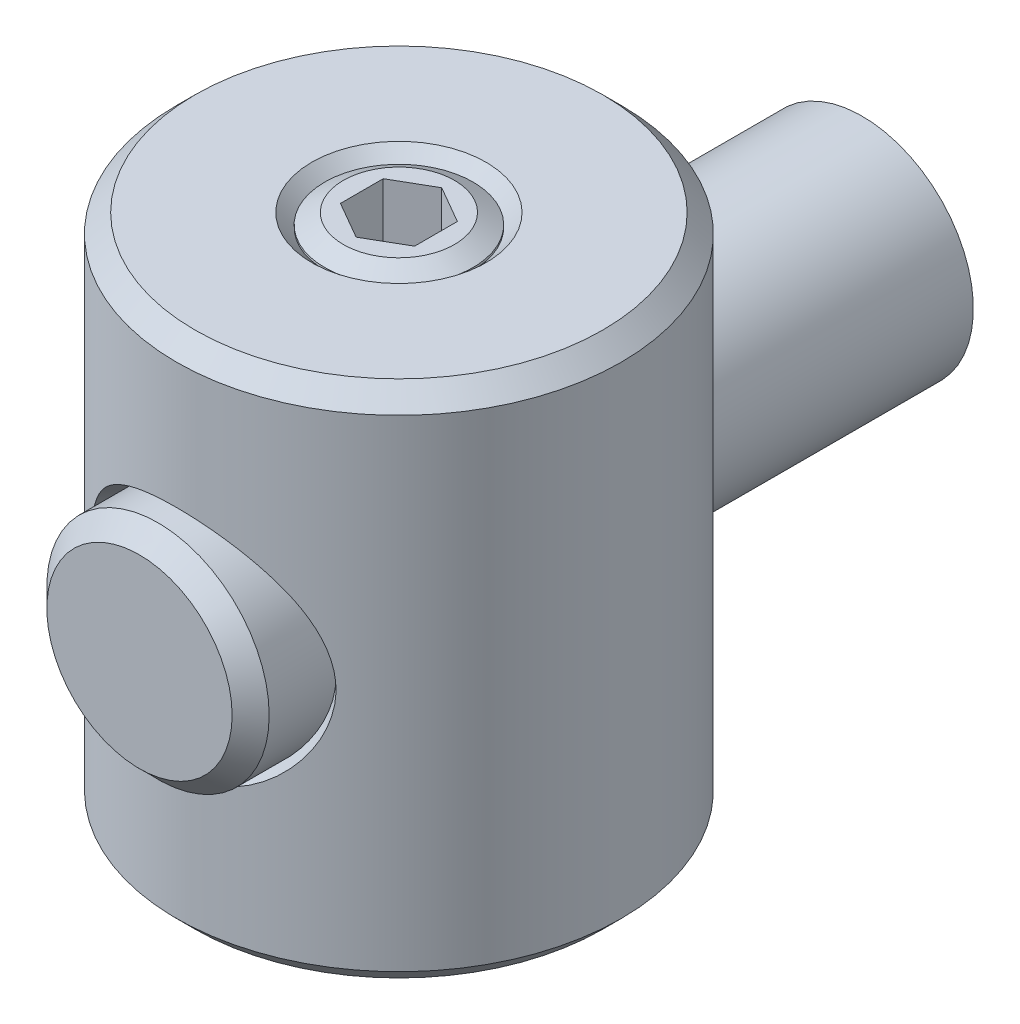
ISO-10303-21;
HEADER;
FILE_DESCRIPTION(('STEP AP214'),'2;1');
FILE_NAME('part.step','',(''),(''),'','','');
FILE_SCHEMA(('AUTOMOTIVE_DESIGN { 1 0 10303 214 1 1 1 1 }'));
ENDSEC;
DATA;
#1=APPLICATION_CONTEXT('core data for automotive mechanical design processes');
#2=APPLICATION_PROTOCOL_DEFINITION('international standard','automotive_design',2000,#1);
#3=PRODUCT_CONTEXT('',#1,'mechanical');
#4=PRODUCT('Part','Part','',(#3));
#5=PRODUCT_RELATED_PRODUCT_CATEGORY('part','',(#4));
#6=PRODUCT_DEFINITION_FORMATION('','',#4);
#7=PRODUCT_DEFINITION_CONTEXT('part definition',#1,'design');
#8=PRODUCT_DEFINITION('design','',#6,#7);
#9=PRODUCT_DEFINITION_SHAPE('','',#8);
#10=(LENGTH_UNIT() NAMED_UNIT(*) SI_UNIT(.MILLI.,.METRE.));
#11=(NAMED_UNIT(*) PLANE_ANGLE_UNIT() SI_UNIT($,.RADIAN.));
#12=(NAMED_UNIT(*) SI_UNIT($,.STERADIAN.) SOLID_ANGLE_UNIT());
#13=UNCERTAINTY_MEASURE_WITH_UNIT(LENGTH_MEASURE(1.E-05),#10,'distance_accuracy_value','');
#14=(GEOMETRIC_REPRESENTATION_CONTEXT(3) GLOBAL_UNCERTAINTY_ASSIGNED_CONTEXT((#13)) GLOBAL_UNIT_ASSIGNED_CONTEXT((#10,
#11,#12)) REPRESENTATION_CONTEXT('',''));
#15=CARTESIAN_POINT('',(0.,0.,0.));
#16=DIRECTION('',(0.,0.,1.));
#17=DIRECTION('',(1.,0.,0.));
#18=AXIS2_PLACEMENT_3D('',#15,#16,#17);
#19=CARTESIAN_POINT('',(0.,7.,0.));
#20=DIRECTION('',(0.,1.,0.));
#21=DIRECTION('',(-1.,0.,0.));
#22=AXIS2_PLACEMENT_3D('',#19,#20,#21);
#23=CONICAL_SURFACE('',#22,2.35,0.785398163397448);
#24=CARTESIAN_POINT('',(0.,7.,0.));
#25=DIRECTION('',(0.,1.,0.));
#26=DIRECTION('',(-1.,0.,0.));
#27=AXIS2_PLACEMENT_3D('',#24,#25,#26);
#28=CIRCLE('',#27,2.35);
#29=CARTESIAN_POINT('',(-2.35,7.,0.));
#30=VERTEX_POINT('',#29);
#31=EDGE_CURVE('E214',#30,#30,#28,.T.);
#32=ORIENTED_EDGE('',*,*,#31,.T.);
#33=EDGE_LOOP('',(#32));
#34=FACE_BOUND('',#33,.T.);
#35=CARTESIAN_POINT('',(0.,6.65,0.));
#36=DIRECTION('',(0.,1.,0.));
#37=DIRECTION('',(-1.,0.,0.));
#38=AXIS2_PLACEMENT_3D('',#35,#36,#37);
#39=CIRCLE('',#38,2.);
#40=CARTESIAN_POINT('',(-2.,6.65,0.));
#41=VERTEX_POINT('',#40);
#42=EDGE_CURVE('E547',#41,#41,#39,.F.);
#43=ORIENTED_EDGE('',*,*,#42,.T.);
#44=EDGE_LOOP('',(#43));
#45=FACE_BOUND('',#44,.T.);
#46=ADVANCED_FACE('F15',(#34,#45),#23,.F.);
#47=CARTESIAN_POINT('',(0.,7.,0.));
#48=DIRECTION('',(0.,1.,0.));
#49=DIRECTION('',(-1.,0.,0.));
#50=AXIS2_PLACEMENT_3D('',#47,#48,#49);
#51=PLANE('',#50);
#52=ORIENTED_EDGE('',*,*,#31,.F.);
#53=EDGE_LOOP('',(#52));
#54=FACE_BOUND('',#53,.T.);
#55=CARTESIAN_POINT('',(0.,7.,0.));
#56=DIRECTION('',(0.,1.,0.));
#57=DIRECTION('',(-1.,0.,0.));
#58=AXIS2_PLACEMENT_3D('',#55,#56,#57);
#59=CIRCLE('',#58,5.5);
#60=CARTESIAN_POINT('',(-5.5,7.,0.));
#61=VERTEX_POINT('',#60);
#62=EDGE_CURVE('E277',#61,#61,#59,.T.);
#63=ORIENTED_EDGE('',*,*,#62,.T.);
#64=EDGE_LOOP('',(#63));
#65=FACE_BOUND('',#64,.T.);
#66=ADVANCED_FACE('F250',(#54,#65),#51,.T.);
#67=CARTESIAN_POINT('',(0.,6.5,0.));
#68=DIRECTION('',(0.,-1.,0.));
#69=DIRECTION('',(1.,0.,0.));
#70=AXIS2_PLACEMENT_3D('',#67,#68,#69);
#71=CONICAL_SURFACE('',#70,6.,0.785398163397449);
#72=ORIENTED_EDGE('',*,*,#62,.F.);
#73=EDGE_LOOP('',(#72));
#74=FACE_BOUND('',#73,.T.);
#75=CARTESIAN_POINT('',(0.,6.5,0.));
#76=DIRECTION('',(0.,1.,0.));
#77=DIRECTION('',(-1.,0.,0.));
#78=AXIS2_PLACEMENT_3D('',#75,#76,#77);
#79=CIRCLE('',#78,6.);
#80=CARTESIAN_POINT('',(-6.,6.5,0.));
#81=VERTEX_POINT('',#80);
#82=EDGE_CURVE('E284',#81,#81,#79,.F.);
#83=ORIENTED_EDGE('',*,*,#82,.F.);
#84=EDGE_LOOP('',(#83));
#85=FACE_BOUND('',#84,.T.);
#86=ADVANCED_FACE('F248',(#74,#85),#71,.T.);
#87=CARTESIAN_POINT('',(0.,-7.,0.));
#88=DIRECTION('',(0.,-1.,0.));
#89=DIRECTION('',(1.,0.,0.));
#90=AXIS2_PLACEMENT_3D('',#87,#88,#89);
#91=CYLINDRICAL_SURFACE('',#90,6.);
#92=CARTESIAN_POINT('',(-3.30893795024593,0.,-5.00509037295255));
#93=CARTESIAN_POINT('',(-3.30891466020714,0.026099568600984,-5.00510419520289));
#94=CARTESIAN_POINT('',(-3.3085327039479,0.0521983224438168,-5.005372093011));
#95=CARTESIAN_POINT('',(-3.30705738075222,0.104297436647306,-5.00640163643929));
#96=CARTESIAN_POINT('',(-3.30596588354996,0.130297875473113,-5.00716198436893));
#97=CARTESIAN_POINT('',(-3.30308012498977,0.182188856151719,-5.00916023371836));
#98=CARTESIAN_POINT('',(-3.30128727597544,0.208079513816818,-5.01039717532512));
#99=CARTESIAN_POINT('',(-3.29700792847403,0.259739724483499,-5.01333206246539));
#100=CARTESIAN_POINT('',(-3.294522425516,0.285509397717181,-5.01502934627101));
#101=CARTESIAN_POINT('',(-3.28886669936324,0.336916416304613,-5.01886851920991));
#102=CARTESIAN_POINT('',(-3.2856970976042,0.362553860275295,-5.02101000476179));
#103=CARTESIAN_POINT('',(-3.27868212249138,0.413685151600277,-5.02572117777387));
#104=CARTESIAN_POINT('',(-3.27483703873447,0.439179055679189,-5.028290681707));
#105=CARTESIAN_POINT('',(-3.26647989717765,0.490012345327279,-5.03384159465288));
#106=CARTESIAN_POINT('',(-3.26196783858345,0.515351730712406,-5.03682300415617));
#107=CARTESIAN_POINT('',(-3.25228587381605,0.565863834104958,-5.04318123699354));
#108=CARTESIAN_POINT('',(-3.24711571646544,0.591036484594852,-5.04655821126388));
#109=CARTESIAN_POINT('',(-3.23062369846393,0.666322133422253,-5.0572629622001));
#110=CARTESIAN_POINT('',(-3.21832966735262,0.716145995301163,-5.06515829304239));
#111=CARTESIAN_POINT('',(-3.1912176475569,0.814991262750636,-5.08233420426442));
#112=CARTESIAN_POINT('',(-3.17639341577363,0.8640103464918,-5.09161820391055));
#113=CARTESIAN_POINT('',(-3.14429083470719,0.961162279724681,-5.11144192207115));
#114=CARTESIAN_POINT('',(-3.12700464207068,1.0092917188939,-5.12198563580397));
#115=CARTESIAN_POINT('',(-3.09004807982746,1.10457458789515,-5.14419921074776));
#116=CARTESIAN_POINT('',(-3.07036906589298,1.15172371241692,-5.1558731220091));
#117=CARTESIAN_POINT('',(-3.02869575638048,1.24495749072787,-5.18021816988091));
#118=CARTESIAN_POINT('',(-3.00669264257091,1.29103721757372,-5.19289305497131));
#119=CARTESIAN_POINT('',(-2.96043951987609,1.38204301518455,-5.21911141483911));
#120=CARTESIAN_POINT('',(-2.93618099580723,1.42696382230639,-5.2326581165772));
#121=CARTESIAN_POINT('',(-2.88548493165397,1.51556239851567,-5.26049157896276));
#122=CARTESIAN_POINT('',(-2.8590395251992,1.55923484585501,-5.27478093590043));
#123=CARTESIAN_POINT('',(-2.804037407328,1.64524699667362,-5.30397159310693));
#124=CARTESIAN_POINT('',(-2.77547371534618,1.68758157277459,-5.31887483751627));
#125=CARTESIAN_POINT('',(-2.71630195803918,1.77082801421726,-5.3491638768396));
#126=CARTESIAN_POINT('',(-2.68568794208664,1.81173516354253,-5.36455100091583));
#127=CARTESIAN_POINT('',(-2.62248443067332,1.89203657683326,-5.39568313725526));
#128=CARTESIAN_POINT('',(-2.58989009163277,1.93142671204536,-5.4114289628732));
#129=CARTESIAN_POINT('',(-2.52278690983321,2.00860366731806,-5.44313579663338));
#130=CARTESIAN_POINT('',(-2.48827432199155,2.04638707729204,-5.45909717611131));
#131=CARTESIAN_POINT('',(-2.41742501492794,2.12026029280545,-5.4911594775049));
#132=CARTESIAN_POINT('',(-2.38108565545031,2.15634749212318,-5.50726057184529));
#133=CARTESIAN_POINT('',(-2.30649450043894,2.22680178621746,-5.53930470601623));
#134=CARTESIAN_POINT('',(-2.26823760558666,2.26116374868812,-5.55524717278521));
#135=CARTESIAN_POINT('',(-2.18977615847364,2.32816767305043,-5.58671651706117));
#136=CARTESIAN_POINT('',(-2.14956405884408,2.36080175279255,-5.60224135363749));
#137=CARTESIAN_POINT('',(-2.06732567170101,2.42428215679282,-5.63283901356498));
#138=CARTESIAN_POINT('',(-2.02529314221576,2.45512131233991,-5.64790992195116));
#139=CARTESIAN_POINT('',(-1.93951833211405,2.51494319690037,-5.6774954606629));
#140=CARTESIAN_POINT('',(-1.89577094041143,2.54391956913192,-5.69200812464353));
#141=CARTESIAN_POINT('',(-1.80667873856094,2.59994731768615,-5.72039107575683));
#142=CARTESIAN_POINT('',(-1.76132988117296,2.62699320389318,-5.73425949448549));
#143=CARTESIAN_POINT('',(-1.66914506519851,2.67909129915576,-5.76126284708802));
#144=CARTESIAN_POINT('',(-1.62230599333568,2.7041388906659,-5.77439606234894));
#145=CARTESIAN_POINT('',(-1.52725175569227,2.75217172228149,-5.79983915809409));
#146=CARTESIAN_POINT('',(-1.47903426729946,2.77515317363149,-5.81214751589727));
#147=CARTESIAN_POINT('',(-1.38133419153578,2.81898508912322,-5.83585064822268));
#148=CARTESIAN_POINT('',(-1.3318499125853,2.83983249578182,-5.8472441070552));
#149=CARTESIAN_POINT('',(-1.2317274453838,2.8793277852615,-5.86902728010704));
#150=CARTESIAN_POINT('',(-1.18108802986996,2.89797318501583,-5.8794158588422));
#151=CARTESIAN_POINT('',(-1.07876662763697,2.93299607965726,-5.89909911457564));
#152=CARTESIAN_POINT('',(-1.02708371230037,2.94937144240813,-5.90839276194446));
#153=CARTESIAN_POINT('',(-0.922786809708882,2.9797861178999,-5.92579609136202));
#154=CARTESIAN_POINT('',(-0.870172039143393,2.99382335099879,-5.93390471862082));
#155=CARTESIAN_POINT('',(-0.764123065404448,3.01949389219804,-5.94884806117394));
#156=CARTESIAN_POINT('',(-0.710688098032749,3.03112479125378,-5.95568149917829));
#157=CARTESIAN_POINT('',(-0.603110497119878,3.05191530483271,-5.96798480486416));
#158=CARTESIAN_POINT('',(-0.548967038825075,3.0610717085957,-5.97345290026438));
#159=CARTESIAN_POINT('',(-0.4400842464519,3.07684588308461,-5.98293585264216));
#160=CARTESIAN_POINT('',(-0.385344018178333,3.08345907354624,-5.98694808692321));
#161=CARTESIAN_POINT('',(-0.275379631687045,3.09408181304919,-5.99343112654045));
#162=CARTESIAN_POINT('',(-0.220154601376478,3.09808475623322,-5.99589802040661));
#163=CARTESIAN_POINT('',(-0.109331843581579,3.10341606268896,-5.99919849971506));
#164=CARTESIAN_POINT('',(-0.0537334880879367,3.10473503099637,-6.00002634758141));
#165=CARTESIAN_POINT('',(0.0574361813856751,3.10465316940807,-5.99997308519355));
#166=CARTESIAN_POINT('',(0.113007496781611,3.10325349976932,-5.9990927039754));
#167=CARTESIAN_POINT('',(0.223728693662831,3.09779543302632,-5.99570879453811));
#168=CARTESIAN_POINT('',(0.278879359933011,3.09374848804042,-5.99321225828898));
#169=CARTESIAN_POINT('',(0.388654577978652,3.08305943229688,-5.98668333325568));
#170=CARTESIAN_POINT('',(0.443280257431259,3.07642580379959,-5.98265596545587));
#171=CARTESIAN_POINT('',(0.55190084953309,3.0606327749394,-5.97315623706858));
#172=CARTESIAN_POINT('',(0.605896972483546,3.05147955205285,-5.967687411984));
#173=CARTESIAN_POINT('',(0.713154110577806,3.03071428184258,-5.95539403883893));
#174=CARTESIAN_POINT('',(0.766416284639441,3.01910673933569,-5.94857197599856));
#175=CARTESIAN_POINT('',(0.872101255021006,2.99349962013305,-5.93366127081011));
#176=CARTESIAN_POINT('',(0.924525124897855,2.97950342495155,-5.92557442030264));
#177=CARTESIAN_POINT('',(1.02842922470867,2.94918512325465,-5.90822286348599));
#178=CARTESIAN_POINT('',(1.07991048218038,2.9328657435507,-5.89895953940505));
#179=CARTESIAN_POINT('',(1.18182502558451,2.89796677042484,-5.87934351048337));
#180=CARTESIAN_POINT('',(1.2322593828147,2.87938963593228,-5.86899199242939));
#181=CARTESIAN_POINT('',(1.33197568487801,2.84004046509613,-5.84728785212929));
#182=CARTESIAN_POINT('',(1.38125886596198,2.8192709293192,-5.83593637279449));
#183=CARTESIAN_POINT('',(1.47856822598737,2.77560197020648,-5.81232042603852));
#184=CARTESIAN_POINT('',(1.52659594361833,2.7527053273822,-5.80005715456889));
#185=CARTESIAN_POINT('',(1.62128967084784,2.70484693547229,-5.77470574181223));
#186=CARTESIAN_POINT('',(1.66795766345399,2.67988842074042,-5.76161889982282));
#187=CARTESIAN_POINT('',(1.7598269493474,2.62797090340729,-5.73470809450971));
#188=CARTESIAN_POINT('',(1.80503080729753,2.60101570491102,-5.72088554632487));
#189=CARTESIAN_POINT('',(1.89386717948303,2.5451693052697,-5.69259229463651));
#190=CARTESIAN_POINT('',(1.93750296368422,2.51628254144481,-5.67812310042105));
#191=CARTESIAN_POINT('',(2.0230965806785,2.45663751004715,-5.64862099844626));
#192=CARTESIAN_POINT('',(2.06505849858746,2.42588432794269,-5.63358966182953));
#193=CARTESIAN_POINT('',(2.14720447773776,2.36257066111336,-5.60306467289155));
#194=CARTESIAN_POINT('',(2.18739349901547,2.33001588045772,-5.58757254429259));
#195=CARTESIAN_POINT('',(2.2658683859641,2.26316429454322,-5.55616459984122));
#196=CARTESIAN_POINT('',(2.30416021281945,2.22887373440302,-5.5402503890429));
#197=CARTESIAN_POINT('',(2.37886058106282,2.15856384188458,-5.50824837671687));
#198=CARTESIAN_POINT('',(2.41527329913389,2.12254871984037,-5.4921610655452));
#199=CARTESIAN_POINT('',(2.48627729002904,2.04882374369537,-5.46010570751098));
#200=CARTESIAN_POINT('',(2.52087107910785,2.01111637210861,-5.44413752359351));
#201=CARTESIAN_POINT('',(2.58814490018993,1.93409149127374,-5.41240337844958));
#202=CARTESIAN_POINT('',(2.62082853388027,1.89477726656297,-5.39663708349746));
#203=CARTESIAN_POINT('',(2.68421518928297,1.81462188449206,-5.36545198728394));
#204=CARTESIAN_POINT('',(2.71492287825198,1.77378471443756,-5.35003242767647));
#205=CARTESIAN_POINT('',(2.77428393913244,1.6906671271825,-5.31966957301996));
#206=CARTESIAN_POINT('',(2.80294302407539,1.64839125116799,-5.30472502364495));
#207=CARTESIAN_POINT('',(2.85813502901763,1.56247998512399,-5.27544550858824));
#208=CARTESIAN_POINT('',(2.88467460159,1.51884949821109,-5.26110870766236));
#209=CARTESIAN_POINT('',(2.93555535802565,1.43031292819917,-5.23317688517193));
#210=CARTESIAN_POINT('',(2.95990395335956,1.38541187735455,-5.21957942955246));
#211=CARTESIAN_POINT('',(3.0063308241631,1.2944184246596,-5.19325883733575));
#212=CARTESIAN_POINT('',(3.02841698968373,1.2483309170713,-5.18053271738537));
#213=CARTESIAN_POINT('',(3.07024741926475,1.15504865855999,-5.15608712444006));
#214=CARTESIAN_POINT('',(3.0899996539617,1.10785837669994,-5.14436426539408));
#215=CARTESIAN_POINT('',(3.12709071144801,1.01245644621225,-5.12205760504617));
#216=CARTESIAN_POINT('',(3.14443704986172,0.964248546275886,-5.11147028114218));
#217=CARTESIAN_POINT('',(3.1766466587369,0.866892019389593,-5.09156595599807));
#218=CARTESIAN_POINT('',(3.19151629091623,0.81774617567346,-5.08224571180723));
#219=CARTESIAN_POINT('',(3.21191167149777,0.743366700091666,-5.06931312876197));
#220=CARTESIAN_POINT('',(3.21838830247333,0.718480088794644,-5.06517928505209));
#221=CARTESIAN_POINT('',(3.23069530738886,0.668504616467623,-5.05727808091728));
#222=CARTESIAN_POINT('',(3.23652605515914,0.643415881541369,-5.0535105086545));
#223=CARTESIAN_POINT('',(3.24753224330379,0.593047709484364,-5.04635843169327));
#224=CARTESIAN_POINT('',(3.25270784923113,0.567768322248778,-5.04297383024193));
#225=CARTESIAN_POINT('',(3.2623951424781,0.517029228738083,-5.03660400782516));
#226=CARTESIAN_POINT('',(3.26690674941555,0.491569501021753,-5.03361883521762));
#227=CARTESIAN_POINT('',(3.27525736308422,0.440480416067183,-5.02806421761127));
#228=CARTESIAN_POINT('',(3.27909600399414,0.414850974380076,-5.02549499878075));
#229=CARTESIAN_POINT('',(3.28609207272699,0.363433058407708,-5.02078858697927));
#230=CARTESIAN_POINT('',(3.289248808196,0.337644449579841,-5.01865183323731));
#231=CARTESIAN_POINT('',(3.29487248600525,0.285918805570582,-5.01482661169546));
#232=CARTESIAN_POINT('',(3.29733836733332,0.259981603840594,-5.01313883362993));
#233=CARTESIAN_POINT('',(3.30157180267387,0.20796935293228,-5.0102278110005));
#234=CARTESIAN_POINT('',(3.30333788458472,0.181894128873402,-5.0090055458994));
#235=CARTESIAN_POINT('',(3.30616322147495,0.129616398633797,-5.00704165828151));
#236=CARTESIAN_POINT('',(3.30722055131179,0.103413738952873,-5.0063013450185));
#237=CARTESIAN_POINT('',(3.30861995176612,0.0508916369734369,-5.00531780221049));
#238=CARTESIAN_POINT('',(3.30895960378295,0.0245720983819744,-5.00507625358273));
#239=CARTESIAN_POINT('',(3.30891524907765,-0.0280660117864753,-5.00510518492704));
#240=CARTESIAN_POINT('',(3.30853124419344,-0.0543845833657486,-5.00537566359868));
#241=CARTESIAN_POINT('',(3.30704329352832,-0.106902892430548,-5.00641478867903));
#242=CARTESIAN_POINT('',(3.30594177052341,-0.133102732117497,-5.00718175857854));
#243=CARTESIAN_POINT('',(3.30302838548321,-0.185373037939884,-5.00919732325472));
#244=CARTESIAN_POINT('',(3.30121845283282,-0.211443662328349,-5.01044460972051));
#245=CARTESIAN_POINT('',(3.29689778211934,-0.263445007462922,-5.01340393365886));
#246=CARTESIAN_POINT('',(3.29438852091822,-0.289375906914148,-5.01511499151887));
#247=CARTESIAN_POINT('',(3.28867869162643,-0.341087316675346,-5.01898512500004));
#248=CARTESIAN_POINT('',(3.28547919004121,-0.36686799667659,-5.0211435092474));
#249=CARTESIAN_POINT('',(3.27839833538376,-0.41826850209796,-5.02589157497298));
#250=CARTESIAN_POINT('',(3.27451768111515,-0.443888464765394,-5.02848081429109));
#251=CARTESIAN_POINT('',(3.26608392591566,-0.494957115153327,-5.03407392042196));
#252=CARTESIAN_POINT('',(3.26153119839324,-0.52040588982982,-5.03707755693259));
#253=CARTESIAN_POINT('',(3.25176268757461,-0.571121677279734,-5.04348280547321));
#254=CARTESIAN_POINT('',(3.24654699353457,-0.596388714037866,-5.04688436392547));
#255=CARTESIAN_POINT('',(3.23546179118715,-0.646730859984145,-5.05406890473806));
#256=CARTESIAN_POINT('',(3.22959212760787,-0.671805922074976,-5.057851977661));
#257=CARTESIAN_POINT('',(3.21720859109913,-0.721752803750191,-5.0657827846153));
#258=CARTESIAN_POINT('',(3.2106943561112,-0.746624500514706,-5.06993072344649));
#259=CARTESIAN_POINT('',(3.19018848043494,-0.820956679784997,-5.08290345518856));
#260=CARTESIAN_POINT('',(3.17524804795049,-0.870069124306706,-5.09224778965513));
#261=CARTESIAN_POINT('',(3.14290365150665,-0.96735475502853,-5.11219534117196));
#262=CARTESIAN_POINT('',(3.12549345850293,-1.0155252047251,-5.1228017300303));
#263=CARTESIAN_POINT('',(3.08828259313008,-1.11084871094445,-5.14514197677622));
#264=CARTESIAN_POINT('',(3.0684745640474,-1.15799808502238,-5.15687928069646));
#265=CARTESIAN_POINT('',(3.02654153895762,-1.2511955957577,-5.18134962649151));
#266=CARTESIAN_POINT('',(3.00440875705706,-1.29723935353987,-5.19408597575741));
#267=CARTESIAN_POINT('',(2.95789874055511,-1.38814295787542,-5.22042329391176));
#268=CARTESIAN_POINT('',(2.93351382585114,-1.43299802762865,-5.23402716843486));
#269=CARTESIAN_POINT('',(2.88257160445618,-1.52144086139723,-5.26196849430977));
#270=CARTESIAN_POINT('',(2.85600712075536,-1.56502374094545,-5.27630830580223));
#271=CARTESIAN_POINT('',(2.80077758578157,-1.65083861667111,-5.30559091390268));
#272=CARTESIAN_POINT('',(2.77210614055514,-1.69306589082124,-5.32053547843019));
#273=CARTESIAN_POINT('',(2.71273365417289,-1.7760855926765,-5.35089579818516));
#274=CARTESIAN_POINT('',(2.6820271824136,-1.81687369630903,-5.3663127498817));
#275=CARTESIAN_POINT('',(2.61865769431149,-1.89693113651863,-5.39749057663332));
#276=CARTESIAN_POINT('',(2.58599031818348,-1.93619674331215,-5.41325216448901));
#277=CARTESIAN_POINT('',(2.51876355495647,-2.01312401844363,-5.44497478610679));
#278=CARTESIAN_POINT('',(2.4842008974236,-2.05078270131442,-5.46093612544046));
#279=CARTESIAN_POINT('',(2.41327960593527,-2.12441471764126,-5.49297772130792));
#280=CARTESIAN_POINT('',(2.37691881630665,-2.1603859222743,-5.50905809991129));
#281=CARTESIAN_POINT('',(2.30230338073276,-2.23061836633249,-5.54105011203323));
#282=CARTESIAN_POINT('',(2.26404385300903,-2.26487468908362,-5.55696116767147));
#283=CARTESIAN_POINT('',(2.185582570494,-2.33167282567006,-5.58836921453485));
#284=CARTESIAN_POINT('',(2.14537317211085,-2.36420663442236,-5.60386413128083));
#285=CARTESIAN_POINT('',(2.06314657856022,-2.42749397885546,-5.63440089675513));
#286=CARTESIAN_POINT('',(2.02112308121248,-2.45824026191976,-5.64944079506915));
#287=CARTESIAN_POINT('',(1.93537165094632,-2.51788215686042,-5.67896381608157));
#288=CARTESIAN_POINT('',(1.89163856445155,-2.5467713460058,-5.69344494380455));
#289=CARTESIAN_POINT('',(1.80257977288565,-2.60262976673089,-5.72176403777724));
#290=CARTESIAN_POINT('',(1.75724999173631,-2.62959345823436,-5.73560011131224));
#291=CARTESIAN_POINT('',(1.66510746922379,-2.681531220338,-5.76253792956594));
#292=CARTESIAN_POINT('',(1.61829159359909,-2.706500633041,-5.77563793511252));
#293=CARTESIAN_POINT('',(1.52328727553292,-2.75438025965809,-5.801013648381));
#294=CARTESIAN_POINT('',(1.47509649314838,-2.77728664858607,-5.81328781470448));
#295=CARTESIAN_POINT('',(1.37745273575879,-2.820970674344,-5.83692150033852));
#296=CARTESIAN_POINT('',(1.32799805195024,-2.84174521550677,-5.84827968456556));
#297=CARTESIAN_POINT('',(1.22793706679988,-2.88109610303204,-5.8699911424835));
#298=CARTESIAN_POINT('',(1.17732951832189,-2.89966991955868,-5.88034325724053));
#299=CARTESIAN_POINT('',(1.07507352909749,-2.93455007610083,-5.89995232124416));
#300=CARTESIAN_POINT('',(1.02342413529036,-2.95085422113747,-5.90920820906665));
#301=CARTESIAN_POINT('',(0.919195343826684,-2.98112599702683,-5.92653466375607));
#302=CARTESIAN_POINT('',(0.866615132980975,-2.99509146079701,-5.93460413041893));
#303=CARTESIAN_POINT('',(0.76063573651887,-3.02061711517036,-5.94946770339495));
#304=CARTESIAN_POINT('',(0.707235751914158,-3.03217477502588,-5.95626046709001));
#305=CARTESIAN_POINT('',(0.599727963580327,-3.05281658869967,-5.96848091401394));
#306=CARTESIAN_POINT('',(0.545619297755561,-3.06189736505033,-5.97390673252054));
#307=CARTESIAN_POINT('',(0.436805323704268,-3.07751719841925,-5.9833034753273));
#308=CARTESIAN_POINT('',(0.382099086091,-3.08405145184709,-5.98727164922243));
#309=CARTESIAN_POINT('',(0.27220129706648,-3.09451238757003,-5.99366511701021));
#310=CARTESIAN_POINT('',(0.217008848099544,-3.0984321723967,-5.99608632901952));
#311=CARTESIAN_POINT('',(0.106249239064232,-3.10359236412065,-5.99929292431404));
#312=CARTESIAN_POINT('',(0.050681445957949,-3.10482300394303,-6.00007234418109));
#313=CARTESIAN_POINT('',(-0.0604286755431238,-3.10455944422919,-5.99992370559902));
#314=CARTESIAN_POINT('',(-0.115971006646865,-3.10306603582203,-5.99899614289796));
#315=CARTESIAN_POINT('',(-0.226635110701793,-3.09741819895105,-5.99552334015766));
#316=CARTESIAN_POINT('',(-0.28175767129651,-3.09327490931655,-5.99298487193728));
#317=CARTESIAN_POINT('',(-0.391477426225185,-3.08239311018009,-5.98637645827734));
#318=CARTESIAN_POINT('',(-0.446075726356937,-3.07566278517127,-5.98231134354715));
#319=CARTESIAN_POINT('',(-0.554642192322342,-3.05967856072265,-5.97274068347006));
#320=CARTESIAN_POINT('',(-0.608611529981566,-3.05043057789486,-5.9672385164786));
#321=CARTESIAN_POINT('',(-0.715815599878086,-3.0294802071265,-5.95488285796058));
#322=CARTESIAN_POINT('',(-0.769051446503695,-3.01778211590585,-5.94803173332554));
#323=CARTESIAN_POINT('',(-0.874684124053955,-2.99200052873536,-5.93306722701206));
#324=CARTESIAN_POINT('',(-0.927081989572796,-2.97792027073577,-5.92495555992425));
#325=CARTESIAN_POINT('',(-1.03093428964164,-2.94744267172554,-5.90755859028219));
#326=CARTESIAN_POINT('',(-1.08238973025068,-2.9310479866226,-5.89827463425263));
#327=CARTESIAN_POINT('',(-1.18425268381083,-2.89600942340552,-5.87862146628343));
#328=CARTESIAN_POINT('',(-1.23466127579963,-2.87736801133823,-5.86825344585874));
#329=CARTESIAN_POINT('',(-1.33432591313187,-2.8379034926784,-5.84652033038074));
#330=CARTESIAN_POINT('',(-1.38358324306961,-2.81708297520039,-5.83515642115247));
#331=CARTESIAN_POINT('',(-1.48084058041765,-2.77332744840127,-5.81151955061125));
#332=CARTESIAN_POINT('',(-1.52884222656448,-2.75039539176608,-5.79924786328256));
#333=CARTESIAN_POINT('',(-1.62348327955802,-2.7024837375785,-5.77388346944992));
#334=CARTESIAN_POINT('',(-1.67012483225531,-2.67750763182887,-5.76079217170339));
#335=CARTESIAN_POINT('',(-1.76194053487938,-2.6255747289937,-5.73387620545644));
#336=CARTESIAN_POINT('',(-1.80711748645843,-2.5986220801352,-5.72005308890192));
#337=CARTESIAN_POINT('',(-1.89589897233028,-2.54280257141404,-5.6917624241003));
#338=CARTESIAN_POINT('',(-1.93950710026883,-2.51394058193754,-5.67729654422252));
#339=CARTESIAN_POINT('',(-2.02504464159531,-2.45436975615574,-5.64780451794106));
#340=CARTESIAN_POINT('',(-2.06697856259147,-2.42366652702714,-5.6327801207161));
#341=CARTESIAN_POINT('',(-2.14906550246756,-2.36047704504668,-5.60227312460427));
#342=CARTESIAN_POINT('',(-2.18922402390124,-2.32799711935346,-5.58679223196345));
#343=CARTESIAN_POINT('',(-2.26764215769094,-2.26133117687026,-5.55540809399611));
#344=CARTESIAN_POINT('',(-2.30590838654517,-2.22715208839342,-5.53950667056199));
#345=CARTESIAN_POINT('',(-2.38055378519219,-2.15704904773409,-5.50753275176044));
#346=CARTESIAN_POINT('',(-2.41693703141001,-2.12112922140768,-5.49146072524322));
#347=CARTESIAN_POINT('',(-2.48787241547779,-2.04753774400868,-5.45943965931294));
#348=CARTESIAN_POINT('',(-2.5224260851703,-2.00986760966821,-5.44349052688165));
#349=CARTESIAN_POINT('',(-2.58961859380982,-1.93287950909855,-5.41179502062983));
#350=CARTESIAN_POINT('',(-2.6222601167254,-1.89356399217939,-5.39604838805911));
#351=CARTESIAN_POINT('',(-2.68556020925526,-1.81337604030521,-5.36490347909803));
#352=CARTESIAN_POINT('',(-2.71622266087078,-1.77250691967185,-5.34950456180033));
#353=CARTESIAN_POINT('',(-2.77549221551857,-1.689306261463,-5.3191832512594));
#354=CARTESIAN_POINT('',(-2.80410441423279,-1.64697876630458,-5.30425973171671));
#355=CARTESIAN_POINT('',(-2.85920218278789,-1.56095504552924,-5.27502221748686));
#356=CARTESIAN_POINT('',(-2.88569400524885,-1.51726341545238,-5.26070649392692));
#357=CARTESIAN_POINT('',(-2.93647949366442,-1.42860554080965,-5.23281642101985));
#358=CARTESIAN_POINT('',(-2.96078044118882,-1.38364422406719,-5.21923968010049));
#359=CARTESIAN_POINT('',(-3.00711286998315,-1.29254120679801,-5.19295980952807));
#360=CARTESIAN_POINT('',(-3.02915244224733,-1.24640450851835,-5.18025362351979));
#361=CARTESIAN_POINT('',(-3.07089099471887,-1.15304534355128,-5.15584701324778));
#362=CARTESIAN_POINT('',(-3.09059854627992,-1.10582766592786,-5.14414295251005));
#363=CARTESIAN_POINT('',(-3.12760235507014,-1.0104010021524,-5.12187261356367));
#364=CARTESIAN_POINT('',(-3.14490720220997,-0.962196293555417,-5.11130231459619));
#365=CARTESIAN_POINT('',(-3.17703508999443,-0.864891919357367,-5.09143148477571));
#366=CARTESIAN_POINT('',(-3.19186612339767,-0.815795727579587,-5.08212688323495));
#367=CARTESIAN_POINT('',(-3.21897757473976,-0.716799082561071,-5.06491835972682));
#368=CARTESIAN_POINT('',(-3.23126459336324,-0.666901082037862,-5.05701082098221));
#369=CARTESIAN_POINT('',(-3.24773469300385,-0.59150589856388,-5.04629555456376));
#370=CARTESIAN_POINT('',(-3.25289534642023,-0.566298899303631,-5.04291657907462));
#371=CARTESIAN_POINT('',(-3.26255399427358,-0.515720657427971,-5.03655742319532));
#372=CARTESIAN_POINT('',(-3.26705232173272,-0.490349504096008,-5.0335770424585));
#373=CARTESIAN_POINT('',(-3.27537743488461,-0.439455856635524,-5.02803157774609));
#374=CARTESIAN_POINT('',(-3.27920431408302,-0.413933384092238,-5.02546643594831));
#375=CARTESIAN_POINT('',(-3.28617805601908,-0.362748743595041,-5.02076768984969));
#376=CARTESIAN_POINT('',(-3.28932473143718,-0.337086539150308,-5.0186342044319));
#377=CARTESIAN_POINT('',(-3.29492952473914,-0.285634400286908,-5.01481504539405));
#378=CARTESIAN_POINT('',(-3.29738713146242,-0.259844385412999,-5.01312970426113));
#379=CARTESIAN_POINT('',(-3.30160535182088,-0.208148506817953,-5.01022302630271));
#380=CARTESIAN_POINT('',(-3.30336508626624,-0.182242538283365,-5.00900227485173));
#381=CARTESIAN_POINT('',(-3.30617902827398,-0.130326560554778,-5.00704103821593));
#382=CARTESIAN_POINT('',(-3.30723194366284,-0.104316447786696,-5.00630143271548));
#383=CARTESIAN_POINT('',(-3.30862426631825,-0.0522042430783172,-5.00531831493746));
#384=CARTESIAN_POINT('',(-3.3089619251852,-0.0261020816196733,-5.00507601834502));
#385=CARTESIAN_POINT('',(-3.30893795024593,0.,-5.00509037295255));
#386=B_SPLINE_CURVE_WITH_KNOTS('',3,(#92,#93,#94,#95,#96,#97,#98,#99,#100,#101,#102,#103,#104,
#105,#106,#107,#108,#109,#110,#111,#112,#113,#114,#115,#116,#117,#118,#119,#120,#121,#122,#123,
#124,#125,#126,#127,#128,#129,#130,#131,#132,#133,#134,#135,#136,#137,#138,#139,#140,#141,#142,
#143,#144,#145,#146,#147,#148,#149,#150,#151,#152,#153,#154,#155,#156,#157,#158,#159,#160,#161,
#162,#163,#164,#165,#166,#167,#168,#169,#170,#171,#172,#173,#174,#175,#176,#177,#178,#179,#180,
#181,#182,#183,#184,#185,#186,#187,#188,#189,#190,#191,#192,#193,#194,#195,#196,#197,#198,#199,
#200,#201,#202,#203,#204,#205,#206,#207,#208,#209,#210,#211,#212,#213,#214,#215,#216,#217,#218,
#219,#220,#221,#222,#223,#224,#225,#226,#227,#228,#229,#230,#231,#232,#233,#234,#235,#236,#237,
#238,#239,#240,#241,#242,#243,#244,#245,#246,#247,#248,#249,#250,#251,#252,#253,#254,#255,#256,
#257,#258,#259,#260,#261,#262,#263,#264,#265,#266,#267,#268,#269,#270,#271,#272,#273,#274,#275,
#276,#277,#278,#279,#280,#281,#282,#283,#284,#285,#286,#287,#288,#289,#290,#291,#292,#293,#294,
#295,#296,#297,#298,#299,#300,#301,#302,#303,#304,#305,#306,#307,#308,#309,#310,#311,#312,#313,
#314,#315,#316,#317,#318,#319,#320,#321,#322,#323,#324,#325,#326,#327,#328,#329,#330,#331,#332,
#333,#334,#335,#336,#337,#338,#339,#340,#341,#342,#343,#344,#345,#346,#347,#348,#349,#350,#351,
#352,#353,#354,#355,#356,#357,#358,#359,#360,#361,#362,#363,#364,#365,#366,#367,#368,#369,#370,
#371,#372,#373,#374,#375,#376,#377,#378,#379,#380,#381,#382,#383,#384,#385),.UNSPECIFIED.,.F.,
.F.,(4,2,2,2,2,2,2,2,2,2,2,2,2,2,2,2,2,2,2,2,2,2,2,2,2,2,2,2,2,2,2,2,2,2,2,2,2,2,2,2,2,2,2,2,2,
2,2,2,2,2,2,2,2,2,2,2,2,2,2,2,2,2,2,2,2,2,2,2,2,2,2,2,2,2,2,2,2,2,2,2,2,2,2,2,2,2,2,2,2,2,2,2,2,
2,2,2,2,2,2,2,2,2,2,2,2,2,2,2,2,2,2,2,2,2,2,2,2,2,2,2,2,2,2,2,2,2,2,2,2,2,2,2,2,2,2,2,2,2,2,2,2,
2,2,2,2,2,4),(0.,0.078294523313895,0.156383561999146,0.234316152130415,0.312137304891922,
0.389888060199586,0.467605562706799,0.545323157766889,0.623070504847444,0.778738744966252,
0.934796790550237,1.09136361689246,1.24851387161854,1.40628340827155,1.56467486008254,
1.7236631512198,1.88320088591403,2.04322359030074,2.20365480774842,2.36441106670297,
2.52540675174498,2.68685599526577,2.84898750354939,3.01172746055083,3.17499613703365,
3.33871201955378,3.50279586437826,3.66717470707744,3.8317858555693,3.99658088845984,
4.16152967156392,4.32662439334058,4.49188360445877,4.65735622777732,4.82312548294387,
4.98931264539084,5.15608053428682,5.32277726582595,5.48875759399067,5.65419815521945,
5.81923665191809,5.98397481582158,6.14848167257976,6.3127970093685,6.47693496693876,
6.64088769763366,6.80462904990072,6.96811825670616,7.13130361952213,7.2941261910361,
7.4565234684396,7.61843311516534,7.7797967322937,7.94078470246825,8.10154376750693,
8.2619892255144,8.42204062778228,8.58162670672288,8.74069040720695,8.89919404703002,
9.05712461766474,9.2144992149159,9.37137055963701,9.52783253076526,9.60596031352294,
9.68404263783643,9.76210519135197,9.8401771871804,9.91829149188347,9.99648473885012,
10.0747974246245,10.1532739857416,10.231962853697,10.3109164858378,10.3898699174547,
10.4685581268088,10.5470335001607,10.625344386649,10.7035351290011,10.7816461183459,
10.8597138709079,10.937771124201,11.0158469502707,11.0939668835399,11.2504084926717,
11.4072519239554,11.5645893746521,11.7224716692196,11.8809137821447,12.0399003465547,
12.1993910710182,12.3593260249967,12.5196307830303,12.6802214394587,12.8410095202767,
13.0022348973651,13.1641534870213,13.3266887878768,13.4897589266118,13.6532807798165,
13.8171740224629,13.9813651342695,14.145791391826,14.3104048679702,14.4751764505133,
14.6400998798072,14.8051957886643,14.9705157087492,15.1361459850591,15.3022115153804,
15.4688792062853,15.6354985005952,15.8014219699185,15.9668247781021,16.1318421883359,
16.2965725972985,16.4610808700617,16.6254018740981,16.7895441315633,16.953493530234,
17.1172170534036,17.2806665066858,17.4437822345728,17.6064968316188,17.7687388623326,
17.9304366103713,18.0915218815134,18.2522424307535,18.4128262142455,18.573178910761,
18.7332068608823,18.8928221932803,19.0519480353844,19.2105238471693,19.3685109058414,
19.5258979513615,19.6827069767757,19.8389991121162,19.9948805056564,20.0727229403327,
20.1505261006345,20.2283184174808,20.3061321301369,20.3840034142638,20.4619724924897,
20.5400837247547,20.6183856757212),.UNSPECIFIED.);
#387=CARTESIAN_POINT('',(-3.30893795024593,0.,-5.00509037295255));
#388=VERTEX_POINT('',#387);
#389=EDGE_CURVE('E271',#388,#388,#386,.F.);
#390=ORIENTED_EDGE('',*,*,#389,.T.);
#391=EDGE_LOOP('',(#390));
#392=FACE_BOUND('',#391,.T.);
#393=CARTESIAN_POINT('',(0.,-3.10469458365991,6.));
#394=CARTESIAN_POINT('',(0.0554927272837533,-3.10469800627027,6.00000054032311));
#395=CARTESIAN_POINT('',(0.11098127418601,-3.10333643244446,5.99914626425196));
#396=CARTESIAN_POINT('',(0.221574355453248,-3.09793791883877,5.99580939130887));
#397=CARTESIAN_POINT('',(0.276679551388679,-3.09391085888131,5.99333280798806));
#398=CARTESIAN_POINT('',(0.386394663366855,-3.08324963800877,5.98684022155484));
#399=CARTESIAN_POINT('',(0.441005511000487,-3.0766224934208,5.98282836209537));
#400=CARTESIAN_POINT('',(0.549624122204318,-3.06083195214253,5.97335588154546));
#401=CARTESIAN_POINT('',(0.603632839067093,-3.05167342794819,5.9678980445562));
#402=CARTESIAN_POINT('',(0.7109387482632,-3.03088934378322,5.95562313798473));
#403=CARTESIAN_POINT('',(0.764236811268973,-3.01926716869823,5.94880793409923));
#404=CARTESIAN_POINT('',(0.870013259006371,-2.99362459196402,5.93390756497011));
#405=CARTESIAN_POINT('',(0.922492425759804,-2.97960665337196,5.92582370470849));
#406=CARTESIAN_POINT('',(1.02652283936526,-2.94924073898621,5.90847490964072));
#407=CARTESIAN_POINT('',(1.07807484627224,-2.93289477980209,5.89921099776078));
#408=CARTESIAN_POINT('',(1.18014261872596,-2.89794056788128,5.87959073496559));
#409=CARTESIAN_POINT('',(1.23065923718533,-2.87933427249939,5.86923533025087));
#410=CARTESIAN_POINT('',(1.33054777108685,-2.83992675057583,5.84752053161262));
#411=CARTESIAN_POINT('',(1.37992077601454,-2.8191277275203,5.83616214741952));
#412=CARTESIAN_POINT('',(1.47741345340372,-2.77540182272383,5.81252968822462));
#413=CARTESIAN_POINT('',(1.52553460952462,-2.75247762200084,5.8002567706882));
#414=CARTESIAN_POINT('',(1.62041481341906,-2.70456819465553,5.77488356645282));
#415=CARTESIAN_POINT('',(1.66717589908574,-2.67958629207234,5.76178462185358));
#416=CARTESIAN_POINT('',(1.7592269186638,-2.62762819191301,5.73484729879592));
#417=CARTESIAN_POINT('',(1.80451959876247,-2.60065606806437,5.72101044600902));
#418=CARTESIAN_POINT('',(1.89352495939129,-2.54478393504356,5.69268658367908));
#419=CARTESIAN_POINT('',(1.93724123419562,-2.51588880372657,5.67820124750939));
#420=CARTESIAN_POINT('',(2.02298345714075,-2.45623781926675,5.64866477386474));
#421=CARTESIAN_POINT('',(2.06501397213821,-2.42548765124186,5.63361541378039));
#422=CARTESIAN_POINT('',(2.14727917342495,-2.36219074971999,5.60305373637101));
#423=CARTESIAN_POINT('',(2.18751947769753,-2.32965047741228,5.58754316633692));
#424=CARTESIAN_POINT('',(2.26608027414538,-2.26284870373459,5.55609355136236));
#425=CARTESIAN_POINT('',(2.30440756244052,-2.22859431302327,5.54015638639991));
#426=CARTESIAN_POINT('',(2.37916620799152,-2.15832345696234,5.50810796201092));
#427=CARTESIAN_POINT('',(2.41560141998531,-2.12231088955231,5.49199714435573));
#428=CARTESIAN_POINT('',(2.48664744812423,-2.04851747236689,5.45989885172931));
#429=CARTESIAN_POINT('',(2.5212592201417,-2.01073756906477,5.44391131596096));
#430=CARTESIAN_POINT('',(2.588570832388,-1.93351439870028,5.41213858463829));
#431=CARTESIAN_POINT('',(2.62127284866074,-1.8940731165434,5.3963531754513));
#432=CARTESIAN_POINT('',(2.68469570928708,-1.81362089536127,5.36513163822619));
#433=CARTESIAN_POINT('',(2.71542000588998,-1.77261290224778,5.34969493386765));
#434=CARTESIAN_POINT('',(2.77481318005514,-1.68912406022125,5.31929975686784));
#435=CARTESIAN_POINT('',(2.80348680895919,-1.64664697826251,5.30434022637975));
#436=CARTESIAN_POINT('',(2.85870570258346,-1.56031608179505,5.27503334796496));
#437=CARTESIAN_POINT('',(2.88525696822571,-1.5164666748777,5.26068433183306));
#438=CARTESIAN_POINT('',(2.93615788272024,-1.42748765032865,5.23273125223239));
#439=CARTESIAN_POINT('',(2.96051466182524,-1.38236285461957,5.21912483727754));
#440=CARTESIAN_POINT('',(3.00695357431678,-1.2909297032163,5.19279014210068));
#441=CARTESIAN_POINT('',(3.02904375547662,-1.24462631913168,5.18005881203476));
#442=CARTESIAN_POINT('',(3.07087661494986,-1.15093303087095,5.15560739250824));
#443=CARTESIAN_POINT('',(3.09062793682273,-1.10354795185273,5.14388362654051));
#444=CARTESIAN_POINT('',(3.12771063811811,-1.00778816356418,5.1215803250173));
#445=CARTESIAN_POINT('',(3.14505080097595,-0.959417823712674,5.11099666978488));
#446=CARTESIAN_POINT('',(3.17723892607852,-0.861786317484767,5.09110655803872));
#447=CARTESIAN_POINT('',(3.19209519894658,-0.812528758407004,5.0817958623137));
#448=CARTESIAN_POINT('',(3.21924499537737,-0.713215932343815,5.06458356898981));
#449=CARTESIAN_POINT('',(3.23154555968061,-0.663163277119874,5.05667810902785));
#450=CARTESIAN_POINT('',(3.24802642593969,-0.587538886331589,5.04597247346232));
#451=CARTESIAN_POINT('',(3.25318876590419,-0.562257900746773,5.04259799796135));
#452=CARTESIAN_POINT('',(3.26284715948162,-0.511534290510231,5.03625028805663));
#453=CARTESIAN_POINT('',(3.26734362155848,-0.486091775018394,5.03327680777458));
#454=CARTESIAN_POINT('',(3.27566117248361,-0.435058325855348,5.02774770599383));
#455=CARTESIAN_POINT('',(3.27948243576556,-0.409467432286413,5.02519197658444));
#456=CARTESIAN_POINT('',(3.28644089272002,-0.358149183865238,5.02051474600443));
#457=CARTESIAN_POINT('',(3.28957798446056,-0.33242180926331,5.01839330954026));
#458=CARTESIAN_POINT('',(3.29515940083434,-0.280842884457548,5.01460102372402));
#459=CARTESIAN_POINT('',(3.29760330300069,-0.254991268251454,5.01293044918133));
#460=CARTESIAN_POINT('',(3.30178951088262,-0.203176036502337,5.01005632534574));
#461=CARTESIAN_POINT('',(3.30353102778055,-0.177212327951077,5.00885330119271));
#462=CARTESIAN_POINT('',(3.30630443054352,-0.125185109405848,5.00693018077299));
#463=CARTESIAN_POINT('',(3.30733511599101,-0.0991215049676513,5.00621090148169));
#464=CARTESIAN_POINT('',(3.30867604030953,-0.0469065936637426,5.00527299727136));
#465=CARTESIAN_POINT('',(3.30898461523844,-0.0207552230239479,5.00505552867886));
#466=CARTESIAN_POINT('',(3.30888130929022,0.0315373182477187,5.00513181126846));
#467=CARTESIAN_POINT('',(3.30846964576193,0.0576784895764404,5.00542540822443));
#468=CARTESIAN_POINT('',(3.30693854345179,0.109853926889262,5.0065049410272));
#469=CARTESIAN_POINT('',(3.30582115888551,0.135888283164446,5.00728944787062));
#470=CARTESIAN_POINT('',(3.30288517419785,0.187839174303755,5.00933575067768));
#471=CARTESIAN_POINT('',(3.30106817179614,0.21375584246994,5.0105964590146));
#472=CARTESIAN_POINT('',(3.29674231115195,0.265460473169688,5.01357828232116));
#473=CARTESIAN_POINT('',(3.2942346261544,0.29124857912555,5.01529861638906));
#474=CARTESIAN_POINT('',(3.2885359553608,0.342685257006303,5.01918335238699));
#475=CARTESIAN_POINT('',(3.28534576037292,0.368333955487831,5.0213472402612));
#476=CARTESIAN_POINT('',(3.27829081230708,0.419480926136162,5.02610263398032));
#477=CARTESIAN_POINT('',(3.27442650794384,0.44497928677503,5.02869385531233));
#478=CARTESIAN_POINT('',(3.26603188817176,0.495815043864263,5.0342876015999));
#479=CARTESIAN_POINT('',(3.26150171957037,0.521152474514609,5.03729003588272));
#480=CARTESIAN_POINT('',(3.25178426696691,0.571654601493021,5.04368968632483));
#481=CARTESIAN_POINT('',(3.2465968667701,0.596819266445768,5.04708697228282));
#482=CARTESIAN_POINT('',(3.23005528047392,0.672065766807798,5.05785076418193));
#483=CARTESIAN_POINT('',(3.21772880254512,0.721857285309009,5.06578444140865));
#484=CARTESIAN_POINT('',(3.19055146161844,0.820618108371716,5.08303451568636));
#485=CARTESIAN_POINT('',(3.17569510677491,0.869585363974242,5.09235391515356));
#486=CARTESIAN_POINT('',(3.14352607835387,0.966616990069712,5.11224563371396));
#487=CARTESIAN_POINT('',(3.12620608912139,1.01467817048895,5.12282166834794));
#488=CARTESIAN_POINT('',(3.08917795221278,1.10981101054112,5.14509683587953));
#489=CARTESIAN_POINT('',(3.0694614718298,1.15687850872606,5.15679985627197));
#490=CARTESIAN_POINT('',(3.02770745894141,1.24993868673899,5.18119984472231));
#491=CARTESIAN_POINT('',(3.00566121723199,1.29592648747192,5.19390049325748));
#492=CARTESIAN_POINT('',(2.95931426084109,1.38674126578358,5.22016689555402));
#493=CARTESIAN_POINT('',(2.93500495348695,1.43156291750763,5.23373587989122));
#494=CARTESIAN_POINT('',(2.8841979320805,1.5199592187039,5.26161024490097));
#495=CARTESIAN_POINT('',(2.8576921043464,1.56352836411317,5.27591827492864));
#496=CARTESIAN_POINT('',(2.80255788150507,1.64933312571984,5.30514243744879));
#497=CARTESIAN_POINT('',(2.77392210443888,1.69156330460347,5.32006059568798));
#498=CARTESIAN_POINT('',(2.71459318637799,1.77460347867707,5.35037554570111));
#499=CARTESIAN_POINT('',(2.68389355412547,1.81540831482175,5.36577375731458));
#500=CARTESIAN_POINT('',(2.62050348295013,1.89551047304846,5.39692378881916));
#501=CARTESIAN_POINT('',(2.58780753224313,1.93480308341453,5.41267650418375));
#502=CARTESIAN_POINT('',(2.52048567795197,2.01179498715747,5.44439362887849));
#503=CARTESIAN_POINT('',(2.48585524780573,2.04949014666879,5.46035846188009));
#504=CARTESIAN_POINT('',(2.41474635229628,2.12319483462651,5.49242077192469));
#505=CARTESIAN_POINT('',(2.37826435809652,2.15920087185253,5.50851844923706));
#506=CARTESIAN_POINT('',(2.30340774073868,2.22950353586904,5.54055192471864));
#507=CARTESIAN_POINT('',(2.26502808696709,2.26379507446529,5.55648714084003));
#508=CARTESIAN_POINT('',(2.18637449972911,2.33066630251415,5.58794124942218));
#509=CARTESIAN_POINT('',(2.14609409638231,2.36323920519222,5.60345838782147));
#510=CARTESIAN_POINT('',(2.06375730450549,2.42659927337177,5.63403662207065));
#511=CARTESIAN_POINT('',(2.0216955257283,2.45738023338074,5.64909605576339));
#512=CARTESIAN_POINT('',(1.93589339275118,2.51708855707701,5.67865561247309));
#513=CARTESIAN_POINT('',(1.89214858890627,2.54601037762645,5.69315401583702));
#514=CARTESIAN_POINT('',(1.8030835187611,2.60193084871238,5.72150526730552));
#515=CARTESIAN_POINT('',(1.7577596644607,2.62892462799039,5.73535645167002));
#516=CARTESIAN_POINT('',(1.66563818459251,2.68091987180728,5.762322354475));
#517=CARTESIAN_POINT('',(1.61883770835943,2.70591710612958,5.77543549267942));
#518=CARTESIAN_POINT('',(1.52386520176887,2.75385002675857,5.80083559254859));
#519=CARTESIAN_POINT('',(1.4756909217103,2.77678204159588,5.81312107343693));
#520=CARTESIAN_POINT('',(1.37807304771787,2.82051540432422,5.83677580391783));
#521=CARTESIAN_POINT('',(1.32862765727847,2.84131350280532,5.8481436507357));
#522=CARTESIAN_POINT('',(1.228569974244,2.88071004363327,5.86987317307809));
#523=CARTESIAN_POINT('',(1.17795618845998,2.89930546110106,5.88023346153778));
#524=CARTESIAN_POINT('',(1.07566426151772,2.93422785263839,5.89985797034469));
#525=CARTESIAN_POINT('',(1.02398478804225,2.950551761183,5.90912070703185));
#526=CARTESIAN_POINT('',(0.919664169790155,2.98086262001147,5.92646034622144));
#527=CARTESIAN_POINT('',(0.867021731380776,2.99484612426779,5.93453549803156));
#528=CARTESIAN_POINT('',(0.760877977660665,3.02040799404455,5.94941036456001));
#529=CARTESIAN_POINT('',(0.707375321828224,3.03198211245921,5.95620782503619));
#530=CARTESIAN_POINT('',(0.59961401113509,3.0526575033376,5.96843801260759));
#531=CARTESIAN_POINT('',(0.545353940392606,3.06175322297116,5.97386767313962));
#532=CARTESIAN_POINT('',(0.436180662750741,3.07740445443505,5.98327307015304));
#533=CARTESIAN_POINT('',(0.381266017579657,3.08395251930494,5.98724454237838));
#534=CARTESIAN_POINT('',(0.270886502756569,3.0944423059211,5.99364558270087));
#535=CARTESIAN_POINT('',(0.215420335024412,3.09837402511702,5.99606923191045));
#536=CARTESIAN_POINT('',(0.104040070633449,3.10356329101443,5.99928407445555));
#537=CARTESIAN_POINT('',(0.0481251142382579,3.1048075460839,6.00006715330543));
#538=CARTESIAN_POINT('',(-0.0636762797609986,3.10456447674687,5.9999227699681));
#539=CARTESIAN_POINT('',(-0.119562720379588,3.10307813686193,5.99899592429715));
#540=CARTESIAN_POINT('',(-0.230833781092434,3.09741909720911,5.99551087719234));
#541=CARTESIAN_POINT('',(-0.286219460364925,3.09326145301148,5.99296181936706));
#542=CARTESIAN_POINT('',(-0.396391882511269,3.08233136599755,5.98632201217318));
#543=CARTESIAN_POINT('',(-0.451180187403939,3.07557048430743,5.98223808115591));
#544=CARTESIAN_POINT('',(-0.560060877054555,3.05950706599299,5.97262065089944));
#545=CARTESIAN_POINT('',(-0.614154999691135,3.05021329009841,5.96709215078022));
#546=CARTESIAN_POINT('',(-0.721550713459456,3.02915589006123,5.95467638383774));
#547=CARTESIAN_POINT('',(-0.774854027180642,3.01739888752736,5.9477927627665));
#548=CARTESIAN_POINT('',(-0.880571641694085,2.99148634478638,5.93275731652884));
#549=CARTESIAN_POINT('',(-0.932987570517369,2.97733587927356,5.9246081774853));
#550=CARTESIAN_POINT('',(-1.03683398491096,2.94670708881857,5.90713182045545));
#551=CARTESIAN_POINT('',(-1.08826600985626,2.93023280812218,5.8978066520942));
#552=CARTESIAN_POINT('',(-1.19004814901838,2.89502656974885,5.87806806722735));
#553=CARTESIAN_POINT('',(-1.24039978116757,2.87629806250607,5.86765631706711));
#554=CARTESIAN_POINT('',(-1.33992457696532,2.83665312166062,5.84583416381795));
#555=CARTESIAN_POINT('',(-1.38909934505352,2.81573990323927,5.8344252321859));
#556=CARTESIAN_POINT('',(-1.48617372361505,2.77179495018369,5.81069811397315));
#557=CARTESIAN_POINT('',(-1.53407515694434,2.74876648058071,5.79838133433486));
#558=CARTESIAN_POINT('',(-1.62850604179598,2.70066013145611,5.77292789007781));
#559=CARTESIAN_POINT('',(-1.67503767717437,2.67558578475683,5.75979264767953));
#560=CARTESIAN_POINT('',(-1.76663193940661,2.62345667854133,5.73279124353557));
#561=CARTESIAN_POINT('',(-1.81169725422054,2.596405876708,5.71892655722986));
#562=CARTESIAN_POINT('',(-1.90026187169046,2.54039232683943,5.69055644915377));
#563=CARTESIAN_POINT('',(-1.94376450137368,2.51143406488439,5.67605255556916));
#564=CARTESIAN_POINT('',(-2.02910594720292,2.45167536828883,5.64648958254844));
#565=CARTESIAN_POINT('',(-2.07094885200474,2.42087999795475,5.63143206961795));
#566=CARTESIAN_POINT('',(-2.15287535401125,2.35751157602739,5.60086468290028));
#567=CARTESIAN_POINT('',(-2.19296389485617,2.32494418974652,5.5853563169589));
#568=CARTESIAN_POINT('',(-2.27127702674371,2.25811565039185,5.55392602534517));
#569=CARTESIAN_POINT('',(-2.30950751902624,2.22386066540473,5.53800569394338));
#570=CARTESIAN_POINT('',(-2.38409749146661,2.15360837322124,5.50600077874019));
#571=CARTESIAN_POINT('',(-2.42046067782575,2.11761481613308,5.48991660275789));
#572=CARTESIAN_POINT('',(-2.49134427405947,2.04386736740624,5.45787506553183));
#573=CARTESIAN_POINT('',(-2.52586621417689,2.00611498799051,5.44191760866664));
#574=CARTESIAN_POINT('',(-2.59298908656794,1.92895995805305,5.41021109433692));
#575=CARTESIAN_POINT('',(-2.62559270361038,1.88955975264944,5.39446177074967));
#576=CARTESIAN_POINT('',(-2.68880949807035,1.80919991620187,5.3633168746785));
#577=CARTESIAN_POINT('',(-2.71942657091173,1.76824360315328,5.34792065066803));
#578=CARTESIAN_POINT('',(-2.77859838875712,1.68486762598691,5.31761042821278));
#579=CARTESIAN_POINT('',(-2.80715825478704,1.64245201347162,5.30269528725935));
#580=CARTESIAN_POINT('',(-2.86214439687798,1.55625225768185,5.27348039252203));
#581=CARTESIAN_POINT('',(-2.88857696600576,1.51247272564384,5.25917888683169));
#582=CARTESIAN_POINT('',(-2.93923713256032,1.42364049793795,5.23132331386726));
#583=CARTESIAN_POINT('',(-2.9634720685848,1.37859275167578,5.21776682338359));
#584=CARTESIAN_POINT('',(-3.00966576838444,1.28731954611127,5.19153371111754));
#585=CARTESIAN_POINT('',(-3.03163269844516,1.24109911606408,5.17885399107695));
#586=CARTESIAN_POINT('',(-3.07321937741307,1.14757638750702,5.15450676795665));
#587=CARTESIAN_POINT('',(-3.09284779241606,1.1002789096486,5.14283557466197));
#588=CARTESIAN_POINT('',(-3.12968685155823,1.00469777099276,5.12063762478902));
#589=CARTESIAN_POINT('',(-3.14690620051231,0.956418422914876,5.11010678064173));
#590=CARTESIAN_POINT('',(-3.17885672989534,0.858971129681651,5.09032171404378));
#591=CARTESIAN_POINT('',(-3.19359603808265,0.809806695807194,5.08106334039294));
#592=CARTESIAN_POINT('',(-3.22051778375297,0.71068113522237,5.06395433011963));
#593=CARTESIAN_POINT('',(-3.2327069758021,0.660722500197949,5.0560999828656));
#594=CARTESIAN_POINT('',(-3.24902594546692,0.585241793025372,5.04546980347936));
#595=CARTESIAN_POINT('',(-3.25413543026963,0.560007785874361,5.04212011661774));
#596=CARTESIAN_POINT('',(-3.26369024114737,0.509377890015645,5.0358213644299));
#597=CARTESIAN_POINT('',(-3.26813592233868,0.483982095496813,5.03287208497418));
#598=CARTESIAN_POINT('',(-3.27635426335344,0.433041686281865,5.02739066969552));
#599=CARTESIAN_POINT('',(-3.28012703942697,0.407497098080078,5.02485846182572));
#600=CARTESIAN_POINT('',(-3.28699110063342,0.356270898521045,5.02022746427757));
#601=CARTESIAN_POINT('',(-3.29008222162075,0.330589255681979,5.01812877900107));
#602=CARTESIAN_POINT('',(-3.29557448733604,0.27910107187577,5.01438108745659));
#603=CARTESIAN_POINT('',(-3.29797514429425,0.253294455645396,5.0127323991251));
#604=CARTESIAN_POINT('',(-3.30207791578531,0.201568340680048,5.00990105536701));
#605=CARTESIAN_POINT('',(-3.30377917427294,0.175648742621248,5.00871897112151));
#606=CARTESIAN_POINT('',(-3.30647518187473,0.123708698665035,5.0068366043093));
#607=CARTESIAN_POINT('',(-3.30746866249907,0.0976881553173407,5.00613718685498));
#608=CARTESIAN_POINT('',(-3.30873909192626,0.0455581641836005,5.00523793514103));
#609=CARTESIAN_POINT('',(-3.30901431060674,0.0194486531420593,5.00503930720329));
#610=CARTESIAN_POINT('',(-3.30884638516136,-0.0327613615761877,5.00515149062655));
#611=CARTESIAN_POINT('',(-3.30840339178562,-0.0588618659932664,5.00546219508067));
#612=CARTESIAN_POINT('',(-3.30680987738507,-0.110956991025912,5.00657362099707));
#613=CARTESIAN_POINT('',(-3.30566135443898,-0.13695170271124,5.00737295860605));
#614=CARTESIAN_POINT('',(-3.30266412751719,-0.188824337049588,5.00944682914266));
#615=CARTESIAN_POINT('',(-3.30081696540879,-0.214702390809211,5.01072031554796));
#616=CARTESIAN_POINT('',(-3.29643187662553,-0.266330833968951,5.01372564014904));
#617=CARTESIAN_POINT('',(-3.29389507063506,-0.292081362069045,5.01545673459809));
#618=CARTESIAN_POINT('',(-3.28813949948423,-0.34344393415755,5.01936102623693));
#619=CARTESIAN_POINT('',(-3.28492147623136,-0.369056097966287,5.02153374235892));
#620=CARTESIAN_POINT('',(-3.27781241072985,-0.420131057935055,5.02630490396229));
#621=CARTESIAN_POINT('',(-3.27392177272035,-0.445593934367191,5.02890309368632));
#622=CARTESIAN_POINT('',(-3.26547623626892,-0.496359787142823,5.03450896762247));
#623=CARTESIAN_POINT('',(-3.26092144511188,-0.521662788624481,5.03751658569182));
#624=CARTESIAN_POINT('',(-3.25115670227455,-0.572097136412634,5.04392487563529));
#625=CARTESIAN_POINT('',(-3.24594660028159,-0.597228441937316,5.04732563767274));
#626=CARTESIAN_POINT('',(-3.22933979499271,-0.672378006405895,5.05809760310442));
#627=CARTESIAN_POINT('',(-3.21697429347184,-0.722105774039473,5.06603333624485));
#628=CARTESIAN_POINT('',(-3.18972933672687,-0.820743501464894,5.083281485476));
#629=CARTESIAN_POINT('',(-3.17484425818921,-0.869651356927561,5.09259697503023));
#630=CARTESIAN_POINT('',(-3.14262981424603,-0.966568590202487,5.11247549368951));
#631=CARTESIAN_POINT('',(-3.12529309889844,-1.01457475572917,5.12304225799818));
#632=CARTESIAN_POINT('',(-3.08824514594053,-1.10960199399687,5.14529415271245));
#633=CARTESIAN_POINT('',(-3.06852563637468,-1.15661892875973,5.15698314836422));
#634=CARTESIAN_POINT('',(-3.02678080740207,-1.24958240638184,5.18135099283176));
#635=CARTESIAN_POINT('',(-3.00474693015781,-1.2955241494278,5.19403346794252));
#636=CARTESIAN_POINT('',(-2.95844156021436,-1.38625123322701,5.2202600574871));
#637=CARTESIAN_POINT('',(-2.93416171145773,-1.43103139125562,5.2338073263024));
#638=CARTESIAN_POINT('',(-2.88343207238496,-1.51934910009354,5.2616354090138));
#639=CARTESIAN_POINT('',(-2.85697448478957,-1.56288136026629,5.27591878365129));
#640=CARTESIAN_POINT('',(-2.80195687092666,-1.64861675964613,5.30509140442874));
#641=CARTESIAN_POINT('',(-2.77338985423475,-1.69081475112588,5.31998258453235));
#642=CARTESIAN_POINT('',(-2.71422006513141,-1.77379479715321,5.35024190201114));
#643=CARTESIAN_POINT('',(-2.68361126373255,-1.81457206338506,5.36561137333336));
#644=CARTESIAN_POINT('',(-2.62042665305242,-1.89462379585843,5.39670300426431));
#645=CARTESIAN_POINT('',(-2.58784586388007,-1.93389401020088,5.41242598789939));
#646=CARTESIAN_POINT('',(-2.52077767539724,-2.01084391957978,5.44408269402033));
#647=CARTESIAN_POINT('',(-2.48628634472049,-2.04852003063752,5.46001679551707));
#648=CARTESIAN_POINT('',(-2.41548844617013,-2.12219640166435,5.49201954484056));
#649=CARTESIAN_POINT('',(-2.37917901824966,-2.15819383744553,5.50808836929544));
#650=CARTESIAN_POINT('',(-2.30465583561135,-2.22847885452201,5.54006546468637));
#651=CARTESIAN_POINT('',(-2.26643693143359,-2.26276125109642,5.55597314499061));
#652=CARTESIAN_POINT('',(-2.18805821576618,-2.32960611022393,5.58737296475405));
#653=CARTESIAN_POINT('',(-2.14789097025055,-2.36216079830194,5.60286309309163));
#654=CARTESIAN_POINT('',(-2.06574977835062,-2.42548523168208,5.63339103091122));
#655=CARTESIAN_POINT('',(-2.02376967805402,-2.45624790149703,5.64842694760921));
#656=CARTESIAN_POINT('',(-1.93810639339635,-2.51592006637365,5.67794312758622));
#657=CARTESIAN_POINT('',(-1.89441815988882,-2.54482327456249,5.69242144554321));
#658=CARTESIAN_POINT('',(-1.80545053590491,-2.60070900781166,5.72073691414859));
#659=CARTESIAN_POINT('',(-1.76016713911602,-2.62768609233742,5.73457221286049));
#660=CARTESIAN_POINT('',(-1.66811898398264,-2.67965178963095,5.76151121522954));
#661=CARTESIAN_POINT('',(-1.6213511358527,-2.70463581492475,5.77461321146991));
#662=CARTESIAN_POINT('',(-1.52644459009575,-2.75254765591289,5.79999641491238));
#663=CARTESIAN_POINT('',(-1.47830357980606,-2.77547169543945,5.81227610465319));
#664=CARTESIAN_POINT('',(-1.38076119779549,-2.81919585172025,5.83592511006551));
#665=CARTESIAN_POINT('',(-1.3313581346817,-2.83999290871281,5.84729310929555));
#666=CARTESIAN_POINT('',(-1.23140232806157,-2.8793954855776,5.86902923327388));
#667=CARTESIAN_POINT('',(-1.18084835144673,-2.89799850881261,5.87939621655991));
#668=CARTESIAN_POINT('',(-1.07870154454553,-2.93294555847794,5.89904081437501));
#669=CARTESIAN_POINT('',(-1.02710777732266,-2.94928743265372,5.90831738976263));
#670=CARTESIAN_POINT('',(-0.922992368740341,-2.97964494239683,5.92569176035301));
#671=CARTESIAN_POINT('',(-0.870469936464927,-2.99365847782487,5.93378849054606));
#672=CARTESIAN_POINT('',(-0.764608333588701,-3.01929238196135,5.94871390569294));
#673=CARTESIAN_POINT('',(-0.711268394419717,-3.03091032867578,5.95554130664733));
#674=CARTESIAN_POINT('',(-0.603882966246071,-3.05168644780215,5.96783896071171));
#675=CARTESIAN_POINT('',(-0.549836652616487,-3.06084141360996,5.97330744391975));
#676=CARTESIAN_POINT('',(-0.441149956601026,-3.07662566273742,5.98279859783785));
#677=CARTESIAN_POINT('',(-0.386508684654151,-3.08325039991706,5.98681866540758));
#678=CARTESIAN_POINT('',(-0.276742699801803,-3.09390799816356,5.99332409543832));
#679=CARTESIAN_POINT('',(-0.221617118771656,-3.09793432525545,5.9958055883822));
#680=CARTESIAN_POINT('',(-0.110996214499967,-3.10333275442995,5.99914763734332));
#681=CARTESIAN_POINT('',(-0.0555002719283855,-3.10469561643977,6.00000255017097));
#682=CARTESIAN_POINT('',(0.,-3.10469458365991,6.));
#683=B_SPLINE_CURVE_WITH_KNOTS('',3,(#393,#394,#395,#396,#397,#398,#399,#400,#401,#402,#403,
#404,#405,#406,#407,#408,#409,#410,#411,#412,#413,#414,#415,#416,#417,#418,#419,#420,#421,#422,
#423,#424,#425,#426,#427,#428,#429,#430,#431,#432,#433,#434,#435,#436,#437,#438,#439,#440,#441,
#442,#443,#444,#445,#446,#447,#448,#449,#450,#451,#452,#453,#454,#455,#456,#457,#458,#459,#460,
#461,#462,#463,#464,#465,#466,#467,#468,#469,#470,#471,#472,#473,#474,#475,#476,#477,#478,#479,
#480,#481,#482,#483,#484,#485,#486,#487,#488,#489,#490,#491,#492,#493,#494,#495,#496,#497,#498,
#499,#500,#501,#502,#503,#504,#505,#506,#507,#508,#509,#510,#511,#512,#513,#514,#515,#516,#517,
#518,#519,#520,#521,#522,#523,#524,#525,#526,#527,#528,#529,#530,#531,#532,#533,#534,#535,#536,
#537,#538,#539,#540,#541,#542,#543,#544,#545,#546,#547,#548,#549,#550,#551,#552,#553,#554,#555,
#556,#557,#558,#559,#560,#561,#562,#563,#564,#565,#566,#567,#568,#569,#570,#571,#572,#573,#574,
#575,#576,#577,#578,#579,#580,#581,#582,#583,#584,#585,#586,#587,#588,#589,#590,#591,#592,#593,
#594,#595,#596,#597,#598,#599,#600,#601,#602,#603,#604,#605,#606,#607,#608,#609,#610,#611,#612,
#613,#614,#615,#616,#617,#618,#619,#620,#621,#622,#623,#624,#625,#626,#627,#628,#629,#630,#631,
#632,#633,#634,#635,#636,#637,#638,#639,#640,#641,#642,#643,#644,#645,#646,#647,#648,#649,#650,
#651,#652,#653,#654,#655,#656,#657,#658,#659,#660,#661,#662,#663,#664,#665,#666,#667,#668,#669,
#670,#671,#672,#673,#674,#675,#676,#677,#678,#679,#680,#681,#682),.UNSPECIFIED.,.F.,.F.,(4,2,2,
2,2,2,2,2,2,2,2,2,2,2,2,2,2,2,2,2,2,2,2,2,2,2,2,2,2,2,2,2,2,2,2,2,2,2,2,2,2,2,2,2,2,2,2,2,2,2,2,
2,2,2,2,2,2,2,2,2,2,2,2,2,2,2,2,2,2,2,2,2,2,2,2,2,2,2,2,2,2,2,2,2,2,2,2,2,2,2,2,2,2,2,2,2,2,2,2,
2,2,2,2,2,2,2,2,2,2,2,2,2,2,2,2,2,2,2,2,2,2,2,2,2,2,2,2,2,2,2,2,2,2,2,2,2,2,2,2,2,2,2,2,2,4),
(0.,0.166448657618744,0.332283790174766,0.497674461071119,0.662748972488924,0.827598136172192,
0.992278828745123,1.15681772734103,1.32121514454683,1.48544890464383,1.64947822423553,
1.81324757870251,1.97669055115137,2.13973367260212,2.30230027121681,2.46431435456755,
2.62570455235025,2.78675189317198,2.94771395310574,3.10848887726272,3.26897508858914,
3.42907652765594,3.58870797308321,3.74780048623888,3.90630701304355,4.06420815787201,
4.22151811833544,4.37829073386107,4.53462555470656,4.61268279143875,4.69069194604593,
4.76868091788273,4.84668150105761,4.9247295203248,5.00286494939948,5.0811320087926,
5.15957924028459,5.2380028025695,5.31619913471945,5.39421793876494,5.47210502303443,
5.54990234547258,5.6276480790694,5.70537669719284,5.78311907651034,5.93873462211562,
6.09469238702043,6.25112332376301,6.4081146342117,6.56571509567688,6.72394046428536,
6.88277884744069,7.04219597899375,7.2021403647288,7.36254829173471,7.52334871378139,
7.68446803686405,7.8460401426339,8.00820870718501,8.17090900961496,8.334073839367,
8.4976373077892,8.66153861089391,8.82572576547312,8.99015933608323,9.15481616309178,
9.31969309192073,9.48481069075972,9.65021692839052,9.81599076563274,9.98224559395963,
10.1491324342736,10.3168427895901,10.4844926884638,10.6512058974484,10.8171871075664,
10.9826013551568,11.14757651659,11.3122061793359,11.4765527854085,11.6406509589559,
11.8045109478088,11.968122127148,12.1314565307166,12.2944723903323,12.4571176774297,
12.6193336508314,12.7810584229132,12.9422305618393,13.103069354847,13.2637723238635,
13.4242447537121,13.5843923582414,13.7441264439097,13.9033691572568,14.0620588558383,
14.2201556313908,14.3776469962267,14.5345537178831,14.6909357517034,14.8468981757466,
14.9247775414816,15.0026150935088,15.0804391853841,15.1582819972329,15.2361796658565,
15.3141723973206,15.3923045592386,15.4706247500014,15.5489285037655,15.6270115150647,
15.704923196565,15.7827090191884,15.8604105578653,15.9380655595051,16.0157080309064,
16.0933683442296,16.2488299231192,16.4046431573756,16.5609338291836,16.7177835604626,
16.8752351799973,17.0332981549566,17.1919539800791,17.3511614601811,17.5108618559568,
17.6709838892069,17.8314486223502,17.9921742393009,18.1533595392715,18.3152174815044,
18.477676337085,18.6406583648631,18.8040838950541,18.9678753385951,19.1319611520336,
19.2962797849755,19.4607836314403,19.6254429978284,19.7902500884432,19.9552229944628,
20.1204096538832,20.2858917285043,20.4517883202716,20.6182594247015),.UNSPECIFIED.);
#684=CARTESIAN_POINT('',(0.,-3.10469458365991,6.));
#685=VERTEX_POINT('',#684);
#686=EDGE_CURVE('E274',#685,#685,#683,.F.);
#687=ORIENTED_EDGE('',*,*,#686,.T.);
#688=EDGE_LOOP('',(#687));
#689=FACE_BOUND('',#688,.T.);
#690=ORIENTED_EDGE('',*,*,#82,.T.);
#691=EDGE_LOOP('',(#690));
#692=FACE_BOUND('',#691,.T.);
#693=CARTESIAN_POINT('',(0.,-6.5,0.));
#694=DIRECTION('',(0.,-1.,0.));
#695=DIRECTION('',(1.,0.,0.));
#696=AXIS2_PLACEMENT_3D('',#693,#694,#695);
#697=CIRCLE('',#696,6.);
#698=CARTESIAN_POINT('',(6.,-6.5,0.));
#699=VERTEX_POINT('',#698);
#700=EDGE_CURVE('E280',#699,#699,#697,.F.);
#701=ORIENTED_EDGE('',*,*,#700,.T.);
#702=EDGE_LOOP('',(#701));
#703=FACE_BOUND('',#702,.T.);
#704=ADVANCED_FACE('F243',(#392,#689,#692,#703),#91,.T.);
#705=CARTESIAN_POINT('',(-3.30893795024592,0.,-5.00509037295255));
#706=CARTESIAN_POINT('',(-3.30969530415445,-0.836461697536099,-5.0046388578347));
#707=CARTESIAN_POINT('',(-2.9397313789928,-1.631880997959,-5.2672360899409));
#708=CARTESIAN_POINT('',(-1.74681539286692,-2.7522406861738,-5.7797670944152));
#709=CARTESIAN_POINT('',(-0.895860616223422,-3.10250637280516,-5.9987477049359));
#710=CARTESIAN_POINT('',(0.886097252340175,-3.10687603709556,-6.0012483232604));
#711=CARTESIAN_POINT('',(1.74363212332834,-2.7568339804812,-5.7814195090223));
#712=CARTESIAN_POINT('',(2.93569140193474,-1.63407493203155,-5.2686452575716));
#713=CARTESIAN_POINT('',(3.30822697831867,-0.845568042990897,-5.0055625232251));
#714=CARTESIAN_POINT('',(3.30964787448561,0.842074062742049,-5.00461891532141));
#715=CARTESIAN_POINT('',(2.93850589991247,1.63156911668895,-5.2677095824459));
#716=CARTESIAN_POINT('',(1.74460194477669,2.75578652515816,-5.7807518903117));
#717=CARTESIAN_POINT('',(0.893314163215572,3.10396668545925,-5.9995280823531));
#718=CARTESIAN_POINT('',(-0.889587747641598,3.1054214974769,-6.0004713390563));
#719=CARTESIAN_POINT('',(-1.74793014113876,2.7546897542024,-5.7801210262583));
#720=CARTESIAN_POINT('',(-2.93975493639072,1.62836042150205,-5.2663991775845));
#721=CARTESIAN_POINT('',(-3.3081805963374,0.836461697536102,-5.0055418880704));
#722=CARTESIAN_POINT('',(-3.30893795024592,0.,-5.00509037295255));
#723=CARTESIAN_POINT('',(-3.,0.,-4.6961524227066));
#724=CARTESIAN_POINT('',(-3.00068664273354,-0.808253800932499,-4.6957287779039));
#725=CARTESIAN_POINT('',(-2.66526426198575,-1.5768517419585,-4.9421172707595));
#726=CARTESIAN_POINT('',(-1.58372454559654,-2.6594313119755,-5.42301240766));
#727=CARTESIAN_POINT('',(-0.812220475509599,-2.99788557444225,-5.6284765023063));
#728=CARTESIAN_POINT('',(0.803368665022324,-3.00210789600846,-5.630822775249));
#729=CARTESIAN_POINT('',(1.5808385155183,-2.6638696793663,-5.4245628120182));
#730=CARTESIAN_POINT('',(2.66160144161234,-1.57897172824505,-4.9434394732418));
#731=CARTESIAN_POINT('',(2.99935540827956,-0.8170536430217,-4.696595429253));
#732=CARTESIAN_POINT('',(3.00064364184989,0.813677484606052,-4.6957100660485));
#733=CARTESIAN_POINT('',(2.66415318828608,1.57655038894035,-4.9425615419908));
#734=CARTESIAN_POINT('',(1.58171776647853,2.6628575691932,-5.4239364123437));
#735=CARTESIAN_POINT('',(0.809911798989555,2.99929664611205,-5.62920871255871));
#736=CARTESIAN_POINT('',(-0.806533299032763,3.0007024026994,-5.6300937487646));
#737=CARTESIAN_POINT('',(-1.58473524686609,2.66179776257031,-5.4233444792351));
#738=CARTESIAN_POINT('',(-2.66528558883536,1.57344991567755,-4.9413320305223));
#739=CARTESIAN_POINT('',(-2.99931335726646,0.808253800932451,-4.69657606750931));
#740=CARTESIAN_POINT('',(-3.,0.,-4.6961524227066));
#741=B_SPLINE_SURFACE_WITH_KNOTS('',1,3,((#705,#706,#707,#708,#709,#710,#711,#712,#713,#714,
#715,#716,#717,#718,#719,#720,#721,#722),(#723,#724,#725,#726,#727,#728,#729,#730,#731,#732,
#733,#734,#735,#736,#737,#738,#739,#740)),.UNSPECIFIED.,.F.,.T.,.F.,(2,2),(4,2,2,2,2,2,2,2,4),
(0.,1.),(0.000268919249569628,0.00274410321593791,0.00521928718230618,0.00769447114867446,
0.0101696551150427,0.012644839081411,0.0151200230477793,0.0175952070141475,0.0200703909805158),.UNSPECIFIED.);
#742=CARTESIAN_POINT('',(-3.,0.,-4.6961524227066));
#743=CARTESIAN_POINT('',(-3.00068664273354,-0.808253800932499,-4.6957287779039));
#744=CARTESIAN_POINT('',(-2.66526426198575,-1.5768517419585,-4.9421172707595));
#745=CARTESIAN_POINT('',(-1.58372454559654,-2.6594313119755,-5.42301240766));
#746=CARTESIAN_POINT('',(-0.812220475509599,-2.99788557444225,-5.6284765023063));
#747=CARTESIAN_POINT('',(0.803368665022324,-3.00210789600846,-5.630822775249));
#748=CARTESIAN_POINT('',(1.5808385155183,-2.6638696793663,-5.4245628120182));
#749=CARTESIAN_POINT('',(2.66160144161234,-1.57897172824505,-4.9434394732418));
#750=CARTESIAN_POINT('',(2.99935540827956,-0.8170536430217,-4.696595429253));
#751=CARTESIAN_POINT('',(3.00064364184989,0.813677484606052,-4.6957100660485));
#752=CARTESIAN_POINT('',(2.66415318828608,1.57655038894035,-4.9425615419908));
#753=CARTESIAN_POINT('',(1.58171776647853,2.6628575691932,-5.4239364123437));
#754=CARTESIAN_POINT('',(0.809911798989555,2.99929664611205,-5.62920871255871));
#755=CARTESIAN_POINT('',(-0.806533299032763,3.0007024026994,-5.6300937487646));
#756=CARTESIAN_POINT('',(-1.58473524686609,2.66179776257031,-5.4233444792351));
#757=CARTESIAN_POINT('',(-2.66528558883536,1.57344991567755,-4.9413320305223));
#758=CARTESIAN_POINT('',(-2.99931335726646,0.808253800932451,-4.69657606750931));
#759=CARTESIAN_POINT('',(-3.,0.,-4.6961524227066));
#760=B_SPLINE_CURVE_WITH_KNOTS('',3,(#742,#743,#744,#745,#746,#747,#748,#749,#750,#751,#752,
#753,#754,#755,#756,#757,#758,#759),.UNSPECIFIED.,.T.,.F.,(4,2,2,2,2,2,2,2,4),
(0.000268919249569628,0.00274410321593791,0.00521928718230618,0.00769447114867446,
0.0101696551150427,0.012644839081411,0.0151200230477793,0.0175952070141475,0.0200703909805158),.UNSPECIFIED.);
#761=CARTESIAN_POINT('',(-3.,0.,-4.6961524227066));
#762=VERTEX_POINT('',#761);
#763=EDGE_CURVE('E380',#762,#762,#760,.T.);
#764=ORIENTED_EDGE('',*,*,#763,.T.);
#765=EDGE_LOOP('',(#764));
#766=FACE_BOUND('',#765,.T.);
#767=ORIENTED_EDGE('',*,*,#389,.F.);
#768=EDGE_LOOP('',(#767));
#769=FACE_BOUND('',#768,.T.);
#770=ADVANCED_FACE('F247',(#766,#769),#741,.T.);
#771=CARTESIAN_POINT('',(0.,-3.10469458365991,6.));
#772=CARTESIAN_POINT('',(-0.8898449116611,-3.10467635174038,6.0000167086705));
#773=CARTESIAN_POINT('',(-1.74658722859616,-2.75515166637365,5.7803787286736));
#774=CARTESIAN_POINT('',(-2.937354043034,-1.6314206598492,5.2677294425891));
#775=CARTESIAN_POINT('',(-3.30619414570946,-0.843295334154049,5.0069373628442));
#776=CARTESIAN_POINT('',(-3.3116665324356,0.829977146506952,5.0032534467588));
#777=CARTESIAN_POINT('',(-2.94298545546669,1.62733795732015,5.2654712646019));
#778=CARTESIAN_POINT('',(-1.75069677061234,2.75005835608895,5.7785020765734));
#779=CARTESIAN_POINT('',(-0.904956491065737,3.1027101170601,5.9988035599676));
#780=CARTESIAN_POINT('',(0.889385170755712,3.1066618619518,6.0011863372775));
#781=CARTESIAN_POINT('',(1.74260120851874,2.75633760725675,5.7813138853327));
#782=CARTESIAN_POINT('',(2.93917592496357,1.63226815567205,5.2677115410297));
#783=CARTESIAN_POINT('',(3.30721660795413,0.843348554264,5.0063562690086));
#784=CARTESIAN_POINT('',(3.31064930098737,-0.832558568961,5.0038310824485));
#785=CARTESIAN_POINT('',(2.93909804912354,-1.6319393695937,5.267258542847));
#786=CARTESIAN_POINT('',(1.74455521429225,-2.75490367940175,5.7809717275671));
#787=CARTESIAN_POINT('',(0.889844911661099,-3.10471281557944,5.9999832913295));
#788=CARTESIAN_POINT('',(0.,-3.10469458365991,6.));
#789=CARTESIAN_POINT('',(0.,-2.99999999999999,5.6296515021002));
#790=CARTESIAN_POINT('',(-0.806766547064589,-2.99998238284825,5.6296671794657));
#791=CARTESIAN_POINT('',(-1.58351771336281,-2.6622441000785,5.4235862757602));
#792=CARTESIAN_POINT('',(-2.66310885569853,-1.57640695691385,4.9425801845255));
#793=CARTESIAN_POINT('',(-2.99751237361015,-0.814857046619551,4.697885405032));
#794=CARTESIAN_POINT('',(-3.00247382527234,0.8019879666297,4.6944288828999));
#795=CARTESIAN_POINT('',(-2.66821452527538,1.57246189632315,4.9404613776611));
#796=CARTESIAN_POINT('',(-1.58724353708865,2.65732257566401,5.4218254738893));
#797=CARTESIAN_POINT('',(-0.820466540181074,2.9980824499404,5.6285289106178));
#798=CARTESIAN_POINT('',(0.806349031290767,3.0019009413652,5.6307646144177));
#799=CARTESIAN_POINT('',(1.57990382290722,2.66339007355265,5.424463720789));
#800=CARTESIAN_POINT('',(2.66476066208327,1.57722584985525,4.9425633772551));
#801=CARTESIAN_POINT('',(2.99843937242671,0.81490856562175,4.6973401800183));
#802=CARTESIAN_POINT('',(3.00155156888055,-0.804482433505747,4.6949708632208));
#803=CARTESIAN_POINT('',(2.66469005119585,-1.57690815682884,4.9421383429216));
#804=CARTESIAN_POINT('',(1.5816753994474,-2.6620044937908,5.424142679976));
#805=CARTESIAN_POINT('',(0.806766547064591,-3.00001761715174,5.6296358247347));
#806=CARTESIAN_POINT('',(0.,-2.99999999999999,5.6296515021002));
#807=B_SPLINE_SURFACE_WITH_KNOTS('',1,3,((#771,#772,#773,#774,#775,#776,#777,#778,#779,#780,
#781,#782,#783,#784,#785,#786,#787,#788),(#789,#790,#791,#792,#793,#794,#795,#796,#797,#798,
#799,#800,#801,#802,#803,#804,#805,#806)),.UNSPECIFIED.,.F.,.T.,.F.,(2,2),(4,2,2,2,2,2,2,2,4),
(0.,1.),(0.000412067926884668,0.00288680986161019,0.0053615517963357,0.00783629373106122,
0.0103110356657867,0.0127857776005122,0.0152605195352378,0.0177352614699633,0.0202100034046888),.UNSPECIFIED.);
#808=CARTESIAN_POINT('',(0.,-2.99999999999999,5.6296515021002));
#809=CARTESIAN_POINT('',(-0.806766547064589,-2.99998238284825,5.6296671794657));
#810=CARTESIAN_POINT('',(-1.58351771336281,-2.6622441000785,5.4235862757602));
#811=CARTESIAN_POINT('',(-2.66310885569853,-1.57640695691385,4.9425801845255));
#812=CARTESIAN_POINT('',(-2.99751237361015,-0.814857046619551,4.697885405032));
#813=CARTESIAN_POINT('',(-3.00247382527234,0.8019879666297,4.6944288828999));
#814=CARTESIAN_POINT('',(-2.66821452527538,1.57246189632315,4.9404613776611));
#815=CARTESIAN_POINT('',(-1.58724353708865,2.65732257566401,5.4218254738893));
#816=CARTESIAN_POINT('',(-0.820466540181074,2.9980824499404,5.6285289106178));
#817=CARTESIAN_POINT('',(0.806349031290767,3.0019009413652,5.6307646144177));
#818=CARTESIAN_POINT('',(1.57990382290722,2.66339007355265,5.424463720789));
#819=CARTESIAN_POINT('',(2.66476066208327,1.57722584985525,4.9425633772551));
#820=CARTESIAN_POINT('',(2.99843937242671,0.81490856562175,4.6973401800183));
#821=CARTESIAN_POINT('',(3.00155156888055,-0.804482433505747,4.6949708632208));
#822=CARTESIAN_POINT('',(2.66469005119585,-1.57690815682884,4.9421383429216));
#823=CARTESIAN_POINT('',(1.5816753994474,-2.6620044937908,5.424142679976));
#824=CARTESIAN_POINT('',(0.806766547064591,-3.00001761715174,5.6296358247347));
#825=CARTESIAN_POINT('',(0.,-2.99999999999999,5.6296515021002));
#826=B_SPLINE_CURVE_WITH_KNOTS('',3,(#808,#809,#810,#811,#812,#813,#814,#815,#816,#817,#818,
#819,#820,#821,#822,#823,#824,#825),.UNSPECIFIED.,.T.,.F.,(4,2,2,2,2,2,2,2,4),
(0.000412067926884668,0.00288680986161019,0.0053615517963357,0.00783629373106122,
0.0103110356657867,0.0127857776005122,0.0152605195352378,0.0177352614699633,0.0202100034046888),.UNSPECIFIED.);
#827=CARTESIAN_POINT('',(0.,-2.99999999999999,5.6296515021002));
#828=VERTEX_POINT('',#827);
#829=EDGE_CURVE('E372',#828,#828,#826,.T.);
#830=ORIENTED_EDGE('',*,*,#829,.T.);
#831=EDGE_LOOP('',(#830));
#832=FACE_BOUND('',#831,.T.);
#833=ORIENTED_EDGE('',*,*,#686,.F.);
#834=EDGE_LOOP('',(#833));
#835=FACE_BOUND('',#834,.T.);
#836=ADVANCED_FACE('F17',(#832,#835),#807,.T.);
#837=CARTESIAN_POINT('',(0.,-7.,0.));
#838=DIRECTION('',(0.,1.,0.));
#839=DIRECTION('',(-1.,0.,0.));
#840=AXIS2_PLACEMENT_3D('',#837,#838,#839);
#841=CONICAL_SURFACE('',#840,5.5,0.785398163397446);
#842=ORIENTED_EDGE('',*,*,#700,.F.);
#843=EDGE_LOOP('',(#842));
#844=FACE_BOUND('',#843,.T.);
#845=CARTESIAN_POINT('',(0.,-7.,0.));
#846=DIRECTION('',(0.,-1.,0.));
#847=DIRECTION('',(1.,0.,0.));
#848=AXIS2_PLACEMENT_3D('',#845,#846,#847);
#849=CIRCLE('',#848,5.5);
#850=CARTESIAN_POINT('',(5.5,-7.,0.));
#851=VERTEX_POINT('',#850);
#852=EDGE_CURVE('E289',#851,#851,#849,.T.);
#853=ORIENTED_EDGE('',*,*,#852,.F.);
#854=EDGE_LOOP('',(#853));
#855=FACE_BOUND('',#854,.T.);
#856=ADVANCED_FACE('F802',(#844,#855),#841,.T.);
#857=CARTESIAN_POINT('',(0.,0.,-37.5));
#858=DIRECTION('',(0.,0.,1.));
#859=DIRECTION('',(1.,0.,0.));
#860=AXIS2_PLACEMENT_3D('',#857,#858,#859);
#861=CYLINDRICAL_SURFACE('',#860,3.);
#862=ORIENTED_EDGE('',*,*,#763,.F.);
#863=EDGE_LOOP('',(#862));
#864=FACE_BOUND('',#863,.T.);
#865=CARTESIAN_POINT('',(0.,0.,-12.5));
#866=DIRECTION('',(0.,0.,-1.));
#867=DIRECTION('',(-1.,0.,0.));
#868=AXIS2_PLACEMENT_3D('',#865,#866,#867);
#869=CIRCLE('',#868,3.);
#870=CARTESIAN_POINT('',(-3.,0.,-12.5));
#871=VERTEX_POINT('',#870);
#872=EDGE_CURVE('E152',#871,#871,#869,.T.);
#873=ORIENTED_EDGE('',*,*,#872,.F.);
#874=EDGE_LOOP('',(#873));
#875=FACE_BOUND('',#874,.T.);
#876=ADVANCED_FACE('F164',(#864,#875),#861,.T.);
#877=ORIENTED_EDGE('',*,*,#829,.F.);
#878=EDGE_LOOP('',(#877));
#879=FACE_BOUND('',#878,.T.);
#880=CARTESIAN_POINT('',(0.,0.,6.5));
#881=DIRECTION('',(0.,0.,1.));
#882=DIRECTION('',(1.,0.,0.));
#883=AXIS2_PLACEMENT_3D('',#880,#881,#882);
#884=CIRCLE('',#883,3.);
#885=CARTESIAN_POINT('',(3.,0.,6.5));
#886=VERTEX_POINT('',#885);
#887=EDGE_CURVE('E370',#886,#886,#884,.F.);
#888=ORIENTED_EDGE('',*,*,#887,.T.);
#889=EDGE_LOOP('',(#888));
#890=FACE_BOUND('',#889,.T.);
#891=ADVANCED_FACE('F158',(#879,#890),#861,.T.);
#892=CARTESIAN_POINT('',(0.,-7.,0.));
#893=DIRECTION('',(0.,-1.,0.));
#894=DIRECTION('',(1.,0.,0.));
#895=AXIS2_PLACEMENT_3D('',#892,#893,#894);
#896=PLANE('',#895);
#897=CARTESIAN_POINT('',(0.,-7.,0.));
#898=DIRECTION('',(0.,1.,0.));
#899=DIRECTION('',(-1.,0.,0.));
#900=AXIS2_PLACEMENT_3D('',#897,#898,#899);
#901=CIRCLE('',#900,2.35);
#902=CARTESIAN_POINT('',(-2.35,-7.,0.));
#903=VERTEX_POINT('',#902);
#904=EDGE_CURVE('E291',#903,#903,#901,.T.);
#905=ORIENTED_EDGE('',*,*,#904,.T.);
#906=EDGE_LOOP('',(#905));
#907=FACE_BOUND('',#906,.T.);
#908=ORIENTED_EDGE('',*,*,#852,.T.);
#909=EDGE_LOOP('',(#908));
#910=FACE_BOUND('',#909,.T.);
#911=ADVANCED_FACE('F163',(#907,#910),#896,.T.);
#912=CARTESIAN_POINT('',(0.,0.,-12.5));
#913=DIRECTION('',(0.,0.,-1.));
#914=DIRECTION('',(-1.,0.,0.));
#915=AXIS2_PLACEMENT_3D('',#912,#913,#914);
#916=PLANE('',#915);
#917=ORIENTED_EDGE('',*,*,#872,.T.);
#918=EDGE_LOOP('',(#917));
#919=FACE_BOUND('',#918,.T.);
#920=ADVANCED_FACE('F241',(#919),#916,.T.);
#921=CARTESIAN_POINT('',(0.,0.,7.));
#922=DIRECTION('',(0.,0.,-1.));
#923=DIRECTION('',(-1.,0.,0.));
#924=AXIS2_PLACEMENT_3D('',#921,#922,#923);
#925=CONICAL_SURFACE('',#924,2.5,0.785398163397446);
#926=ORIENTED_EDGE('',*,*,#887,.F.);
#927=EDGE_LOOP('',(#926));
#928=FACE_BOUND('',#927,.T.);
#929=CARTESIAN_POINT('',(0.,0.,7.));
#930=DIRECTION('',(0.,0.,1.));
#931=DIRECTION('',(1.,0.,0.));
#932=AXIS2_PLACEMENT_3D('',#929,#930,#931);
#933=CIRCLE('',#932,2.5);
#934=CARTESIAN_POINT('',(2.5,0.,7.));
#935=VERTEX_POINT('',#934);
#936=EDGE_CURVE('E368',#935,#935,#933,.T.);
#937=ORIENTED_EDGE('',*,*,#936,.F.);
#938=EDGE_LOOP('',(#937));
#939=FACE_BOUND('',#938,.T.);
#940=ADVANCED_FACE('F229',(#928,#939),#925,.T.);
#941=CARTESIAN_POINT('',(0.,-6.3,0.));
#942=DIRECTION('',(0.,-1.,0.));
#943=DIRECTION('',(1.,0.,0.));
#944=AXIS2_PLACEMENT_3D('',#941,#942,#943);
#945=CONICAL_SURFACE('',#944,1.65,0.78539816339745);
#946=ORIENTED_EDGE('',*,*,#904,.F.);
#947=EDGE_LOOP('',(#946));
#948=FACE_BOUND('',#947,.T.);
#949=CARTESIAN_POINT('',(0.,-6.65,0.));
#950=DIRECTION('',(0.,-1.,0.));
#951=DIRECTION('',(1.,0.,0.));
#952=AXIS2_PLACEMENT_3D('',#949,#950,#951);
#953=CIRCLE('',#952,2.);
#954=CARTESIAN_POINT('',(2.,-6.65,0.));
#955=VERTEX_POINT('',#954);
#956=EDGE_CURVE('E137',#955,#955,#953,.F.);
#957=ORIENTED_EDGE('',*,*,#956,.T.);
#958=EDGE_LOOP('',(#957));
#959=FACE_BOUND('',#958,.T.);
#960=ADVANCED_FACE('F225',(#948,#959),#945,.F.);
#961=CARTESIAN_POINT('',(0.,0.,7.));
#962=DIRECTION('',(0.,0.,1.));
#963=DIRECTION('',(1.,0.,0.));
#964=AXIS2_PLACEMENT_3D('',#961,#962,#963);
#965=PLANE('',#964);
#966=ORIENTED_EDGE('',*,*,#936,.T.);
#967=EDGE_LOOP('',(#966));
#968=FACE_BOUND('',#967,.T.);
#969=ADVANCED_FACE('F169',(#968),#965,.T.);
#970=CARTESIAN_POINT('',(0.,-2.,0.));
#971=DIRECTION('',(0.,1.,0.));
#972=DIRECTION('',(1.,0.,0.));
#973=AXIS2_PLACEMENT_3D('',#970,#971,#972);
#974=CYLINDRICAL_SURFACE('',#973,2.);
#975=CARTESIAN_POINT('',(0.,-6.7113248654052,0.));
#976=DIRECTION('',(0.,1.,0.));
#977=DIRECTION('',(1.,0.,0.));
#978=AXIS2_PLACEMENT_3D('',#975,#976,#977);
#979=CIRCLE('',#978,2.);
#980=CARTESIAN_POINT('',(2.00000000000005,-6.71132486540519,0.));
#981=VERTEX_POINT('',#980);
#982=EDGE_CURVE('E90',#981,#981,#979,.T.);
#983=ORIENTED_EDGE('',*,*,#982,.T.);
#984=EDGE_LOOP('',(#983));
#985=FACE_BOUND('',#984,.T.);
#986=ORIENTED_EDGE('',*,*,#956,.F.);
#987=EDGE_LOOP('',(#986));
#988=FACE_BOUND('',#987,.T.);
#989=ADVANCED_FACE('F347',(#985,#988),#974,.T.);
#990=CARTESIAN_POINT('',(0.,-6.7113248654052,0.));
#991=DIRECTION('',(0.,1.,0.));
#992=DIRECTION('',(1.,0.,0.));
#993=AXIS2_PLACEMENT_3D('',#990,#991,#992);
#994=CONICAL_SURFACE('',#993,2.,1.0471975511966);
#995=CARTESIAN_POINT('',(0.,-7.,0.));
#996=DIRECTION('',(0.,1.,0.));
#997=DIRECTION('',(1.,0.,0.));
#998=AXIS2_PLACEMENT_3D('',#995,#996,#997);
#999=CIRCLE('',#998,1.5);
#1000=CARTESIAN_POINT('',(1.50000000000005,-6.99999999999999,0.));
#1001=VERTEX_POINT('',#1000);
#1002=EDGE_CURVE('E134',#1001,#1001,#999,.F.);
#1003=ORIENTED_EDGE('',*,*,#1002,.F.);
#1004=EDGE_LOOP('',(#1003));
#1005=FACE_BOUND('',#1004,.T.);
#1006=ORIENTED_EDGE('',*,*,#982,.F.);
#1007=EDGE_LOOP('',(#1006));
#1008=FACE_BOUND('',#1007,.T.);
#1009=ADVANCED_FACE('F345',(#1005,#1008),#994,.T.);
#1010=CARTESIAN_POINT('',(0.,-7.,-2.));
#1011=DIRECTION('',(0.,1.,0.));
#1012=DIRECTION('',(1.,0.,0.));
#1013=AXIS2_PLACEMENT_3D('',#1010,#1011,#1012);
#1014=PLANE('',#1013);
#1015=ORIENTED_EDGE('',*,*,#1002,.T.);
#1016=EDGE_LOOP('',(#1015));
#1017=FACE_BOUND('',#1016,.T.);
#1018=DIRECTION('',(0.866025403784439,0.,0.5));
#1019=VECTOR('',#1018,1.);
#1020=CARTESIAN_POINT('',(0.,-7.,-1.1547005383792));
#1021=LINE('',#1020,#1019);
#1022=CARTESIAN_POINT('',(0.,-7.,-1.1547005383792));
#1023=VERTEX_POINT('',#1022);
#1024=CARTESIAN_POINT('',(1.00000000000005,-7.,-0.5773502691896));
#1025=VERTEX_POINT('',#1024);
#1026=EDGE_CURVE('E105',#1023,#1025,#1021,.T.);
#1027=ORIENTED_EDGE('',*,*,#1026,.F.);
#1028=DIRECTION('',(0.866025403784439,0.,-0.5));
#1029=VECTOR('',#1028,1.);
#1030=CARTESIAN_POINT('',(-0.999999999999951,-7.,-0.5773502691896));
#1031=LINE('',#1030,#1029);
#1032=CARTESIAN_POINT('',(-0.999999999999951,-7.,-0.5773502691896));
#1033=VERTEX_POINT('',#1032);
#1034=EDGE_CURVE('E83',#1033,#1023,#1031,.T.);
#1035=ORIENTED_EDGE('',*,*,#1034,.F.);
#1036=DIRECTION('',(0.,0.,-1.));
#1037=VECTOR('',#1036,1.);
#1038=CARTESIAN_POINT('',(-0.999999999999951,-7.,0.5773502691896));
#1039=LINE('',#1038,#1037);
#1040=CARTESIAN_POINT('',(-0.999999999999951,-7.,0.5773502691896));
#1041=VERTEX_POINT('',#1040);
#1042=EDGE_CURVE('E94',#1041,#1033,#1039,.T.);
#1043=ORIENTED_EDGE('',*,*,#1042,.F.);
#1044=DIRECTION('',(-0.866025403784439,0.,-0.5));
#1045=VECTOR('',#1044,1.);
#1046=CARTESIAN_POINT('',(0.,-7.,1.1547005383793));
#1047=LINE('',#1046,#1045);
#1048=CARTESIAN_POINT('',(0.,-7.,1.1547005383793));
#1049=VERTEX_POINT('',#1048);
#1050=EDGE_CURVE('E99',#1049,#1041,#1047,.T.);
#1051=ORIENTED_EDGE('',*,*,#1050,.F.);
#1052=DIRECTION('',(-0.866025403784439,0.,0.5));
#1053=VECTOR('',#1052,1.);
#1054=CARTESIAN_POINT('',(1.00000000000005,-7.,0.5773502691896));
#1055=LINE('',#1054,#1053);
#1056=CARTESIAN_POINT('',(1.00000000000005,-7.,0.5773502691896));
#1057=VERTEX_POINT('',#1056);
#1058=EDGE_CURVE('E119',#1057,#1049,#1055,.T.);
#1059=ORIENTED_EDGE('',*,*,#1058,.F.);
#1060=DIRECTION('',(0.,0.,1.));
#1061=VECTOR('',#1060,1.);
#1062=CARTESIAN_POINT('',(1.00000000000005,-7.,-0.5773502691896));
#1063=LINE('',#1062,#1061);
#1064=EDGE_CURVE('E108',#1025,#1057,#1063,.T.);
#1065=ORIENTED_EDGE('',*,*,#1064,.F.);
#1066=EDGE_LOOP('',(#1027,#1035,#1043,#1051,#1059,#1065));
#1067=FACE_BOUND('',#1066,.T.);
#1068=ADVANCED_FACE('F102',(#1017,#1067),#1014,.F.);
#1069=CARTESIAN_POINT('',(0.,-5.5,-1.1547005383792));
#1070=DIRECTION('',(0.5,0.,-0.866025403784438));
#1071=DIRECTION('',(0.866025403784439,0.,0.5));
#1072=AXIS2_PLACEMENT_3D('',#1069,#1070,#1071);
#1073=PLANE('',#1072);
#1074=ORIENTED_EDGE('',*,*,#1026,.T.);
#1075=DIRECTION('',(0.,-1.,0.));
#1076=VECTOR('',#1075,1.);
#1077=CARTESIAN_POINT('',(1.00000000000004,-5.5,-0.5773502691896));
#1078=LINE('',#1077,#1076);
#1079=CARTESIAN_POINT('',(1.00000000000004,-5.5,-0.5773502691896));
#1080=VERTEX_POINT('',#1079);
#1081=EDGE_CURVE('E128',#1080,#1025,#1078,.T.);
#1082=ORIENTED_EDGE('',*,*,#1081,.F.);
#1083=DIRECTION('',(0.866025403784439,0.,0.5));
#1084=VECTOR('',#1083,1.);
#1085=CARTESIAN_POINT('',(0.,-5.5,-1.1547005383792));
#1086=LINE('',#1085,#1084);
#1087=CARTESIAN_POINT('',(0.,-5.5,-1.1547005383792));
#1088=VERTEX_POINT('',#1087);
#1089=EDGE_CURVE('E553',#1088,#1080,#1086,.T.);
#1090=ORIENTED_EDGE('',*,*,#1089,.F.);
#1091=DIRECTION('',(0.,-1.,0.));
#1092=VECTOR('',#1091,1.);
#1093=CARTESIAN_POINT('',(0.,-5.5,-1.1547005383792));
#1094=LINE('',#1093,#1092);
#1095=EDGE_CURVE('E130',#1088,#1023,#1094,.T.);
#1096=ORIENTED_EDGE('',*,*,#1095,.T.);
#1097=EDGE_LOOP('',(#1074,#1082,#1090,#1096));
#1098=FACE_BOUND('',#1097,.T.);
#1099=ADVANCED_FACE('F338',(#1098),#1073,.F.);
#1100=CARTESIAN_POINT('',(-0.999999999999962,-5.5,-0.5773502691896));
#1101=DIRECTION('',(-0.5,0.,-0.866025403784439));
#1102=DIRECTION('',(0.866025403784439,0.,-0.5));
#1103=AXIS2_PLACEMENT_3D('',#1100,#1101,#1102);
#1104=PLANE('',#1103);
#1105=ORIENTED_EDGE('',*,*,#1034,.T.);
#1106=ORIENTED_EDGE('',*,*,#1095,.F.);
#1107=DIRECTION('',(0.866025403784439,0.,-0.5));
#1108=VECTOR('',#1107,1.);
#1109=CARTESIAN_POINT('',(-0.999999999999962,-5.5,-0.5773502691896));
#1110=LINE('',#1109,#1108);
#1111=CARTESIAN_POINT('',(-0.999999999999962,-5.5,-0.5773502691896));
#1112=VERTEX_POINT('',#1111);
#1113=EDGE_CURVE('E86',#1112,#1088,#1110,.T.);
#1114=ORIENTED_EDGE('',*,*,#1113,.F.);
#1115=DIRECTION('',(0.,-1.,0.));
#1116=VECTOR('',#1115,1.);
#1117=CARTESIAN_POINT('',(-0.999999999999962,-5.5,-0.5773502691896));
#1118=LINE('',#1117,#1116);
#1119=EDGE_CURVE('E79',#1112,#1033,#1118,.T.);
#1120=ORIENTED_EDGE('',*,*,#1119,.T.);
#1121=EDGE_LOOP('',(#1105,#1106,#1114,#1120));
#1122=FACE_BOUND('',#1121,.T.);
#1123=ADVANCED_FACE('F81',(#1122),#1104,.F.);
#1124=CARTESIAN_POINT('',(-0.999999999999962,-5.5,0.5773502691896));
#1125=DIRECTION('',(-1.,0.,0.));
#1126=DIRECTION('',(0.,0.,-1.));
#1127=AXIS2_PLACEMENT_3D('',#1124,#1125,#1126);
#1128=PLANE('',#1127);
#1129=ORIENTED_EDGE('',*,*,#1042,.T.);
#1130=ORIENTED_EDGE('',*,*,#1119,.F.);
#1131=DIRECTION('',(0.,0.,-1.));
#1132=VECTOR('',#1131,1.);
#1133=CARTESIAN_POINT('',(-0.999999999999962,-5.5,0.5773502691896));
#1134=LINE('',#1133,#1132);
#1135=CARTESIAN_POINT('',(-0.999999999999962,-5.5,0.5773502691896));
#1136=VERTEX_POINT('',#1135);
#1137=EDGE_CURVE('E114',#1136,#1112,#1134,.T.);
#1138=ORIENTED_EDGE('',*,*,#1137,.F.);
#1139=DIRECTION('',(0.,-1.,0.));
#1140=VECTOR('',#1139,1.);
#1141=CARTESIAN_POINT('',(-0.999999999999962,-5.5,0.5773502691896));
#1142=LINE('',#1141,#1140);
#1143=EDGE_CURVE('E91',#1136,#1041,#1142,.T.);
#1144=ORIENTED_EDGE('',*,*,#1143,.T.);
#1145=EDGE_LOOP('',(#1129,#1130,#1138,#1144));
#1146=FACE_BOUND('',#1145,.T.);
#1147=ADVANCED_FACE('F95',(#1146),#1128,.F.);
#1148=CARTESIAN_POINT('',(0.,-5.5,1.1547005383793));
#1149=DIRECTION('',(-0.5,0.,0.866025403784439));
#1150=DIRECTION('',(-0.866025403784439,0.,-0.5));
#1151=AXIS2_PLACEMENT_3D('',#1148,#1149,#1150);
#1152=PLANE('',#1151);
#1153=ORIENTED_EDGE('',*,*,#1050,.T.);
#1154=ORIENTED_EDGE('',*,*,#1143,.F.);
#1155=DIRECTION('',(-0.866025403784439,0.,-0.5));
#1156=VECTOR('',#1155,1.);
#1157=CARTESIAN_POINT('',(0.,-5.5,1.1547005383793));
#1158=LINE('',#1157,#1156);
#1159=CARTESIAN_POINT('',(0.,-5.5,1.1547005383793));
#1160=VERTEX_POINT('',#1159);
#1161=EDGE_CURVE('E561',#1160,#1136,#1158,.T.);
#1162=ORIENTED_EDGE('',*,*,#1161,.F.);
#1163=DIRECTION('',(0.,-1.,0.));
#1164=VECTOR('',#1163,1.);
#1165=CARTESIAN_POINT('',(0.,-5.5,1.1547005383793));
#1166=LINE('',#1165,#1164);
#1167=EDGE_CURVE('E124',#1160,#1049,#1166,.T.);
#1168=ORIENTED_EDGE('',*,*,#1167,.T.);
#1169=EDGE_LOOP('',(#1153,#1154,#1162,#1168));
#1170=FACE_BOUND('',#1169,.T.);
#1171=ADVANCED_FACE('F331',(#1170),#1152,.F.);
#1172=CARTESIAN_POINT('',(1.00000000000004,-5.5,0.5773502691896));
#1173=DIRECTION('',(0.5,0.,0.866025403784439));
#1174=DIRECTION('',(-0.866025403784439,0.,0.5));
#1175=AXIS2_PLACEMENT_3D('',#1172,#1173,#1174);
#1176=PLANE('',#1175);
#1177=ORIENTED_EDGE('',*,*,#1058,.T.);
#1178=ORIENTED_EDGE('',*,*,#1167,.F.);
#1179=DIRECTION('',(-0.866025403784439,0.,0.5));
#1180=VECTOR('',#1179,1.);
#1181=CARTESIAN_POINT('',(1.00000000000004,-5.5,0.5773502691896));
#1182=LINE('',#1181,#1180);
#1183=CARTESIAN_POINT('',(1.00000000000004,-5.5,0.5773502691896));
#1184=VERTEX_POINT('',#1183);
#1185=EDGE_CURVE('E559',#1184,#1160,#1182,.T.);
#1186=ORIENTED_EDGE('',*,*,#1185,.F.);
#1187=DIRECTION('',(0.,-1.,0.));
#1188=VECTOR('',#1187,1.);
#1189=CARTESIAN_POINT('',(1.00000000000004,-5.5,0.5773502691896));
#1190=LINE('',#1189,#1188);
#1191=EDGE_CURVE('E126',#1184,#1057,#1190,.T.);
#1192=ORIENTED_EDGE('',*,*,#1191,.T.);
#1193=EDGE_LOOP('',(#1177,#1178,#1186,#1192));
#1194=FACE_BOUND('',#1193,.T.);
#1195=ADVANCED_FACE('F323',(#1194),#1176,.F.);
#1196=CARTESIAN_POINT('',(1.00000000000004,-5.5,-0.5773502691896));
#1197=DIRECTION('',(1.,0.,0.));
#1198=DIRECTION('',(0.,0.,1.));
#1199=AXIS2_PLACEMENT_3D('',#1196,#1197,#1198);
#1200=PLANE('',#1199);
#1201=ORIENTED_EDGE('',*,*,#1064,.T.);
#1202=ORIENTED_EDGE('',*,*,#1191,.F.);
#1203=DIRECTION('',(0.,0.,1.));
#1204=VECTOR('',#1203,1.);
#1205=CARTESIAN_POINT('',(1.00000000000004,-5.5,-0.5773502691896));
#1206=LINE('',#1205,#1204);
#1207=EDGE_CURVE('E556',#1080,#1184,#1206,.T.);
#1208=ORIENTED_EDGE('',*,*,#1207,.F.);
#1209=ORIENTED_EDGE('',*,*,#1081,.T.);
#1210=EDGE_LOOP('',(#1201,#1202,#1208,#1209));
#1211=FACE_BOUND('',#1210,.T.);
#1212=ADVANCED_FACE('F312',(#1211),#1200,.F.);
#1213=CARTESIAN_POINT('',(1.00000000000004,-5.5,-1.7320508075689));
#1214=DIRECTION('',(0.,-1.,0.));
#1215=DIRECTION('',(-1.,0.,0.));
#1216=AXIS2_PLACEMENT_3D('',#1213,#1214,#1215);
#1217=PLANE('',#1216);
#1218=ORIENTED_EDGE('',*,*,#1113,.T.);
#1219=ORIENTED_EDGE('',*,*,#1089,.T.);
#1220=ORIENTED_EDGE('',*,*,#1207,.T.);
#1221=ORIENTED_EDGE('',*,*,#1185,.T.);
#1222=ORIENTED_EDGE('',*,*,#1161,.T.);
#1223=ORIENTED_EDGE('',*,*,#1137,.T.);
#1224=EDGE_LOOP('',(#1218,#1219,#1220,#1221,#1222,#1223));
#1225=FACE_BOUND('',#1224,.T.);
#1226=ADVANCED_FACE('F309',(#1225),#1217,.T.);
#1227=CARTESIAN_POINT('',(0.,2.,0.));
#1228=DIRECTION('',(0.,-1.,0.));
#1229=DIRECTION('',(-1.,0.,0.));
#1230=AXIS2_PLACEMENT_3D('',#1227,#1228,#1229);
#1231=CYLINDRICAL_SURFACE('',#1230,2.);
#1232=CARTESIAN_POINT('',(0.,6.7113248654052,0.));
#1233=DIRECTION('',(0.,-1.,0.));
#1234=DIRECTION('',(-1.,0.,0.));
#1235=AXIS2_PLACEMENT_3D('',#1232,#1233,#1234);
#1236=CIRCLE('',#1235,2.);
#1237=CARTESIAN_POINT('',(-2.,6.7113248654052,0.));
#1238=VERTEX_POINT('',#1237);
#1239=EDGE_CURVE('E528',#1238,#1238,#1236,.T.);
#1240=ORIENTED_EDGE('',*,*,#1239,.T.);
#1241=EDGE_LOOP('',(#1240));
#1242=FACE_BOUND('',#1241,.T.);
#1243=ORIENTED_EDGE('',*,*,#42,.F.);
#1244=EDGE_LOOP('',(#1243));
#1245=FACE_BOUND('',#1244,.T.);
#1246=ADVANCED_FACE('F311',(#1242,#1245),#1231,.T.);
#1247=CARTESIAN_POINT('',(0.,6.7113248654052,0.));
#1248=DIRECTION('',(0.,-1.,0.));
#1249=DIRECTION('',(-1.,0.,0.));
#1250=AXIS2_PLACEMENT_3D('',#1247,#1248,#1249);
#1251=CONICAL_SURFACE('',#1250,2.,1.0471975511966);
#1252=CARTESIAN_POINT('',(0.,7.,0.));
#1253=DIRECTION('',(0.,-1.,0.));
#1254=DIRECTION('',(-1.,0.,0.));
#1255=AXIS2_PLACEMENT_3D('',#1252,#1253,#1254);
#1256=CIRCLE('',#1255,1.5);
#1257=CARTESIAN_POINT('',(-1.5,7.,0.));
#1258=VERTEX_POINT('',#1257);
#1259=EDGE_CURVE('E544',#1258,#1258,#1256,.F.);
#1260=ORIENTED_EDGE('',*,*,#1259,.F.);
#1261=EDGE_LOOP('',(#1260));
#1262=FACE_BOUND('',#1261,.T.);
#1263=ORIENTED_EDGE('',*,*,#1239,.F.);
#1264=EDGE_LOOP('',(#1263));
#1265=FACE_BOUND('',#1264,.T.);
#1266=ADVANCED_FACE('F320',(#1262,#1265),#1251,.T.);
#1267=CARTESIAN_POINT('',(0.,7.,-2.));
#1268=DIRECTION('',(0.,-1.,0.));
#1269=DIRECTION('',(-1.,0.,0.));
#1270=AXIS2_PLACEMENT_3D('',#1267,#1268,#1269);
#1271=PLANE('',#1270);
#1272=ORIENTED_EDGE('',*,*,#1259,.T.);
#1273=EDGE_LOOP('',(#1272));
#1274=FACE_BOUND('',#1273,.T.);
#1275=DIRECTION('',(-0.866025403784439,0.,0.5));
#1276=VECTOR('',#1275,1.);
#1277=CARTESIAN_POINT('',(0.,7.,-1.1547005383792));
#1278=LINE('',#1277,#1276);
#1279=CARTESIAN_POINT('',(0.,7.,-1.1547005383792));
#1280=VERTEX_POINT('',#1279);
#1281=CARTESIAN_POINT('',(-1.,7.,-0.5773502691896));
#1282=VERTEX_POINT('',#1281);
#1283=EDGE_CURVE('E515',#1280,#1282,#1278,.T.);
#1284=ORIENTED_EDGE('',*,*,#1283,.F.);
#1285=DIRECTION('',(-0.866025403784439,0.,-0.5));
#1286=VECTOR('',#1285,1.);
#1287=CARTESIAN_POINT('',(1.,7.,-0.5773502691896));
#1288=LINE('',#1287,#1286);
#1289=CARTESIAN_POINT('',(1.,7.,-0.5773502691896));
#1290=VERTEX_POINT('',#1289);
#1291=EDGE_CURVE('E36',#1290,#1280,#1288,.T.);
#1292=ORIENTED_EDGE('',*,*,#1291,.F.);
#1293=DIRECTION('',(0.,0.,-1.));
#1294=VECTOR('',#1293,1.);
#1295=CARTESIAN_POINT('',(1.,7.,0.5773502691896));
#1296=LINE('',#1295,#1294);
#1297=CARTESIAN_POINT('',(1.,7.,0.5773502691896));
#1298=VERTEX_POINT('',#1297);
#1299=EDGE_CURVE('E498',#1298,#1290,#1296,.T.);
#1300=ORIENTED_EDGE('',*,*,#1299,.F.);
#1301=DIRECTION('',(0.866025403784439,0.,-0.5));
#1302=VECTOR('',#1301,1.);
#1303=CARTESIAN_POINT('',(0.,7.,1.1547005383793));
#1304=LINE('',#1303,#1302);
#1305=CARTESIAN_POINT('',(0.,7.,1.1547005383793));
#1306=VERTEX_POINT('',#1305);
#1307=EDGE_CURVE('E503',#1306,#1298,#1304,.T.);
#1308=ORIENTED_EDGE('',*,*,#1307,.F.);
#1309=DIRECTION('',(0.866025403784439,0.,0.5));
#1310=VECTOR('',#1309,1.);
#1311=CARTESIAN_POINT('',(-1.,7.,0.5773502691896));
#1312=LINE('',#1311,#1310);
#1313=CARTESIAN_POINT('',(-1.,7.,0.5773502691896));
#1314=VERTEX_POINT('',#1313);
#1315=EDGE_CURVE('E521',#1314,#1306,#1312,.T.);
#1316=ORIENTED_EDGE('',*,*,#1315,.F.);
#1317=DIRECTION('',(0.,0.,1.));
#1318=VECTOR('',#1317,1.);
#1319=CARTESIAN_POINT('',(-1.,7.,-0.5773502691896));
#1320=LINE('',#1319,#1318);
#1321=EDGE_CURVE('E518',#1282,#1314,#1320,.T.);
#1322=ORIENTED_EDGE('',*,*,#1321,.F.);
#1323=EDGE_LOOP('',(#1284,#1292,#1300,#1308,#1316,#1322));
#1324=FACE_BOUND('',#1323,.T.);
#1325=ADVANCED_FACE('F451',(#1274,#1324),#1271,.F.);
#1326=CARTESIAN_POINT('',(0.,5.5,-1.1547005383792));
#1327=DIRECTION('',(-0.5,0.,-0.866025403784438));
#1328=DIRECTION('',(-0.866025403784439,0.,0.5));
#1329=AXIS2_PLACEMENT_3D('',#1326,#1327,#1328);
#1330=PLANE('',#1329);
#1331=ORIENTED_EDGE('',*,*,#1283,.T.);
#1332=DIRECTION('',(0.,1.,0.));
#1333=VECTOR('',#1332,1.);
#1334=CARTESIAN_POINT('',(-1.,5.5,-0.5773502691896));
#1335=LINE('',#1334,#1333);
#1336=CARTESIAN_POINT('',(-1.,5.5,-0.5773502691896));
#1337=VERTEX_POINT('',#1336);
#1338=EDGE_CURVE('E538',#1337,#1282,#1335,.T.);
#1339=ORIENTED_EDGE('',*,*,#1338,.F.);
#1340=DIRECTION('',(-0.866025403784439,0.,0.5));
#1341=VECTOR('',#1340,1.);
#1342=CARTESIAN_POINT('',(0.,5.5,-1.1547005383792));
#1343=LINE('',#1342,#1341);
#1344=CARTESIAN_POINT('',(0.,5.5,-1.1547005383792));
#1345=VERTEX_POINT('',#1344);
#1346=EDGE_CURVE('E493',#1345,#1337,#1343,.T.);
#1347=ORIENTED_EDGE('',*,*,#1346,.F.);
#1348=DIRECTION('',(0.,1.,0.));
#1349=VECTOR('',#1348,1.);
#1350=CARTESIAN_POINT('',(0.,5.5,-1.1547005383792));
#1351=LINE('',#1350,#1349);
#1352=EDGE_CURVE('E513',#1345,#1280,#1351,.T.);
#1353=ORIENTED_EDGE('',*,*,#1352,.T.);
#1354=EDGE_LOOP('',(#1331,#1339,#1347,#1353));
#1355=FACE_BOUND('',#1354,.T.);
#1356=ADVANCED_FACE('F454',(#1355),#1330,.F.);
#1357=CARTESIAN_POINT('',(1.,5.5,-0.5773502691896));
#1358=DIRECTION('',(0.5,0.,-0.866025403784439));
#1359=DIRECTION('',(-0.866025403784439,0.,-0.5));
#1360=AXIS2_PLACEMENT_3D('',#1357,#1358,#1359);
#1361=PLANE('',#1360);
#1362=ORIENTED_EDGE('',*,*,#1291,.T.);
#1363=ORIENTED_EDGE('',*,*,#1352,.F.);
#1364=DIRECTION('',(-0.866025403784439,0.,-0.5));
#1365=VECTOR('',#1364,1.);
#1366=CARTESIAN_POINT('',(1.,5.5,-0.5773502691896));
#1367=LINE('',#1366,#1365);
#1368=CARTESIAN_POINT('',(1.,5.5,-0.5773502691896));
#1369=VERTEX_POINT('',#1368);
#1370=EDGE_CURVE('E489',#1369,#1345,#1367,.T.);
#1371=ORIENTED_EDGE('',*,*,#1370,.F.);
#1372=DIRECTION('',(0.,1.,0.));
#1373=VECTOR('',#1372,1.);
#1374=CARTESIAN_POINT('',(1.,5.5,-0.5773502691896));
#1375=LINE('',#1374,#1373);
#1376=EDGE_CURVE('E526',#1369,#1290,#1375,.T.);
#1377=ORIENTED_EDGE('',*,*,#1376,.T.);
#1378=EDGE_LOOP('',(#1362,#1363,#1371,#1377));
#1379=FACE_BOUND('',#1378,.T.);
#1380=ADVANCED_FACE('F456',(#1379),#1361,.F.);
#1381=CARTESIAN_POINT('',(1.,5.5,0.5773502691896));
#1382=DIRECTION('',(1.,0.,0.));
#1383=DIRECTION('',(0.,0.,-1.));
#1384=AXIS2_PLACEMENT_3D('',#1381,#1382,#1383);
#1385=PLANE('',#1384);
#1386=ORIENTED_EDGE('',*,*,#1299,.T.);
#1387=ORIENTED_EDGE('',*,*,#1376,.F.);
#1388=DIRECTION('',(0.,0.,-1.));
#1389=VECTOR('',#1388,1.);
#1390=CARTESIAN_POINT('',(1.,5.5,0.5773502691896));
#1391=LINE('',#1390,#1389);
#1392=CARTESIAN_POINT('',(1.,5.5,0.5773502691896));
#1393=VERTEX_POINT('',#1392);
#1394=EDGE_CURVE('E496',#1393,#1369,#1391,.T.);
#1395=ORIENTED_EDGE('',*,*,#1394,.F.);
#1396=DIRECTION('',(0.,1.,0.));
#1397=VECTOR('',#1396,1.);
#1398=CARTESIAN_POINT('',(1.,5.5,0.5773502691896));
#1399=LINE('',#1398,#1397);
#1400=EDGE_CURVE('E529',#1393,#1298,#1399,.T.);
#1401=ORIENTED_EDGE('',*,*,#1400,.T.);
#1402=EDGE_LOOP('',(#1386,#1387,#1395,#1401));
#1403=FACE_BOUND('',#1402,.T.);
#1404=ADVANCED_FACE('F459',(#1403),#1385,.F.);
#1405=CARTESIAN_POINT('',(0.,5.5,1.1547005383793));
#1406=DIRECTION('',(0.5,0.,0.866025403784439));
#1407=DIRECTION('',(0.866025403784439,0.,-0.5));
#1408=AXIS2_PLACEMENT_3D('',#1405,#1406,#1407);
#1409=PLANE('',#1408);
#1410=ORIENTED_EDGE('',*,*,#1307,.T.);
#1411=ORIENTED_EDGE('',*,*,#1400,.F.);
#1412=DIRECTION('',(0.866025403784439,0.,-0.5));
#1413=VECTOR('',#1412,1.);
#1414=CARTESIAN_POINT('',(0.,5.5,1.1547005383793));
#1415=LINE('',#1414,#1413);
#1416=CARTESIAN_POINT('',(0.,5.5,1.1547005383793));
#1417=VERTEX_POINT('',#1416);
#1418=EDGE_CURVE('E510',#1417,#1393,#1415,.T.);
#1419=ORIENTED_EDGE('',*,*,#1418,.F.);
#1420=DIRECTION('',(0.,1.,0.));
#1421=VECTOR('',#1420,1.);
#1422=CARTESIAN_POINT('',(0.,5.5,1.1547005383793));
#1423=LINE('',#1422,#1421);
#1424=EDGE_CURVE('E532',#1417,#1306,#1423,.T.);
#1425=ORIENTED_EDGE('',*,*,#1424,.T.);
#1426=EDGE_LOOP('',(#1410,#1411,#1419,#1425));
#1427=FACE_BOUND('',#1426,.T.);
#1428=ADVANCED_FACE('F470',(#1427),#1409,.F.);
#1429=CARTESIAN_POINT('',(-1.,5.5,0.5773502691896));
#1430=DIRECTION('',(-0.5,0.,0.866025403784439));
#1431=DIRECTION('',(0.866025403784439,0.,0.5));
#1432=AXIS2_PLACEMENT_3D('',#1429,#1430,#1431);
#1433=PLANE('',#1432);
#1434=ORIENTED_EDGE('',*,*,#1315,.T.);
#1435=ORIENTED_EDGE('',*,*,#1424,.F.);
#1436=DIRECTION('',(0.866025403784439,0.,0.5));
#1437=VECTOR('',#1436,1.);
#1438=CARTESIAN_POINT('',(-1.,5.5,0.5773502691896));
#1439=LINE('',#1438,#1437);
#1440=CARTESIAN_POINT('',(-1.,5.5,0.5773502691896));
#1441=VERTEX_POINT('',#1440);
#1442=EDGE_CURVE('E507',#1441,#1417,#1439,.T.);
#1443=ORIENTED_EDGE('',*,*,#1442,.F.);
#1444=DIRECTION('',(0.,1.,0.));
#1445=VECTOR('',#1444,1.);
#1446=CARTESIAN_POINT('',(-1.,5.5,0.5773502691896));
#1447=LINE('',#1446,#1445);
#1448=EDGE_CURVE('E535',#1441,#1314,#1447,.T.);
#1449=ORIENTED_EDGE('',*,*,#1448,.T.);
#1450=EDGE_LOOP('',(#1434,#1435,#1443,#1449));
#1451=FACE_BOUND('',#1450,.T.);
#1452=ADVANCED_FACE('F466',(#1451),#1433,.F.);
#1453=CARTESIAN_POINT('',(-1.,5.5,-0.5773502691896));
#1454=DIRECTION('',(-1.,0.,0.));
#1455=DIRECTION('',(0.,0.,1.));
#1456=AXIS2_PLACEMENT_3D('',#1453,#1454,#1455);
#1457=PLANE('',#1456);
#1458=ORIENTED_EDGE('',*,*,#1321,.T.);
#1459=ORIENTED_EDGE('',*,*,#1448,.F.);
#1460=DIRECTION('',(0.,0.,1.));
#1461=VECTOR('',#1460,1.);
#1462=CARTESIAN_POINT('',(-1.,5.5,-0.5773502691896));
#1463=LINE('',#1462,#1461);
#1464=EDGE_CURVE('E500',#1337,#1441,#1463,.T.);
#1465=ORIENTED_EDGE('',*,*,#1464,.F.);
#1466=ORIENTED_EDGE('',*,*,#1338,.T.);
#1467=EDGE_LOOP('',(#1458,#1459,#1465,#1466));
#1468=FACE_BOUND('',#1467,.T.);
#1469=ADVANCED_FACE('F463',(#1468),#1457,.F.);
#1470=CARTESIAN_POINT('',(-1.,5.5,-1.7320508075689));
#1471=DIRECTION('',(0.,1.,0.));
#1472=DIRECTION('',(1.,0.,0.));
#1473=AXIS2_PLACEMENT_3D('',#1470,#1471,#1472);
#1474=PLANE('',#1473);
#1475=ORIENTED_EDGE('',*,*,#1370,.T.);
#1476=ORIENTED_EDGE('',*,*,#1346,.T.);
#1477=ORIENTED_EDGE('',*,*,#1464,.T.);
#1478=ORIENTED_EDGE('',*,*,#1442,.T.);
#1479=ORIENTED_EDGE('',*,*,#1418,.T.);
#1480=ORIENTED_EDGE('',*,*,#1394,.T.);
#1481=EDGE_LOOP('',(#1475,#1476,#1477,#1478,#1479,#1480));
#1482=FACE_BOUND('',#1481,.T.);
#1483=ADVANCED_FACE('F308',(#1482),#1474,.T.);
#1484=CLOSED_SHELL('',(#46,#66,#86,#704,#770,#836,#856,#876,#891,#911,#920,#940,#960,#969,#989,
#1009,#1068,#1099,#1123,#1147,#1171,#1195,#1212,#1226,#1246,#1266,#1325,#1356,#1380,#1404,#1428,
#1452,#1469,#1483));
#1485=CARTESIAN_POINT('',(0.92257142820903,2.85462115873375,-0.99189739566));
#1486=CARTESIAN_POINT('',(0.88376850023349,2.86716051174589,-1.04511563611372));
#1487=CARTESIAN_POINT('',(0.841433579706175,2.87997416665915,-1.09567299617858));
#1488=CARTESIAN_POINT('',(0.749802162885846,2.90517655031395,-1.19016018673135));
#1489=CARTESIAN_POINT('',(0.700511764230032,2.91756563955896,-1.23409575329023));
#1490=CARTESIAN_POINT('',(0.599216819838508,2.93996986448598,-1.3107496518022));
#1491=CARTESIAN_POINT('',(0.547687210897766,2.95009305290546,-1.34405942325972));
#1492=CARTESIAN_POINT('',(0.439593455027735,2.96812263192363,-1.40207598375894));
#1493=CARTESIAN_POINT('',(0.383031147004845,2.97602982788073,-1.42678589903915));
#1494=CARTESIAN_POINT('',(0.265663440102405,2.9888000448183,-1.46620764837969));
#1495=CARTESIAN_POINT('',(0.204829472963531,2.99363985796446,-1.48084333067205));
#1496=CARTESIAN_POINT('',(0.0813323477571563,2.99953220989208,-1.49861810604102));
#1497=CARTESIAN_POINT('',(0.0186706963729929,3.00058778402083,-1.50176641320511));
#1498=CARTESIAN_POINT('',(-0.0983125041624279,2.99888832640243,-1.49666185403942));
#1499=CARTESIAN_POINT('',(-0.152706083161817,2.99658891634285,-1.48977234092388));
#1500=CARTESIAN_POINT('',(-0.259508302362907,2.98923427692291,-1.46745937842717));
#1501=CARTESIAN_POINT('',(-0.31191666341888,2.98417866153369,-1.45203473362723));
#1502=CARTESIAN_POINT('',(-0.413994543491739,2.97174723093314,-1.41337118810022));
#1503=CARTESIAN_POINT('',(-0.463634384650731,2.96435047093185,-1.39006161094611));
#1504=CARTESIAN_POINT('',(-0.558864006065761,2.94788235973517,-1.33676751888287));
#1505=CARTESIAN_POINT('',(-0.604452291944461,2.9388103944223,-1.30678055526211));
#1506=CARTESIAN_POINT('',(-0.69802770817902,2.9181167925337,-1.23598387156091));
#1507=CARTESIAN_POINT('',(-0.745245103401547,2.90631906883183,-1.19421157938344));
#1508=CARTESIAN_POINT('',(-0.833347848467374,2.88229426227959,-1.10457257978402));
#1509=CARTESIAN_POINT('',(-0.874228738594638,2.87006688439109,-1.05670162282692));
#1510=CARTESIAN_POINT('',(-0.95754952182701,2.84348368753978,-0.945326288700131));
#1511=CARTESIAN_POINT('',(-0.998473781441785,2.82922789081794,-0.880661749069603));
#1512=CARTESIAN_POINT('',(-1.07072513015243,2.8026826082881,-0.745797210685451));
#1513=CARTESIAN_POINT('',(-1.10204573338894,2.79039445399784,-0.675593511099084));
#1514=CARTESIAN_POINT('',(-1.15899578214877,2.76727709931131,-0.520026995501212));
#1515=CARTESIAN_POINT('',(-1.18301327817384,2.75696151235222,-0.433991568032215));
#1516=CARTESIAN_POINT('',(-1.21776899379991,2.74178784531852,-0.258823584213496));
#1517=CARTESIAN_POINT('',(-1.22850727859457,2.73692973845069,-0.169691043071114));
#1518=CARTESIAN_POINT('',(-1.23665153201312,2.73326151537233,0.0120709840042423));
#1519=CARTESIAN_POINT('',(-1.23363708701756,2.73464210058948,0.104723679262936));
#1520=CARTESIAN_POINT('',(-1.21336100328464,2.74369709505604,0.288170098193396));
#1521=CARTESIAN_POINT('',(-1.19609395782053,2.75137389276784,0.37896310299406));
#1522=CARTESIAN_POINT('',(-1.14765245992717,2.77192700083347,0.555863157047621));
#1523=CARTESIAN_POINT('',(-1.11651609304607,2.78478906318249,0.641982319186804));
#1524=CARTESIAN_POINT('',(-1.04061434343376,2.81403119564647,0.807381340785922));
#1525=CARTESIAN_POINT('',(-0.99585146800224,2.83041061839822,0.886662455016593));
#1526=CARTESIAN_POINT('',(-0.90151055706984,2.86169801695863,1.02322846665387));
#1527=CARTESIAN_POINT('',(-0.853978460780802,2.87639625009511,1.08197714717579));
#1528=CARTESIAN_POINT('',(-0.749775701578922,2.90529663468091,1.19085983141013));
#1529=CARTESIAN_POINT('',(-0.693118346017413,2.91949947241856,1.24100616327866));
#1530=CARTESIAN_POINT('',(-0.583246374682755,2.94318298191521,1.32142600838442));
#1531=CARTESIAN_POINT('',(-0.531558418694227,2.95304244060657,1.35366836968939));
#1532=CARTESIAN_POINT('',(-0.42332801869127,2.97048622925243,1.40952032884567));
#1533=CARTESIAN_POINT('',(-0.366788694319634,2.97807200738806,1.43313542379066));
#1534=CARTESIAN_POINT('',(-0.249688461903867,2.99017363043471,1.4703862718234));
#1535=CARTESIAN_POINT('',(-0.189101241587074,2.9946666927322,1.48394802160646));
#1536=CARTESIAN_POINT('',(-0.0663100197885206,2.99989460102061,1.49970116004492));
#1537=CARTESIAN_POINT('',(-0.00410712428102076,3.00063195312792,1.5019001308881));
#1538=CARTESIAN_POINT('',(0.112097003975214,2.99840047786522,1.49519632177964));
#1539=CARTESIAN_POINT('',(0.166187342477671,2.99586544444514,1.48759309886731));
#1540=CARTESIAN_POINT('',(0.272283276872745,2.98809173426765,1.46397325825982));
#1541=CARTESIAN_POINT('',(0.324288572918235,2.98285267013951,1.44795543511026));
#1542=CARTESIAN_POINT('',(0.425885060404,2.97006597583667,1.4080853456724));
#1543=CARTESIAN_POINT('',(0.475421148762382,2.96248110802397,1.38410621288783));
#1544=CARTESIAN_POINT('',(0.570363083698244,2.94567726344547,1.32951138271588));
#1545=CARTESIAN_POINT('',(0.615767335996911,2.93645765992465,1.29889313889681));
#1546=CARTESIAN_POINT('',(0.70905704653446,2.91545593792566,1.22664203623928));
#1547=CARTESIAN_POINT('',(0.756140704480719,2.90350108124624,1.18402730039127));
#1548=CARTESIAN_POINT('',(0.843866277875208,2.87922990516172,1.09271805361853));
#1549=CARTESIAN_POINT('',(0.884503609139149,2.8669133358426,1.04401925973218));
#1550=CARTESIAN_POINT('',(0.967167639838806,2.84022117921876,0.930838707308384));
#1551=CARTESIAN_POINT('',(1.0076549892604,2.82596413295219,0.865201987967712));
#1552=CARTESIAN_POINT('',(1.0788786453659,2.79954716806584,0.728437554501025));
#1553=CARTESIAN_POINT('',(1.10960845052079,2.78738865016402,0.657306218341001));
#1554=CARTESIAN_POINT('',(1.16499244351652,2.76474702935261,0.500154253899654));
#1555=CARTESIAN_POINT('',(1.18806047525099,2.75478302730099,0.413493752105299));
#1556=CARTESIAN_POINT('',(1.22080389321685,2.74043056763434,0.237246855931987));
#1557=CARTESIAN_POINT('',(1.23048032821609,2.7360416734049,0.147660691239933));
#1558=CARTESIAN_POINT('',(1.23635871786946,2.73339205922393,-0.0344635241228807));
#1559=CARTESIAN_POINT('',(1.23219235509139,2.73529884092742,-0.127016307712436));
#1560=CARTESIAN_POINT('',(1.20963901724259,2.74534523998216,-0.310081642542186));
#1561=CARTESIAN_POINT('',(1.19124221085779,2.7534891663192,-0.40059273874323));
#1562=CARTESIAN_POINT('',(1.13982139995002,2.77517639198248,-0.579355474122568));
#1563=CARTESIAN_POINT('',(1.10641699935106,2.78885912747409,-0.667480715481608));
#1564=CARTESIAN_POINT('',(1.02520818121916,2.81972127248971,-0.836136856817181));
#1565=CARTESIAN_POINT('',(0.977418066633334,2.83689720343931,-0.916675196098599));
#1566=CARTESIAN_POINT('',(0.92257142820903,2.85462115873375,-0.99189739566));
#1567=B_SPLINE_CURVE_WITH_KNOTS('',3,(#1485,#1486,#1487,#1488,#1489,#1490,#1491,#1492,#1493,
#1494,#1495,#1496,#1497,#1498,#1499,#1500,#1501,#1502,#1503,#1504,#1505,#1506,#1507,#1508,#1509,
#1510,#1511,#1512,#1513,#1514,#1515,#1516,#1517,#1518,#1519,#1520,#1521,#1522,#1523,#1524,#1525,
#1526,#1527,#1528,#1529,#1530,#1531,#1532,#1533,#1534,#1535,#1536,#1537,#1538,#1539,#1540,#1541,
#1542,#1543,#1544,#1545,#1546,#1547,#1548,#1549,#1550,#1551,#1552,#1553,#1554,#1555,#1556,#1557,
#1558,#1559,#1560,#1561,#1562,#1563,#1564,#1565,#1566),.UNSPECIFIED.,.T.,.F.,(4,2,2,2,2,2,2,2,2,
2,2,2,2,2,2,2,2,2,2,2,2,2,2,2,2,2,2,2,2,2,2,2,2,2,2,2,2,2,2,2,4),(0.,0.200938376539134,
0.401701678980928,0.587524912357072,0.773280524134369,0.960425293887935,1.14741992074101,
1.31126214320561,1.47512731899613,1.6405020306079,1.80593748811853,1.99765849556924,
2.18951383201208,2.42214927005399,2.65494147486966,2.92347295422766,3.19200311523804,
3.4687961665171,3.74569426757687,4.0218366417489,4.29792823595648,4.52800457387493,
4.75774838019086,4.94215893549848,5.12645178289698,5.31208810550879,5.4976005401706,
5.6608688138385,5.82416048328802,5.9901902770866,6.1562838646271,6.34944924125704,
6.54275137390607,6.77712486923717,7.01165420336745,7.28110772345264,7.5505401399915,
7.82719818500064,8.10404753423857,8.38834893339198,8.67236859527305),.UNSPECIFIED.);
#1568=CARTESIAN_POINT('',(0.92257142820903,2.85462115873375,-0.99189739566));
#1569=VERTEX_POINT('',#1568);
#1570=EDGE_CURVE('E174',#1569,#1569,#1567,.T.);
#1571=ORIENTED_EDGE('',*,*,#1570,.F.);
#1572=EDGE_LOOP('',(#1571));
#1573=FACE_BOUND('',#1572,.T.);
#1574=CARTESIAN_POINT('',(-1.65,2.5054939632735,0.));
#1575=CARTESIAN_POINT('',(-1.64999358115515,2.50550290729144,0.0845622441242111));
#1576=CARTESIAN_POINT('',(-1.64345412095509,2.50984278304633,0.169198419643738));
#1577=CARTESIAN_POINT('',(-1.61768357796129,2.52652305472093,0.335758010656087));
#1578=CARTESIAN_POINT('',(-1.59843109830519,2.53887693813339,0.417676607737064));
#1579=CARTESIAN_POINT('',(-1.54839133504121,2.56969514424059,0.576058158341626));
#1580=CARTESIAN_POINT('',(-1.51767597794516,2.58812128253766,0.65255166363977));
#1581=CARTESIAN_POINT('',(-1.44580368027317,2.62894573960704,0.799270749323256));
#1582=CARTESIAN_POINT('',(-1.40464456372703,2.65134488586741,0.869495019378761));
#1583=CARTESIAN_POINT('',(-1.30818987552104,2.70034227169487,1.00949302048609));
#1584=CARTESIAN_POINT('',(-1.25188597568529,2.72713610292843,1.07850385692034));
#1585=CARTESIAN_POINT('',(-1.12882249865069,2.78033402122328,1.20671542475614));
#1586=CARTESIAN_POINT('',(-1.06205670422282,2.80673786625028,1.2659102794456));
#1587=CARTESIAN_POINT('',(-0.912984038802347,2.85888255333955,1.37781278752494));
#1588=CARTESIAN_POINT('',(-0.829835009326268,2.88437182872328,1.42952708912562));
#1589=CARTESIAN_POINT('',(-0.654349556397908,2.92916377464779,1.51787790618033));
#1590=CARTESIAN_POINT('',(-0.562020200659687,2.94847115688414,1.55452591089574));
#1591=CARTESIAN_POINT('',(-0.378922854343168,2.97729382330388,1.60849398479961));
#1592=CARTESIAN_POINT('',(-0.288663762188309,2.98749000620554,1.62716814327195));
#1593=CARTESIAN_POINT('',(-0.105768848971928,2.99953120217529,1.64917477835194));
#1594=CARTESIAN_POINT('',(-0.0131348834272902,3.00138254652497,1.65251888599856));
#1595=CARTESIAN_POINT('',(0.161456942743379,2.99679126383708,1.64415987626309));
#1596=CARTESIAN_POINT('',(0.243517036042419,2.99119680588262,1.63399569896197));
#1597=CARTESIAN_POINT('',(0.40454893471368,2.97370139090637,1.60174386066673));
#1598=CARTESIAN_POINT('',(0.483520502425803,2.96179994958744,1.57965528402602));
#1599=CARTESIAN_POINT('',(0.637279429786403,2.93258792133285,1.52418240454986));
#1600=CARTESIAN_POINT('',(0.712012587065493,2.91522047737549,1.49067904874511));
#1601=CARTESIAN_POINT('',(0.854941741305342,2.87655421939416,1.41356855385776));
#1602=CARTESIAN_POINT('',(0.923135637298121,2.85525414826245,1.36995818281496));
#1603=CARTESIAN_POINT('',(1.05891717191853,2.80791814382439,1.26851524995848));
#1604=CARTESIAN_POINT('',(1.12564617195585,2.78161920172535,1.2096560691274));
#1605=CARTESIAN_POINT('',(1.24879377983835,2.72855637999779,1.08207579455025));
#1606=CARTESIAN_POINT('',(1.30520164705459,2.70179204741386,1.01334455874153));
#1607=CARTESIAN_POINT('',(1.41104757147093,2.64816260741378,0.860702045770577));
#1608=CARTESIAN_POINT('',(1.45943898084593,2.62149493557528,0.775987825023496));
#1609=CARTESIAN_POINT('',(1.54096072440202,2.57442669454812,0.597912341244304));
#1610=CARTESIAN_POINT('',(1.57410870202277,2.55401888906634,0.50456122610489));
#1611=CARTESIAN_POINT('',(1.621324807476,2.52428868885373,0.319617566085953));
#1612=CARTESIAN_POINT('',(1.63671808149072,2.51420388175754,0.228492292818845));
#1613=CARTESIAN_POINT('',(1.65197600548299,2.50421132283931,0.0444385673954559));
#1614=CARTESIAN_POINT('',(1.65185841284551,2.50429193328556,-0.0484877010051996));
#1615=CARTESIAN_POINT('',(1.63731066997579,2.51381291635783,-0.218980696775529));
#1616=CARTESIAN_POINT('',(1.6249632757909,2.52189118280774,-0.296816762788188));
#1617=CARTESIAN_POINT('',(1.58963092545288,2.54430898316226,-0.449094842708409));
#1618=CARTESIAN_POINT('',(1.56664130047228,2.55865126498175,-0.523535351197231));
#1619=CARTESIAN_POINT('',(1.50974087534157,2.5926470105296,-0.670568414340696));
#1620=CARTESIAN_POINT('',(1.47541058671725,2.61249886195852,-0.742950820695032));
#1621=CARTESIAN_POINT('',(1.39715088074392,2.65517525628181,-0.881361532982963));
#1622=CARTESIAN_POINT('',(1.35321671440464,2.67800126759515,-0.94738667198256));
#1623=CARTESIAN_POINT('',(1.24890384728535,2.72838745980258,-1.08217598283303));
#1624=CARTESIAN_POINT('',(1.18702256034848,2.75612471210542,-1.14971665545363));
#1625=CARTESIAN_POINT('',(1.05259034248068,2.81021466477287,-1.27394463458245));
#1626=CARTESIAN_POINT('',(0.980033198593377,2.83656654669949,-1.33062557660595));
#1627=CARTESIAN_POINT('',(0.821591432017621,2.88655886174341,-1.43418356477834));
#1628=CARTESIAN_POINT('',(0.735218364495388,2.90999476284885,-1.48041980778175));
#1629=CARTESIAN_POINT('',(0.554269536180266,2.94980224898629,-1.55721430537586));
#1630=CARTESIAN_POINT('',(0.459702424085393,2.96618117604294,-1.58778886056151));
#1631=CARTESIAN_POINT('',(0.275417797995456,2.98862325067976,-1.62930611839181));
#1632=CARTESIAN_POINT('',(0.186187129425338,2.99556705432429,-1.64193096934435));
#1633=CARTESIAN_POINT('',(0.006616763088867,3.00133436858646,-1.65243189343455));
#1634=CARTESIAN_POINT('',(-0.0837223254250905,3.0001621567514,-1.65031573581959));
#1635=CARTESIAN_POINT('',(-0.254358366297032,2.99031042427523,-1.6323300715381));
#1636=CARTESIAN_POINT('',(-0.334831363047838,2.98231104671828,-1.61770633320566));
#1637=CARTESIAN_POINT('',(-0.491985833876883,2.96044701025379,-1.57703517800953));
#1638=CARTESIAN_POINT('',(-0.568666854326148,2.94658165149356,-1.55098639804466));
#1639=CARTESIAN_POINT('',(-0.719080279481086,2.91359875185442,-1.48738736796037));
#1640=CARTESIAN_POINT('',(-0.792622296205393,2.89431787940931,-1.44947440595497));
#1641=CARTESIAN_POINT('',(-0.932542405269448,2.85231650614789,-1.36367449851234));
#1642=CARTESIAN_POINT('',(-0.998917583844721,2.82959461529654,-1.31578351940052));
#1643=CARTESIAN_POINT('',(-1.13072210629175,2.77974517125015,-1.20507399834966));
#1644=CARTESIAN_POINT('',(-1.19516495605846,2.75241145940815,-1.14117216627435));
#1645=CARTESIAN_POINT('',(-1.3129044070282,2.69823878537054,-1.00349286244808));
#1646=CARTESIAN_POINT('',(-1.3661874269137,2.6714004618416,-0.929703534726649));
#1647=CARTESIAN_POINT('',(-1.46345962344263,2.61945108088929,-0.768275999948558));
#1648=CARTESIAN_POINT('',(-1.50659692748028,2.59457299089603,-0.680043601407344));
#1649=CARTESIAN_POINT('',(-1.57680093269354,2.55252885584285,-0.495821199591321));
#1650=CARTESIAN_POINT('',(-1.60391885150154,2.53533827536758,-0.399857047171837));
#1651=CARTESIAN_POINT('',(-1.6313948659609,2.5176692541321,-0.252191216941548));
#1652=CARTESIAN_POINT('',(-1.6383544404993,2.51313062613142,-0.202125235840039));
#1653=CARTESIAN_POINT('',(-1.64765888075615,2.50704033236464,-0.101381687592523));
#1654=CARTESIAN_POINT('',(-1.65000384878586,2.50548860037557,-0.0507041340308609));
#1655=CARTESIAN_POINT('',(-1.65,2.5054939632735,0.));
#1656=B_SPLINE_CURVE_WITH_KNOTS('',3,(#1574,#1575,#1576,#1577,#1578,#1579,#1580,#1581,#1582,
#1583,#1584,#1585,#1586,#1587,#1588,#1589,#1590,#1591,#1592,#1593,#1594,#1595,#1596,#1597,#1598,
#1599,#1600,#1601,#1602,#1603,#1604,#1605,#1606,#1607,#1608,#1609,#1610,#1611,#1612,#1613,#1614,
#1615,#1616,#1617,#1618,#1619,#1620,#1621,#1622,#1623,#1624,#1625,#1626,#1627,#1628,#1629,#1630,
#1631,#1632,#1633,#1634,#1635,#1636,#1637,#1638,#1639,#1640,#1641,#1642,#1643,#1644,#1645,#1646,
#1647,#1648,#1649,#1650,#1651,#1652,#1653,#1654,#1655),.UNSPECIFIED.,.T.,.F.,(4,2,2,2,2,2,2,2,2,
2,2,2,2,2,2,2,2,2,2,2,2,2,2,2,2,2,2,2,2,2,2,2,2,2,2,2,2,2,2,2,4),(0.,0.253471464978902,
0.507370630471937,0.759702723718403,1.01208743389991,1.28998079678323,1.56803993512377,
1.86997289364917,2.17167517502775,2.44828286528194,2.72468065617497,2.97213663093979,
3.21961160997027,3.46975098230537,3.71997045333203,3.99717687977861,4.27467015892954,
4.57652503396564,4.87802964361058,5.1551747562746,5.43200258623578,5.66859462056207,
5.90529054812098,6.15196333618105,6.39875837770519,6.68465599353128,6.97072065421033,
7.27125286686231,7.57147164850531,7.84111747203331,8.11062118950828,8.35604451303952,
8.60149712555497,8.85533990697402,9.1092855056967,9.39243346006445,9.67592402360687,
9.97823556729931,10.279575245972,10.4315619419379,10.5835452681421),.UNSPECIFIED.);
#1657=CARTESIAN_POINT('',(-1.65,2.5054939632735,0.));
#1658=VERTEX_POINT('',#1657);
#1659=EDGE_CURVE('E106',#1658,#1658,#1656,.T.);
#1660=ORIENTED_EDGE('',*,*,#1659,.T.);
#1661=EDGE_LOOP('',(#1660));
#1662=FACE_BOUND('',#1661,.T.);
#1663=ADVANCED_FACE('F166',(#1573,#1662),#861,.T.);
#1664=CARTESIAN_POINT('',(0.,7.,0.));
#1665=DIRECTION('',(0.,1.,0.));
#1666=DIRECTION('',(-1.,0.,0.));
#1667=AXIS2_PLACEMENT_3D('',#1664,#1665,#1666);
#1668=CYLINDRICAL_SURFACE('',#1667,1.65);
#1669=ORIENTED_EDGE('',*,*,#1659,.F.);
#1670=EDGE_LOOP('',(#1669));
#1671=FACE_BOUND('',#1670,.T.);
#1672=CARTESIAN_POINT('',(0.,3.15,0.));
#1673=DIRECTION('',(0.,1.,0.));
#1674=DIRECTION('',(-1.,0.,0.));
#1675=AXIS2_PLACEMENT_3D('',#1672,#1673,#1674);
#1676=CIRCLE('',#1675,1.65);
#1677=CARTESIAN_POINT('',(-1.65,3.15,0.));
#1678=VERTEX_POINT('',#1677);
#1679=EDGE_CURVE('E28',#1678,#1678,#1676,.T.);
#1680=ORIENTED_EDGE('',*,*,#1679,.T.);
#1681=EDGE_LOOP('',(#1680));
#1682=FACE_BOUND('',#1681,.T.);
#1683=ADVANCED_FACE('F216',(#1671,#1682),#1668,.F.);
#1684=CARTESIAN_POINT('',(0.,3.5,0.));
#1685=DIRECTION('',(0.,1.,0.));
#1686=DIRECTION('',(1.,0.,0.));
#1687=AXIS2_PLACEMENT_3D('',#1684,#1685,#1686);
#1688=CONICAL_SURFACE('',#1687,2.,0.78539816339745);
#1689=ORIENTED_EDGE('',*,*,#1570,.T.);
#1690=EDGE_LOOP('',(#1689));
#1691=FACE_BOUND('',#1690,.T.);
#1692=ORIENTED_EDGE('',*,*,#1679,.F.);
#1693=EDGE_LOOP('',(#1692));
#1694=FACE_BOUND('',#1693,.T.);
#1695=ADVANCED_FACE('F221',(#1691,#1694),#1688,.T.);
#1696=CLOSED_SHELL('',(#1663,#1683,#1695));
#1697=CARTESIAN_POINT('',(0.,2.,0.));
#1698=DIRECTION('',(0.,1.,0.));
#1699=DIRECTION('',(1.,0.,0.));
#1700=AXIS2_PLACEMENT_3D('',#1697,#1698,#1699);
#1701=PLANE('',#1700);
#1702=CARTESIAN_POINT('',(0.,2.,0.));
#1703=DIRECTION('',(0.,1.,0.));
#1704=DIRECTION('',(-1.,0.,0.));
#1705=AXIS2_PLACEMENT_3D('',#1702,#1703,#1704);
#1706=CIRCLE('',#1705,0.40523272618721);
#1707=CARTESIAN_POINT('',(-0.40523272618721,2.,0.));
#1708=VERTEX_POINT('',#1707);
#1709=EDGE_CURVE('E9',#1708,#1708,#1706,.T.);
#1710=ORIENTED_EDGE('',*,*,#1709,.F.);
#1711=EDGE_LOOP('',(#1710));
#1712=FACE_BOUND('',#1711,.T.);
#1713=ADVANCED_FACE('F434',(#1712),#1701,.F.);
#1714=CARTESIAN_POINT('',(0.,2.9142135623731,0.));
#1715=DIRECTION('',(0.,-1.,0.));
#1716=DIRECTION('',(0.,0.,-1.));
#1717=AXIS2_PLACEMENT_3D('',#1714,#1715,#1716);
#1718=SPHERICAL_SURFACE('',#1717,1.);
#1719=ORIENTED_EDGE('',*,*,#1709,.T.);
#1720=EDGE_LOOP('',(#1719));
#1721=FACE_BOUND('',#1720,.T.);
#1722=ADVANCED_FACE('F432',(#1721),#1718,.F.);
#1723=CLOSED_SHELL('',(#1713,#1722));
#1724=CARTESIAN_POINT('',(-1.65,-2.5054939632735,0.));
#1725=CARTESIAN_POINT('',(-1.64999358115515,-2.50550290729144,-0.0845622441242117));
#1726=CARTESIAN_POINT('',(-1.64345412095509,-2.50984278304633,-0.16919841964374));
#1727=CARTESIAN_POINT('',(-1.61768357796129,-2.52652305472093,-0.33575801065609));
#1728=CARTESIAN_POINT('',(-1.59843109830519,-2.53887693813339,-0.417676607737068));
#1729=CARTESIAN_POINT('',(-1.54839133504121,-2.56969514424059,-0.576058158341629));
#1730=CARTESIAN_POINT('',(-1.51767597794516,-2.58812128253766,-0.652551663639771));
#1731=CARTESIAN_POINT('',(-1.44580368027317,-2.62894573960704,-0.799270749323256));
#1732=CARTESIAN_POINT('',(-1.40464456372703,-2.65134488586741,-0.869495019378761));
#1733=CARTESIAN_POINT('',(-1.30818987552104,-2.70034227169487,-1.00949302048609));
#1734=CARTESIAN_POINT('',(-1.25188597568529,-2.72713610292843,-1.07850385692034));
#1735=CARTESIAN_POINT('',(-1.12882249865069,-2.78033402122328,-1.20671542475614));
#1736=CARTESIAN_POINT('',(-1.06205670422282,-2.80673786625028,-1.2659102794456));
#1737=CARTESIAN_POINT('',(-0.912984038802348,-2.85888255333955,-1.37781278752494));
#1738=CARTESIAN_POINT('',(-0.829835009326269,-2.88437182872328,-1.42952708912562));
#1739=CARTESIAN_POINT('',(-0.654349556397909,-2.92916377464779,-1.51787790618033));
#1740=CARTESIAN_POINT('',(-0.562020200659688,-2.94847115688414,-1.55452591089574));
#1741=CARTESIAN_POINT('',(-0.37892285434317,-2.97729382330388,-1.60849398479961));
#1742=CARTESIAN_POINT('',(-0.28866376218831,-2.98749000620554,-1.62716814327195));
#1743=CARTESIAN_POINT('',(-0.105768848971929,-2.99953120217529,-1.64917477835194));
#1744=CARTESIAN_POINT('',(-0.0131348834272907,-3.00138254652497,-1.65251888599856));
#1745=CARTESIAN_POINT('',(0.161456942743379,-2.99679126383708,-1.64415987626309));
#1746=CARTESIAN_POINT('',(0.243517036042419,-2.99119680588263,-1.63399569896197));
#1747=CARTESIAN_POINT('',(0.40454893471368,-2.97370139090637,-1.60174386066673));
#1748=CARTESIAN_POINT('',(0.483520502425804,-2.96179994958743,-1.57965528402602));
#1749=CARTESIAN_POINT('',(0.637279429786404,-2.93258792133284,-1.52418240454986));
#1750=CARTESIAN_POINT('',(0.712012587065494,-2.91522047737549,-1.49067904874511));
#1751=CARTESIAN_POINT('',(0.854941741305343,-2.87655421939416,-1.41356855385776));
#1752=CARTESIAN_POINT('',(0.923135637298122,-2.85525414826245,-1.36995818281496));
#1753=CARTESIAN_POINT('',(1.05891717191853,-2.80791814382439,-1.26851524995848));
#1754=CARTESIAN_POINT('',(1.12564617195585,-2.78161920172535,-1.2096560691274));
#1755=CARTESIAN_POINT('',(1.24879377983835,-2.72855637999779,-1.08207579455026));
#1756=CARTESIAN_POINT('',(1.30520164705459,-2.70179204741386,-1.01334455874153));
#1757=CARTESIAN_POINT('',(1.41104757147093,-2.64816260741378,-0.860702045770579));
#1758=CARTESIAN_POINT('',(1.45943898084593,-2.62149493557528,-0.775987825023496));
#1759=CARTESIAN_POINT('',(1.54096072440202,-2.57442669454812,-0.597912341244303));
#1760=CARTESIAN_POINT('',(1.57410870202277,-2.55401888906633,-0.50456122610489));
#1761=CARTESIAN_POINT('',(1.621324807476,-2.52428868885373,-0.319617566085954));
#1762=CARTESIAN_POINT('',(1.63671808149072,-2.51420388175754,-0.228492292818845));
#1763=CARTESIAN_POINT('',(1.65197600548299,-2.50421132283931,-0.0444385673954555));
#1764=CARTESIAN_POINT('',(1.65185841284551,-2.50429193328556,0.0484877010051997));
#1765=CARTESIAN_POINT('',(1.63731066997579,-2.51381291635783,0.218980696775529));
#1766=CARTESIAN_POINT('',(1.6249632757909,-2.52189118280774,0.296816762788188));
#1767=CARTESIAN_POINT('',(1.58963092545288,-2.54430898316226,0.449094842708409));
#1768=CARTESIAN_POINT('',(1.56664130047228,-2.55865126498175,0.523535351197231));
#1769=CARTESIAN_POINT('',(1.50974087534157,-2.5926470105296,0.670568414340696));
#1770=CARTESIAN_POINT('',(1.47541058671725,-2.61249886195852,0.742950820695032));
#1771=CARTESIAN_POINT('',(1.39715088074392,-2.65517525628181,0.881361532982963));
#1772=CARTESIAN_POINT('',(1.35321671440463,-2.67800126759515,0.94738667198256));
#1773=CARTESIAN_POINT('',(1.24890384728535,-2.72838745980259,1.08217598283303));
#1774=CARTESIAN_POINT('',(1.18702256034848,-2.75612471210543,1.14971665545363));
#1775=CARTESIAN_POINT('',(1.05259034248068,-2.81021466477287,1.27394463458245));
#1776=CARTESIAN_POINT('',(0.98003319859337,-2.83656654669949,1.33062557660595));
#1777=CARTESIAN_POINT('',(0.821591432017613,-2.88655886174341,1.43418356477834));
#1778=CARTESIAN_POINT('',(0.735218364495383,-2.90999476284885,1.48041980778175));
#1779=CARTESIAN_POINT('',(0.554269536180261,-2.94980224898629,1.55721430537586));
#1780=CARTESIAN_POINT('',(0.459702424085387,-2.96618117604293,1.58778886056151));
#1781=CARTESIAN_POINT('',(0.27541779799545,-2.98862325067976,1.62930611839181));
#1782=CARTESIAN_POINT('',(0.186187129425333,-2.99556705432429,1.64193096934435));
#1783=CARTESIAN_POINT('',(0.00661676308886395,-3.00133436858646,1.65243189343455));
#1784=CARTESIAN_POINT('',(-0.0837223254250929,-3.0001621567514,1.65031573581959));
#1785=CARTESIAN_POINT('',(-0.254358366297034,-2.99031042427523,1.6323300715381));
#1786=CARTESIAN_POINT('',(-0.33483136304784,-2.98231104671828,1.61770633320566));
#1787=CARTESIAN_POINT('',(-0.491985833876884,-2.96044701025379,1.57703517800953));
#1788=CARTESIAN_POINT('',(-0.568666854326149,-2.94658165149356,1.55098639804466));
#1789=CARTESIAN_POINT('',(-0.719080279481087,-2.91359875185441,1.48738736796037));
#1790=CARTESIAN_POINT('',(-0.792622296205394,-2.89431787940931,1.44947440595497));
#1791=CARTESIAN_POINT('',(-0.932542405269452,-2.85231650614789,1.36367449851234));
#1792=CARTESIAN_POINT('',(-0.998917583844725,-2.82959461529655,1.31578351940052));
#1793=CARTESIAN_POINT('',(-1.13072210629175,-2.77974517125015,1.20507399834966));
#1794=CARTESIAN_POINT('',(-1.19516495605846,-2.75241145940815,1.14117216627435));
#1795=CARTESIAN_POINT('',(-1.3129044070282,-2.69823878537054,1.00349286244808));
#1796=CARTESIAN_POINT('',(-1.3661874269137,-2.6714004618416,0.929703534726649));
#1797=CARTESIAN_POINT('',(-1.46345962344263,-2.61945108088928,0.768275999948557));
#1798=CARTESIAN_POINT('',(-1.50659692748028,-2.59457299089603,0.680043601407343));
#1799=CARTESIAN_POINT('',(-1.57680093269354,-2.55252885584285,0.495821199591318));
#1800=CARTESIAN_POINT('',(-1.60391885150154,-2.53533827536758,0.399857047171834));
#1801=CARTESIAN_POINT('',(-1.6313948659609,-2.5176692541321,0.252191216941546));
#1802=CARTESIAN_POINT('',(-1.6383544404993,-2.51313062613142,0.202125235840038));
#1803=CARTESIAN_POINT('',(-1.64765888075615,-2.50704033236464,0.101381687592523));
#1804=CARTESIAN_POINT('',(-1.65000384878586,-2.50548860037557,0.0507041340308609));
#1805=CARTESIAN_POINT('',(-1.65,-2.5054939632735,0.));
#1806=B_SPLINE_CURVE_WITH_KNOTS('',3,(#1724,#1725,#1726,#1727,#1728,#1729,#1730,#1731,#1732,
#1733,#1734,#1735,#1736,#1737,#1738,#1739,#1740,#1741,#1742,#1743,#1744,#1745,#1746,#1747,#1748,
#1749,#1750,#1751,#1752,#1753,#1754,#1755,#1756,#1757,#1758,#1759,#1760,#1761,#1762,#1763,#1764,
#1765,#1766,#1767,#1768,#1769,#1770,#1771,#1772,#1773,#1774,#1775,#1776,#1777,#1778,#1779,#1780,
#1781,#1782,#1783,#1784,#1785,#1786,#1787,#1788,#1789,#1790,#1791,#1792,#1793,#1794,#1795,#1796,
#1797,#1798,#1799,#1800,#1801,#1802,#1803,#1804,#1805),.UNSPECIFIED.,.T.,.F.,(4,2,2,2,2,2,2,2,2,
2,2,2,2,2,2,2,2,2,2,2,2,2,2,2,2,2,2,2,2,2,2,2,2,2,2,2,2,2,2,2,4),(0.,0.253471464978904,
0.507370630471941,0.759702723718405,1.0120874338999,1.28998079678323,1.56803993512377,
1.86997289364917,2.17167517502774,2.44828286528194,2.72468065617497,2.97213663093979,
3.21961160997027,3.46975098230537,3.71997045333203,3.99717687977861,4.27467015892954,
4.57652503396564,4.87802964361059,5.15517475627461,5.43200258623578,5.66859462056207,
5.90529054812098,6.15196333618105,6.39875837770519,6.68465599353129,6.97072065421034,
7.27125286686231,7.57147164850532,7.84111747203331,8.11062118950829,8.35604451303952,
8.60149712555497,8.85533990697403,9.1092855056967,9.39243346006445,9.67592402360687,
9.97823556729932,10.2795752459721,10.4315619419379,10.5835452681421),.UNSPECIFIED.);
#1807=CARTESIAN_POINT('',(-1.65,-2.5054939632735,0.));
#1808=VERTEX_POINT('',#1807);
#1809=EDGE_CURVE('E111',#1808,#1808,#1806,.T.);
#1810=ORIENTED_EDGE('',*,*,#1809,.F.);
#1811=EDGE_LOOP('',(#1810));
#1812=FACE_BOUND('',#1811,.T.);
#1813=CARTESIAN_POINT('',(0.,-3.15,0.));
#1814=DIRECTION('',(0.,-1.,0.));
#1815=DIRECTION('',(1.,0.,0.));
#1816=AXIS2_PLACEMENT_3D('',#1813,#1814,#1815);
#1817=CIRCLE('',#1816,1.65);
#1818=CARTESIAN_POINT('',(1.65000000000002,-3.14999999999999,0.));
#1819=VERTEX_POINT('',#1818);
#1820=EDGE_CURVE('E140',#1819,#1819,#1817,.T.);
#1821=ORIENTED_EDGE('',*,*,#1820,.T.);
#1822=EDGE_LOOP('',(#1821));
#1823=FACE_BOUND('',#1822,.T.);
#1824=ADVANCED_FACE('F223',(#1812,#1823),#1668,.F.);
#1825=CARTESIAN_POINT('',(0.895061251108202,-2.8633661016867,-1.0284125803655));
#1826=CARTESIAN_POINT('',(0.948543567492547,-2.8466494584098,-0.959701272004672));
#1827=CARTESIAN_POINT('',(0.995878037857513,-2.83021841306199,-0.886067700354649));
#1828=CARTESIAN_POINT('',(1.07803255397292,-2.79995874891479,-0.73156229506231));
#1829=CARTESIAN_POINT('',(1.11283092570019,-2.78613465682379,-0.650678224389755));
#1830=CARTESIAN_POINT('',(1.1698514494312,-2.76268154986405,-0.483264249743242));
#1831=CARTESIAN_POINT('',(1.19197026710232,-2.75308714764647,-0.396694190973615));
#1832=CARTESIAN_POINT('',(1.22289796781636,-2.73949069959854,-0.220845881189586));
#1833=CARTESIAN_POINT('',(1.2317163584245,-2.73548465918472,-0.131569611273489));
#1834=CARTESIAN_POINT('',(1.23598701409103,-2.73355916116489,0.0501754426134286));
#1835=CARTESIAN_POINT('',(1.23101249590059,-2.73583404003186,0.142656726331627));
#1836=CARTESIAN_POINT('',(1.20686218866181,-2.74657118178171,0.325427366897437));
#1837=CARTESIAN_POINT('',(1.18767773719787,-2.75503721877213,0.415715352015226));
#1838=CARTESIAN_POINT('',(1.13542804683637,-2.77697683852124,0.59139670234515));
#1839=CARTESIAN_POINT('',(1.10238179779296,-2.79044356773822,0.676796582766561));
#1840=CARTESIAN_POINT('',(1.02267056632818,-2.82063052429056,0.840391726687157));
#1841=CARTESIAN_POINT('',(0.976010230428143,-2.83734964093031,0.918589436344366));
#1842=CARTESIAN_POINT('',(0.879032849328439,-2.8686929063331,1.05162414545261));
#1843=CARTESIAN_POINT('',(0.830932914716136,-2.88314337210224,1.10812108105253));
#1844=CARTESIAN_POINT('',(0.72596566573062,-2.91134252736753,1.21248623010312));
#1845=CARTESIAN_POINT('',(0.669111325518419,-2.92509221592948,1.2603669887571));
#1846=CARTESIAN_POINT('',(0.559002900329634,-2.94788663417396,1.33692803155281));
#1847=CARTESIAN_POINT('',(0.507171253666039,-2.95732727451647,1.36753047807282));
#1848=CARTESIAN_POINT('',(0.398923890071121,-2.97386076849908,1.42009484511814));
#1849=CARTESIAN_POINT('',(0.34251115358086,-2.980955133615,1.44206233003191));
#1850=CARTESIAN_POINT('',(0.226010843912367,-2.99204937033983,1.47607725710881));
#1851=CARTESIAN_POINT('',(0.16590087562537,-2.99602785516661,1.48805617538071));
#1852=CARTESIAN_POINT('',(0.0443779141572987,-3.00028624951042,1.50087022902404));
#1853=CARTESIAN_POINT('',(-0.0170343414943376,-3.00056819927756,1.50171151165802));
#1854=CARTESIAN_POINT('',(-0.132001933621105,-2.99758420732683,1.49274195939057));
#1855=CARTESIAN_POINT('',(-0.185665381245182,-2.99471298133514,1.48411627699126));
#1856=CARTESIAN_POINT('',(-0.290768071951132,-2.98634137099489,1.45861990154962));
#1857=CARTESIAN_POINT('',(-0.342206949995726,-2.98084055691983,1.44174786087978));
#1858=CARTESIAN_POINT('',(-0.443130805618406,-2.96754130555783,1.40011816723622));
#1859=CARTESIAN_POINT('',(-0.492522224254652,-2.95968345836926,1.3751550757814));
#1860=CARTESIAN_POINT('',(-0.58705674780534,-2.94239323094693,1.31864490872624));
#1861=CARTESIAN_POINT('',(-0.632198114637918,-2.93296021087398,1.28709515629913));
#1862=CARTESIAN_POINT('',(-0.725065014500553,-2.91151514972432,1.21269674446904));
#1863=CARTESIAN_POINT('',(-0.771942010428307,-2.89933647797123,1.16883986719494));
#1864=CARTESIAN_POINT('',(-0.859091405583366,-2.87472015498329,1.07506748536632));
#1865=CARTESIAN_POINT('',(-0.899359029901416,-2.86228232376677,1.02514764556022));
#1866=CARTESIAN_POINT('',(-0.981016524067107,-2.83545906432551,0.909321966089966));
#1867=CARTESIAN_POINT('',(-1.0208342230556,-2.82121981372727,0.842270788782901));
#1868=CARTESIAN_POINT('',(-1.0904913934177,-2.79503375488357,0.702749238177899));
#1869=CARTESIAN_POINT('',(-1.12032456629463,-2.78308839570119,0.630275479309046));
#1870=CARTESIAN_POINT('',(-1.17335192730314,-2.76119381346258,0.470877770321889));
#1871=CARTESIAN_POINT('',(-1.19500319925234,-2.75176841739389,0.383362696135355));
#1872=CARTESIAN_POINT('',(-1.22476190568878,-2.73865386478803,0.205653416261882));
#1873=CARTESIAN_POINT('',(-1.23287000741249,-2.73496442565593,0.115459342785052));
#1874=CARTESIAN_POINT('',(-1.23543151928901,-2.73380945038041,-0.0671303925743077));
#1875=CARTESIAN_POINT('',(-1.22958498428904,-2.73648062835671,-0.159531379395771));
#1876=CARTESIAN_POINT('',(-1.20371136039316,-2.74795816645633,-0.341971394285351));
#1877=CARTESIAN_POINT('',(-1.18367760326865,-2.75676741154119,-0.432009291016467));
#1878=CARTESIAN_POINT('',(-1.12973944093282,-2.77930534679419,-0.607108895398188));
#1879=CARTESIAN_POINT('',(-1.09584400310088,-2.7930308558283,-0.692173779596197));
#1880=CARTESIAN_POINT('',(-1.01443668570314,-2.8236154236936,-0.854937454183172));
#1881=CARTESIAN_POINT('',(-0.966929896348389,-2.84047331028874,-0.932638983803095));
#1882=CARTESIAN_POINT('',(-0.868797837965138,-2.87181359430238,-1.06407949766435));
#1883=CARTESIAN_POINT('',(-0.820465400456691,-2.88614155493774,-1.11957016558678));
#1884=CARTESIAN_POINT('',(-0.715199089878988,-2.91400797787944,-1.22191910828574));
#1885=CARTESIAN_POINT('',(-0.65827805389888,-2.92754757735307,-1.26879003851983));
#1886=CARTESIAN_POINT('',(-0.548089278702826,-2.94993652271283,-1.34363866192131));
#1887=CARTESIAN_POINT('',(-0.496196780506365,-2.95918786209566,-1.37351487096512));
#1888=CARTESIAN_POINT('',(-0.387947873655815,-2.9753119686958,-1.42462334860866));
#1889=CARTESIAN_POINT('',(-0.331594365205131,-2.98218626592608,-1.44586117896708));
#1890=CARTESIAN_POINT('',(-0.215365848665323,-2.99283127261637,-1.47844455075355));
#1891=CARTESIAN_POINT('',(-0.155470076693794,-2.99658122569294,-1.48972396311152));
#1892=CARTESIAN_POINT('',(-0.0345135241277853,-3.00041020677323,-1.50123974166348));
#1893=CARTESIAN_POINT('',(0.0265466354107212,-3.00049113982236,-1.50148183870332));
#1894=CARTESIAN_POINT('',(0.14096749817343,-2.99717339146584,-1.49150561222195));
#1895=CARTESIAN_POINT('',(0.194443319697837,-2.99415220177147,-1.48242211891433));
#1896=CARTESIAN_POINT('',(0.299114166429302,-2.98551342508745,-1.45608230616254));
#1897=CARTESIAN_POINT('',(0.350308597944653,-2.97989516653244,-1.43882387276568));
#1898=CARTESIAN_POINT('',(0.450950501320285,-2.96636305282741,-1.39638767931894));
#1899=CARTESIAN_POINT('',(0.500286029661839,-2.95838011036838,-1.37096930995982));
#1900=CARTESIAN_POINT('',(0.594640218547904,-2.94086869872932,-1.31357537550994));
#1901=CARTESIAN_POINT('',(0.639658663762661,-2.93134015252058,-1.28159948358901));
#1902=CARTESIAN_POINT('',(0.721899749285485,-2.91213215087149,-1.21469953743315));
#1903=CARTESIAN_POINT('',(0.759451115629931,-2.90251391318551,-1.18015825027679));
#1904=CARTESIAN_POINT('',(0.830390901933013,-2.88301997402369,-1.10711116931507));
#1905=CARTESIAN_POINT('',(0.863777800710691,-2.87314418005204,-1.0686039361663));
#1906=CARTESIAN_POINT('',(0.895061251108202,-2.8633661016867,-1.0284125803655));
#1907=B_SPLINE_CURVE_WITH_KNOTS('',3,(#1825,#1826,#1827,#1828,#1829,#1830,#1831,#1832,#1833,
#1834,#1835,#1836,#1837,#1838,#1839,#1840,#1841,#1842,#1843,#1844,#1845,#1846,#1847,#1848,#1849,
#1850,#1851,#1852,#1853,#1854,#1855,#1856,#1857,#1858,#1859,#1860,#1861,#1862,#1863,#1864,#1865,
#1866,#1867,#1868,#1869,#1870,#1871,#1872,#1873,#1874,#1875,#1876,#1877,#1878,#1879,#1880,#1881,
#1882,#1883,#1884,#1885,#1886,#1887,#1888,#1889,#1890,#1891,#1892,#1893,#1894,#1895,#1896,#1897,
#1898,#1899,#1900,#1901,#1902,#1903,#1904,#1905,#1906),.UNSPECIFIED.,.T.,.F.,(4,2,2,2,2,2,2,2,2,
2,2,2,2,2,2,2,2,2,2,2,2,2,2,2,2,2,2,2,2,2,2,2,2,2,2,2,2,2,2,2,4),(0.,0.265795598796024,
0.532048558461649,0.800441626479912,1.06864274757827,1.34523440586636,1.62199481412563,
1.89837730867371,2.17466558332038,2.40058896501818,2.62618069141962,2.8082391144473,
2.99018002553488,3.17335905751,3.35643698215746,3.51896349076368,3.68151656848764,
3.84857126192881,4.01569397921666,4.21100734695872,4.40646120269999,4.64335493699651,
4.88039782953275,5.15107922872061,5.42174729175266,5.69828537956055,5.97495353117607,
6.25144298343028,6.52782917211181,6.75189386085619,6.9756269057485,7.15667044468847,
7.337597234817,7.51971662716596,7.70174145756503,7.86396894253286,8.02623840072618,
8.19381649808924,8.36140294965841,8.51681835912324,8.67229037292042),.UNSPECIFIED.);
#1908=CARTESIAN_POINT('',(0.895061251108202,-2.8633661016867,-1.0284125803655));
#1909=VERTEX_POINT('',#1908);
#1910=EDGE_CURVE('E143',#1909,#1909,#1907,.T.);
#1911=ORIENTED_EDGE('',*,*,#1910,.F.);
#1912=EDGE_LOOP('',(#1911));
#1913=FACE_BOUND('',#1912,.T.);
#1914=ORIENTED_EDGE('',*,*,#1809,.T.);
#1915=EDGE_LOOP('',(#1914));
#1916=FACE_BOUND('',#1915,.T.);
#1917=ADVANCED_FACE('F388',(#1913,#1916),#861,.T.);
#1918=CARTESIAN_POINT('',(0.,-3.5,0.));
#1919=DIRECTION('',(0.,-1.,0.));
#1920=DIRECTION('',(-1.,0.,0.));
#1921=AXIS2_PLACEMENT_3D('',#1918,#1919,#1920);
#1922=CONICAL_SURFACE('',#1921,2.,0.78539816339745);
#1923=ORIENTED_EDGE('',*,*,#1910,.T.);
#1924=EDGE_LOOP('',(#1923));
#1925=FACE_BOUND('',#1924,.T.);
#1926=ORIENTED_EDGE('',*,*,#1820,.F.);
#1927=EDGE_LOOP('',(#1926));
#1928=FACE_BOUND('',#1927,.T.);
#1929=ADVANCED_FACE('F154',(#1925,#1928),#1922,.T.);
#1930=CLOSED_SHELL('',(#1824,#1917,#1929));
#1931=CARTESIAN_POINT('',(0.,-2.,0.));
#1932=DIRECTION('',(0.,-1.,0.));
#1933=DIRECTION('',(-1.,0.,0.));
#1934=AXIS2_PLACEMENT_3D('',#1931,#1932,#1933);
#1935=PLANE('',#1934);
#1936=CARTESIAN_POINT('',(0.,-2.,0.));
#1937=DIRECTION('',(0.,-1.,0.));
#1938=DIRECTION('',(1.,0.,0.));
#1939=AXIS2_PLACEMENT_3D('',#1936,#1937,#1938);
#1940=CIRCLE('',#1939,0.405232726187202);
#1941=CARTESIAN_POINT('',(0.405232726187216,-2.,0.));
#1942=VERTEX_POINT('',#1941);
#1943=EDGE_CURVE('E151',#1942,#1942,#1940,.T.);
#1944=ORIENTED_EDGE('',*,*,#1943,.F.);
#1945=EDGE_LOOP('',(#1944));
#1946=FACE_BOUND('',#1945,.T.);
#1947=ADVANCED_FACE('F414',(#1946),#1935,.F.);
#1948=CARTESIAN_POINT('',(0.,-2.9142135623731,0.));
#1949=DIRECTION('',(0.,1.,0.));
#1950=DIRECTION('',(0.,0.,-1.));
#1951=AXIS2_PLACEMENT_3D('',#1948,#1949,#1950);
#1952=SPHERICAL_SURFACE('',#1951,1.);
#1953=ORIENTED_EDGE('',*,*,#1943,.T.);
#1954=EDGE_LOOP('',(#1953));
#1955=FACE_BOUND('',#1954,.T.);
#1956=ADVANCED_FACE('F412',(#1955),#1952,.F.);
#1957=CLOSED_SHELL('',(#1947,#1956));
#1958=CARTESIAN_POINT('',(0.,0.,-6.));
#1959=DIRECTION('',(0.,0.,-1.));
#1960=DIRECTION('',(-1.,0.,0.));
#1961=AXIS2_PLACEMENT_3D('',#1958,#1959,#1960);
#1962=CYLINDRICAL_SURFACE('',#1961,3.);
#1963=CARTESIAN_POINT('',(-2.85462115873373,-0.922571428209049,-0.99189739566));
#1964=CARTESIAN_POINT('',(-2.83787968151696,-0.974377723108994,-0.92084525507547));
#1965=CARTESIAN_POINT('',(-2.82162242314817,-1.01989666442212,-0.845032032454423));
#1966=CARTESIAN_POINT('',(-2.79210437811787,-1.09813813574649,-0.686469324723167));
#1967=CARTESIAN_POINT('',(-2.77884812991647,-1.13084133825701,-0.603709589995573));
#1968=CARTESIAN_POINT('',(-2.75690749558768,-1.18333448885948,-0.432942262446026));
#1969=CARTESIAN_POINT('',(-2.74825643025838,-1.20303056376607,-0.344901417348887));
#1970=CARTESIAN_POINT('',(-2.73681392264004,-1.22884180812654,-0.166539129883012));
#1971=CARTESIAN_POINT('',(-2.73401850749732,-1.23496618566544,-0.0762192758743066));
#1972=CARTESIAN_POINT('',(-2.73466501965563,-1.23353549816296,0.106244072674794));
#1973=CARTESIAN_POINT('',(-2.73824267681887,-1.22568275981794,0.198384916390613));
#1974=CARTESIAN_POINT('',(-2.75139957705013,-1.19585144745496,0.379966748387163));
#1975=CARTESIAN_POINT('',(-2.76098291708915,-1.17386323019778,0.469405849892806));
#1976=CARTESIAN_POINT('',(-2.78486043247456,-1.11603229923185,0.643112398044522));
#1977=CARTESIAN_POINT('',(-2.79915906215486,-1.08017647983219,0.727374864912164));
#1978=CARTESIAN_POINT('',(-2.83060539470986,-0.994854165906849,0.888146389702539));
#1979=CARTESIAN_POINT('',(-2.84775153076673,-0.945395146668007,0.9646596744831));
#1980=CARTESIAN_POINT('',(-2.87901832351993,-0.844648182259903,1.09236490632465));
#1981=CARTESIAN_POINT('',(-2.8930367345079,-0.795824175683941,1.1455293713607));
#1982=CARTESIAN_POINT('',(-2.92009091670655,-0.689957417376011,1.24322349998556));
#1983=CARTESIAN_POINT('',(-2.93312812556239,-0.63292706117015,1.2877659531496));
#1984=CARTESIAN_POINT('',(-2.95456059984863,-0.522604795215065,1.35867811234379));
#1985=CARTESIAN_POINT('',(-2.96336837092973,-0.470578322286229,1.38688581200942));
#1986=CARTESIAN_POINT('',(-2.97853775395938,-0.362339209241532,1.43464923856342));
#1987=CARTESIAN_POINT('',(-2.98490094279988,-0.306129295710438,1.45421054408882));
#1988=CARTESIAN_POINT('',(-2.99450685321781,-0.190542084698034,1.48350769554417));
#1989=CARTESIAN_POINT('',(-2.99773042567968,-0.131147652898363,1.49318326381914));
#1990=CARTESIAN_POINT('',(-3.00057357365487,-0.0115027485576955,1.50172537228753));
#1991=CARTESIAN_POINT('',(-3.00019455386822,0.0487473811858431,1.50059612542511));
#1992=CARTESIAN_POINT('',(-2.99610828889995,0.161932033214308,1.48829661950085));
#1993=CARTESIAN_POINT('',(-2.99273868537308,0.214994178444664,1.47814485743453));
#1994=CARTESIAN_POINT('',(-2.98347922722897,0.318690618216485,1.44983287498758));
#1995=CARTESIAN_POINT('',(-2.97758889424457,0.369324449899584,1.43167113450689));
#1996=CARTESIAN_POINT('',(-2.96351565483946,0.469294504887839,1.38733929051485));
#1997=CARTESIAN_POINT('',(-2.95524355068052,0.518476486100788,1.36085296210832));
#1998=CARTESIAN_POINT('',(-2.93721757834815,0.61240893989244,1.3013697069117));
#1999=CARTESIAN_POINT('',(-2.92746305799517,0.657157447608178,1.26836991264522));
#2000=CARTESIAN_POINT('',(-2.90535574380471,0.749357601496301,1.1906278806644));
#2001=CARTESIAN_POINT('',(-2.89284842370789,0.795889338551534,1.14484109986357));
#2002=CARTESIAN_POINT('',(-2.8677399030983,0.882092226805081,1.04724142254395));
#2003=CARTESIAN_POINT('',(-2.85513864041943,0.921758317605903,0.995424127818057));
#2004=CARTESIAN_POINT('',(-2.8281836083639,1.00175780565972,0.875533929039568));
#2005=CARTESIAN_POINT('',(-2.81401938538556,1.04047367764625,0.806335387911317));
#2006=CARTESIAN_POINT('',(-2.78829069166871,1.10757702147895,0.662642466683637));
#2007=CARTESIAN_POINT('',(-2.77672773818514,1.13595847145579,0.588145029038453));
#2008=CARTESIAN_POINT('',(-2.75609406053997,1.18522576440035,0.425459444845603));
#2009=CARTESIAN_POINT('',(-2.74754730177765,1.2046451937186,0.336755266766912));
#2010=CARTESIAN_POINT('',(-2.73641206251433,1.22973145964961,0.157071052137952));
#2011=CARTESIAN_POINT('',(-2.73382311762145,1.23539936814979,0.066091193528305));
#2012=CARTESIAN_POINT('',(-2.73496677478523,1.23286665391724,-0.116964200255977));
#2013=CARTESIAN_POINT('',(-2.73879174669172,1.22446338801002,-0.2090364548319));
#2014=CARTESIAN_POINT('',(-2.7524041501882,1.19354563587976,-0.390371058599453));
#2015=CARTESIAN_POINT('',(-2.76219487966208,1.17102334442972,-0.47963182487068));
#2016=CARTESIAN_POINT('',(-2.78642846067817,1.11212777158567,-0.652932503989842));
#2017=CARTESIAN_POINT('',(-2.80087794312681,1.07573473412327,-0.736964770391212));
#2018=CARTESIAN_POINT('',(-2.83254671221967,0.989338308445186,-0.897170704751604));
#2019=CARTESIAN_POINT('',(-2.84976442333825,0.939342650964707,-0.973348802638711));
#2020=CARTESIAN_POINT('',(-2.88099538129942,0.837888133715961,-1.10001704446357));
#2021=CARTESIAN_POINT('',(-2.89492261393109,0.788939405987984,-1.1525427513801));
#2022=CARTESIAN_POINT('',(-2.92174357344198,0.682928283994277,-1.24895968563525));
#2023=CARTESIAN_POINT('',(-2.93463882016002,0.625878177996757,-1.29286375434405));
#2024=CARTESIAN_POINT('',(-2.95580381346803,0.51553118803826,-1.36269879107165));
#2025=CARTESIAN_POINT('',(-2.96448810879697,0.463469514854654,-1.39044978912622));
#2026=CARTESIAN_POINT('',(-2.9793928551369,0.355236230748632,-1.43729773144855));
#2027=CARTESIAN_POINT('',(-2.98561488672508,0.299067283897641,-1.45640022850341));
#2028=CARTESIAN_POINT('',(-2.99493491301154,0.183658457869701,-1.48479902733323));
#2029=CARTESIAN_POINT('',(-2.99801418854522,0.124402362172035,-1.49403658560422));
#2030=CARTESIAN_POINT('',(-3.00058767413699,0.00511867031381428,-1.50176671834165));
#2031=CARTESIAN_POINT('',(-3.00008322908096,-0.0549086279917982,-1.50026332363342));
#2032=CARTESIAN_POINT('',(-2.99578642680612,-0.167754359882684,-1.48732587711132));
#2033=CARTESIAN_POINT('',(-2.99232092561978,-0.220703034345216,-1.47687885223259));
#2034=CARTESIAN_POINT('',(-2.98289021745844,-0.324138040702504,-1.44801935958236));
#2035=CARTESIAN_POINT('',(-2.97692433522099,-0.374623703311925,-1.42960474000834));
#2036=CARTESIAN_POINT('',(-2.96269868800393,-0.474425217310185,-1.38473458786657));
#2037=CARTESIAN_POINT('',(-2.95434415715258,-0.523574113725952,-1.35794132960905));
#2038=CARTESIAN_POINT('',(-2.93617350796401,-0.617391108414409,-1.29786188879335));
#2039=CARTESIAN_POINT('',(-2.92635720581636,-0.662058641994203,-1.26457488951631));
#2040=CARTESIAN_POINT('',(-2.90625136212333,-0.745307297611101,-1.19367551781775));
#2041=CARTESIAN_POINT('',(-2.89598470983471,-0.784030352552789,-1.15622201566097));
#2042=CARTESIAN_POINT('',(-2.8752920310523,-0.856812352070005,-1.07707375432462));
#2043=CARTESIAN_POINT('',(-2.86486593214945,-0.890869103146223,-1.03537701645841));
#2044=CARTESIAN_POINT('',(-2.85462115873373,-0.922571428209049,-0.99189739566));
#2045=B_SPLINE_CURVE_WITH_KNOTS('',3,(#1963,#1964,#1965,#1966,#1967,#1968,#1969,#1970,#1971,
#1972,#1973,#1974,#1975,#1976,#1977,#1978,#1979,#1980,#1981,#1982,#1983,#1984,#1985,#1986,#1987,
#1988,#1989,#1990,#1991,#1992,#1993,#1994,#1995,#1996,#1997,#1998,#1999,#2000,#2001,#2002,#2003,
#2004,#2005,#2006,#2007,#2008,#2009,#2010,#2011,#2012,#2013,#2014,#2015,#2016,#2017,#2018,#2019,
#2020,#2021,#2022,#2023,#2024,#2025,#2026,#2027,#2028,#2029,#2030,#2031,#2032,#2033,#2034,#2035,
#2036,#2037,#2038,#2039,#2040,#2041,#2042,#2043,#2044),.UNSPECIFIED.,.T.,.F.,(4,2,2,2,2,2,2,2,2,
2,2,2,2,2,2,2,2,2,2,2,2,2,2,2,2,2,2,2,2,2,2,2,2,2,2,2,2,2,2,2,4),(0.,0.26833684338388,
0.537076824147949,0.807735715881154,1.07821091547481,1.35451557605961,1.63100893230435,
1.90776423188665,2.18436775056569,2.40413639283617,2.62357649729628,2.8023547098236,
2.98101740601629,3.16076310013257,3.34043871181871,3.50209245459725,3.66377688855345,
3.83255068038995,4.00139893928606,4.20008752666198,4.3989219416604,4.63961569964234,
4.88044948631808,5.1527911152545,5.42511151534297,5.70138750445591,5.97781635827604,
6.25464040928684,6.53130746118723,6.74989844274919,6.96816133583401,7.14633590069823,
7.32439590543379,7.50351040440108,7.68255768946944,7.84406912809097,8.00562421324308,
8.17478469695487,8.34396646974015,8.50809552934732,8.6723014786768),.UNSPECIFIED.);
#2046=CARTESIAN_POINT('',(-2.85462115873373,-0.922571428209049,-0.99189739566));
#2047=VERTEX_POINT('',#2046);
#2048=EDGE_CURVE('E182',#2047,#2047,#2045,.T.);
#2049=ORIENTED_EDGE('',*,*,#2048,.F.);
#2050=EDGE_LOOP('',(#2049));
#2051=FACE_BOUND('',#2050,.T.);
#2052=ADVANCED_FACE('F231',(#2051),#1962,.F.);
#2053=CARTESIAN_POINT('',(-2.20710678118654,0.,0.));
#2054=DIRECTION('',(-1.,0.,0.));
#2055=DIRECTION('',(0.,-1.,0.));
#2056=AXIS2_PLACEMENT_3D('',#2053,#2054,#2055);
#2057=CONICAL_SURFACE('',#2056,0.707106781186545,0.785398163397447);
#2058=ORIENTED_EDGE('',*,*,#2048,.T.);
#2059=EDGE_LOOP('',(#2058));
#2060=FACE_BOUND('',#2059,.T.);
#2061=CARTESIAN_POINT('',(-2.20710678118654,0.,0.));
#2062=DIRECTION('',(1.,0.,0.));
#2063=DIRECTION('',(0.,1.,0.));
#2064=AXIS2_PLACEMENT_3D('',#2061,#2062,#2063);
#2065=CIRCLE('',#2064,0.707106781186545);
#2066=CARTESIAN_POINT('',(-2.20710678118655,0.707106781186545,0.));
#2067=VERTEX_POINT('',#2066);
#2068=EDGE_CURVE('E1103',#2067,#2067,#2065,.T.);
#2069=ORIENTED_EDGE('',*,*,#2068,.T.);
#2070=EDGE_LOOP('',(#2069));
#2071=FACE_BOUND('',#2070,.T.);
#2072=ADVANCED_FACE('F234',(#2060,#2071),#2057,.F.);
#2073=CARTESIAN_POINT('',(-2.91421356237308,0.,0.));
#2074=DIRECTION('',(1.,0.,0.));
#2075=DIRECTION('',(0.,0.,-1.));
#2076=AXIS2_PLACEMENT_3D('',#2073,#2074,#2075);
#2077=SPHERICAL_SURFACE('',#2076,1.);
#2078=ORIENTED_EDGE('',*,*,#2068,.F.);
#2079=EDGE_LOOP('',(#2078));
#2080=FACE_BOUND('',#2079,.T.);
#2081=ADVANCED_FACE('F426',(#2080),#2077,.F.);
#2082=CLOSED_SHELL('',(#2052,#2072,#2081));
#2083=CARTESIAN_POINT('',(2.85462115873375,-0.922571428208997,-0.99189739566));
#2084=CARTESIAN_POINT('',(2.86716051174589,-0.883768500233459,-1.04511563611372));
#2085=CARTESIAN_POINT('',(2.87997416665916,-0.841433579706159,-1.0956729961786));
#2086=CARTESIAN_POINT('',(2.90517655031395,-0.749802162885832,-1.19016018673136));
#2087=CARTESIAN_POINT('',(2.91756563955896,-0.700511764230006,-1.23409575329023));
#2088=CARTESIAN_POINT('',(2.93996986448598,-0.59921681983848,-1.3107496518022));
#2089=CARTESIAN_POINT('',(2.95009305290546,-0.547687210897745,-1.34405942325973));
#2090=CARTESIAN_POINT('',(2.96812263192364,-0.439593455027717,-1.40207598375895));
#2091=CARTESIAN_POINT('',(2.97602982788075,-0.383031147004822,-1.42678589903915));
#2092=CARTESIAN_POINT('',(2.98880004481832,-0.265663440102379,-1.46620764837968));
#2093=CARTESIAN_POINT('',(2.99363985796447,-0.204829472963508,-1.48084333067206));
#2094=CARTESIAN_POINT('',(2.99953220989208,-0.0813323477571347,-1.49861810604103));
#2095=CARTESIAN_POINT('',(3.00058778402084,-0.018670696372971,-1.50176641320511));
#2096=CARTESIAN_POINT('',(2.99888832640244,0.0983125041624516,-1.49666185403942));
#2097=CARTESIAN_POINT('',(2.99658891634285,0.152706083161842,-1.48977234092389));
#2098=CARTESIAN_POINT('',(2.9892342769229,0.259508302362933,-1.46745937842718));
#2099=CARTESIAN_POINT('',(2.98417866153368,0.311916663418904,-1.45203473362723));
#2100=CARTESIAN_POINT('',(2.97174723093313,0.413994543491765,-1.41337118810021));
#2101=CARTESIAN_POINT('',(2.96435047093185,0.46363438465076,-1.39006161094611));
#2102=CARTESIAN_POINT('',(2.94788235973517,0.558864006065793,-1.33676751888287));
#2103=CARTESIAN_POINT('',(2.9388103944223,0.604452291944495,-1.30678055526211));
#2104=CARTESIAN_POINT('',(2.9181167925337,0.698027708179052,-1.23598387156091));
#2105=CARTESIAN_POINT('',(2.90631906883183,0.745245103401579,-1.19421157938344));
#2106=CARTESIAN_POINT('',(2.88229426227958,0.833347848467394,-1.10457257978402));
#2107=CARTESIAN_POINT('',(2.87006688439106,0.874228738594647,-1.05670162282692));
#2108=CARTESIAN_POINT('',(2.84348368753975,0.957549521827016,-0.94532628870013));
#2109=CARTESIAN_POINT('',(2.82922789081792,0.998473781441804,-0.880661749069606));
#2110=CARTESIAN_POINT('',(2.80268260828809,1.07072513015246,-0.745797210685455));
#2111=CARTESIAN_POINT('',(2.79039445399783,1.10204573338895,-0.675593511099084));
#2112=CARTESIAN_POINT('',(2.7672770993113,1.15899578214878,-0.52002699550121));
#2113=CARTESIAN_POINT('',(2.7569615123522,1.18301327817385,-0.433991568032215));
#2114=CARTESIAN_POINT('',(2.74178784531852,1.21776899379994,-0.258823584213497));
#2115=CARTESIAN_POINT('',(2.73692973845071,1.2285072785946,-0.169691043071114));
#2116=CARTESIAN_POINT('',(2.73326151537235,1.23665153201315,0.0120709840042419));
#2117=CARTESIAN_POINT('',(2.73464210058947,1.23363708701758,0.104723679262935));
#2118=CARTESIAN_POINT('',(2.74369709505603,1.21336100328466,0.288170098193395));
#2119=CARTESIAN_POINT('',(2.75137389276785,1.19609395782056,0.378963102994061));
#2120=CARTESIAN_POINT('',(2.77192700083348,1.1476524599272,0.555863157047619));
#2121=CARTESIAN_POINT('',(2.78478906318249,1.11651609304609,0.641982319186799));
#2122=CARTESIAN_POINT('',(2.81403119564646,1.04061434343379,0.807381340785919));
#2123=CARTESIAN_POINT('',(2.83041061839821,0.995851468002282,0.886662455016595));
#2124=CARTESIAN_POINT('',(2.86169801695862,0.901510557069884,1.02322846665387));
#2125=CARTESIAN_POINT('',(2.87639625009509,0.853978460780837,1.08197714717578));
#2126=CARTESIAN_POINT('',(2.90529663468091,0.749775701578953,1.19085983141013));
#2127=CARTESIAN_POINT('',(2.91949947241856,0.693118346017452,1.24100616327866));
#2128=CARTESIAN_POINT('',(2.94318298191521,0.583246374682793,1.32142600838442));
#2129=CARTESIAN_POINT('',(2.95304244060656,0.531558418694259,1.3536683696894));
#2130=CARTESIAN_POINT('',(2.97048622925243,0.423328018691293,1.40952032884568));
#2131=CARTESIAN_POINT('',(2.97807200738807,0.366788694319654,1.43313542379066));
#2132=CARTESIAN_POINT('',(2.99017363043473,0.249688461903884,1.4703862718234));
#2133=CARTESIAN_POINT('',(2.9946666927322,0.189101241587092,1.48394802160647));
#2134=CARTESIAN_POINT('',(2.9998946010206,0.0663100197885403,1.49970116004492));
#2135=CARTESIAN_POINT('',(3.00063195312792,0.0041071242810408,1.5019001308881));
#2136=CARTESIAN_POINT('',(2.99840047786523,-0.112097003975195,1.49519632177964));
#2137=CARTESIAN_POINT('',(2.99586544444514,-0.166187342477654,1.48759309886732));
#2138=CARTESIAN_POINT('',(2.98809173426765,-0.272283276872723,1.46397325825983));
#2139=CARTESIAN_POINT('',(2.98285267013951,-0.324288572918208,1.44795543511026));
#2140=CARTESIAN_POINT('',(2.97006597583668,-0.425885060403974,1.4080853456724));
#2141=CARTESIAN_POINT('',(2.96248110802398,-0.475421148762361,1.38410621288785));
#2142=CARTESIAN_POINT('',(2.94567726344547,-0.57036308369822,1.32951138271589));
#2143=CARTESIAN_POINT('',(2.93645765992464,-0.615767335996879,1.29889313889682));
#2144=CARTESIAN_POINT('',(2.91545593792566,-0.709057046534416,1.22664203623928));
#2145=CARTESIAN_POINT('',(2.90350108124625,-0.756140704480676,1.18402730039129));
#2146=CARTESIAN_POINT('',(2.87922990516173,-0.843866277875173,1.09271805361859));
#2147=CARTESIAN_POINT('',(2.8669133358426,-0.884503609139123,1.04401925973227));
#2148=CARTESIAN_POINT('',(2.84022117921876,-0.967167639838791,0.930838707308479));
#2149=CARTESIAN_POINT('',(2.8259641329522,-1.00765498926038,0.865201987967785));
#2150=CARTESIAN_POINT('',(2.79954716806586,-1.07887864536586,0.728437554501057));
#2151=CARTESIAN_POINT('',(2.78738865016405,-1.10960845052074,0.657306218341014));
#2152=CARTESIAN_POINT('',(2.76474702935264,-1.16499244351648,0.500154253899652));
#2153=CARTESIAN_POINT('',(2.754783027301,-1.18806047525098,0.413493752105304));
#2154=CARTESIAN_POINT('',(2.74043056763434,-1.22080389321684,0.237246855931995));
#2155=CARTESIAN_POINT('',(2.7360416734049,-1.23048032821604,0.147660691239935));
#2156=CARTESIAN_POINT('',(2.73339205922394,-1.2363587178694,-0.034463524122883));
#2157=CARTESIAN_POINT('',(2.73529884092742,-1.23219235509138,-0.127016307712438));
#2158=CARTESIAN_POINT('',(2.74534523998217,-1.20963901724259,-0.310081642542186));
#2159=CARTESIAN_POINT('',(2.75348916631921,-1.19124221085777,-0.400592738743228));
#2160=CARTESIAN_POINT('',(2.7751763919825,-1.13982139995,-0.57935547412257));
#2161=CARTESIAN_POINT('',(2.7888591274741,-1.10641699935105,-0.667480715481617));
#2162=CARTESIAN_POINT('',(2.81972127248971,-1.02520818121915,-0.836136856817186));
#2163=CARTESIAN_POINT('',(2.8368972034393,-0.977418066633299,-0.916675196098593));
#2164=CARTESIAN_POINT('',(2.85462115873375,-0.922571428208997,-0.99189739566));
#2165=B_SPLINE_CURVE_WITH_KNOTS('',3,(#2083,#2084,#2085,#2086,#2087,#2088,#2089,#2090,#2091,
#2092,#2093,#2094,#2095,#2096,#2097,#2098,#2099,#2100,#2101,#2102,#2103,#2104,#2105,#2106,#2107,
#2108,#2109,#2110,#2111,#2112,#2113,#2114,#2115,#2116,#2117,#2118,#2119,#2120,#2121,#2122,#2123,
#2124,#2125,#2126,#2127,#2128,#2129,#2130,#2131,#2132,#2133,#2134,#2135,#2136,#2137,#2138,#2139,
#2140,#2141,#2142,#2143,#2144,#2145,#2146,#2147,#2148,#2149,#2150,#2151,#2152,#2153,#2154,#2155,
#2156,#2157,#2158,#2159,#2160,#2161,#2162,#2163,#2164),.UNSPECIFIED.,.T.,.F.,(4,2,2,2,2,2,2,2,2,
2,2,2,2,2,2,2,2,2,2,2,2,2,2,2,2,2,2,2,2,2,2,2,2,2,2,2,2,2,2,2,4),(0.,0.200938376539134,
0.401701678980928,0.587524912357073,0.77328052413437,0.960425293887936,1.14741992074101,
1.31126214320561,1.47512731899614,1.64050203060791,1.80593748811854,1.99765849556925,
2.18951383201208,2.42214927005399,2.65494147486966,2.92347295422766,3.19200311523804,
3.4687961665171,3.74569426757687,4.02183664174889,4.29792823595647,4.52800457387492,
4.75774838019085,4.94215893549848,5.126451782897,5.3120881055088,5.49760054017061,
5.66086881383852,5.82416048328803,5.99019027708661,6.15628386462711,6.34944924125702,
6.54275137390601,6.77712486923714,7.01165420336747,7.28110772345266,7.55054013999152,
7.82719818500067,8.10404753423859,8.38834893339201,8.67236859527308),.UNSPECIFIED.);
#2166=CARTESIAN_POINT('',(2.85462115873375,-0.922571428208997,-0.99189739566));
#2167=VERTEX_POINT('',#2166);
#2168=EDGE_CURVE('E189',#2167,#2167,#2165,.T.);
#2169=ORIENTED_EDGE('',*,*,#2168,.F.);
#2170=EDGE_LOOP('',(#2169));
#2171=FACE_BOUND('',#2170,.T.);
#2172=ADVANCED_FACE('F237',(#2171),#1962,.F.);
#2173=CARTESIAN_POINT('',(2.20710678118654,0.,0.));
#2174=DIRECTION('',(1.,0.,0.));
#2175=DIRECTION('',(0.,1.,0.));
#2176=AXIS2_PLACEMENT_3D('',#2173,#2174,#2175);
#2177=CONICAL_SURFACE('',#2176,0.707106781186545,0.785398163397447);
#2178=ORIENTED_EDGE('',*,*,#2168,.T.);
#2179=EDGE_LOOP('',(#2178));
#2180=FACE_BOUND('',#2179,.T.);
#2181=CARTESIAN_POINT('',(2.20710678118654,0.,0.));
#2182=DIRECTION('',(-1.,0.,0.));
#2183=DIRECTION('',(0.,-1.,0.));
#2184=AXIS2_PLACEMENT_3D('',#2181,#2182,#2183);
#2185=CIRCLE('',#2184,0.707106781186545);
#2186=CARTESIAN_POINT('',(2.20710678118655,-0.707106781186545,0.));
#2187=VERTEX_POINT('',#2186);
#2188=EDGE_CURVE('E276',#2187,#2187,#2185,.T.);
#2189=ORIENTED_EDGE('',*,*,#2188,.T.);
#2190=EDGE_LOOP('',(#2189));
#2191=FACE_BOUND('',#2190,.T.);
#2192=ADVANCED_FACE('F423',(#2180,#2191),#2177,.F.);
#2193=CARTESIAN_POINT('',(2.91421356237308,0.,0.));
#2194=DIRECTION('',(-1.,0.,0.));
#2195=DIRECTION('',(0.,0.,-1.));
#2196=AXIS2_PLACEMENT_3D('',#2193,#2194,#2195);
#2197=SPHERICAL_SURFACE('',#2196,1.);
#2198=ORIENTED_EDGE('',*,*,#2188,.F.);
#2199=EDGE_LOOP('',(#2198));
#2200=FACE_BOUND('',#2199,.T.);
#2201=ADVANCED_FACE('F754',(#2200),#2197,.F.);
#2202=CLOSED_SHELL('',(#2172,#2192,#2201));
#2203=ORIENTED_CLOSED_SHELL('',*,#1696,.T.);
#2204=ORIENTED_CLOSED_SHELL('',*,#1723,.T.);
#2205=ORIENTED_CLOSED_SHELL('',*,#1930,.T.);
#2206=ORIENTED_CLOSED_SHELL('',*,#1957,.T.);
#2207=ORIENTED_CLOSED_SHELL('',*,#2082,.T.);
#2208=ORIENTED_CLOSED_SHELL('',*,#2202,.T.);
#2209=BREP_WITH_VOIDS('B1',#1484,(#2203,#2204,#2205,#2206,#2207,#2208));
#2210=ADVANCED_BREP_SHAPE_REPRESENTATION('',(#18,#2209),#14);
#2211=SHAPE_DEFINITION_REPRESENTATION(#9,#2210);
ENDSEC;
END-ISO-10303-21;
